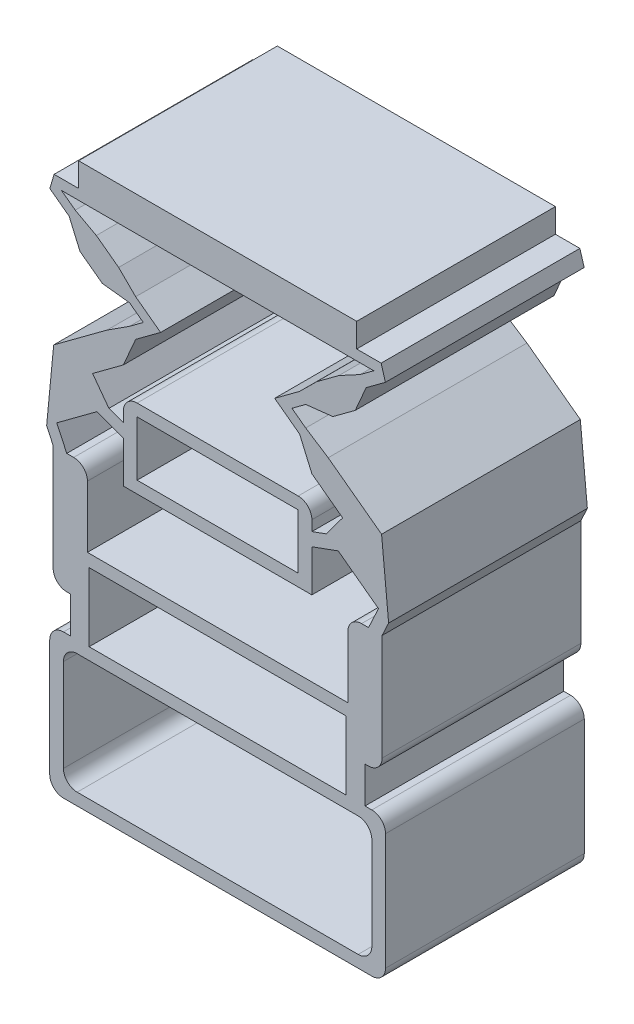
ISO-10303-21;
HEADER;
FILE_DESCRIPTION(('STEP AP214'),'2;1');
FILE_NAME('part.step','',(''),(''),'','','');
FILE_SCHEMA(('AUTOMOTIVE_DESIGN { 1 0 10303 214 1 1 1 1 }'));
ENDSEC;
DATA;
#1=APPLICATION_CONTEXT('core data for automotive mechanical design processes');
#2=APPLICATION_PROTOCOL_DEFINITION('international standard','automotive_design',2000,#1);
#3=PRODUCT_CONTEXT('',#1,'mechanical');
#4=PRODUCT('Part','Part','',(#3));
#5=PRODUCT_RELATED_PRODUCT_CATEGORY('part','',(#4));
#6=PRODUCT_DEFINITION_FORMATION('','',#4);
#7=PRODUCT_DEFINITION_CONTEXT('part definition',#1,'design');
#8=PRODUCT_DEFINITION('design','',#6,#7);
#9=PRODUCT_DEFINITION_SHAPE('','',#8);
#10=(LENGTH_UNIT() NAMED_UNIT(*) SI_UNIT(.MILLI.,.METRE.));
#11=(NAMED_UNIT(*) PLANE_ANGLE_UNIT() SI_UNIT($,.RADIAN.));
#12=(NAMED_UNIT(*) SI_UNIT($,.STERADIAN.) SOLID_ANGLE_UNIT());
#13=UNCERTAINTY_MEASURE_WITH_UNIT(LENGTH_MEASURE(1.E-05),#10,'distance_accuracy_value','');
#14=(GEOMETRIC_REPRESENTATION_CONTEXT(3) GLOBAL_UNCERTAINTY_ASSIGNED_CONTEXT((#13)) GLOBAL_UNIT_ASSIGNED_CONTEXT((#10,
#11,#12)) REPRESENTATION_CONTEXT('',''));
#15=CARTESIAN_POINT('',(0.,0.,0.));
#16=DIRECTION('',(0.,0.,1.));
#17=DIRECTION('',(1.,0.,0.));
#18=AXIS2_PLACEMENT_3D('',#15,#16,#17);
#19=CARTESIAN_POINT('',(-3.8,-1.36,-7.60000657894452));
#20=DIRECTION('',(0.,-1.,0.));
#21=DIRECTION('',(0.,0.,-1.));
#22=AXIS2_PLACEMENT_3D('',#19,#20,#21);
#23=PLANE('',#22);
#24=DIRECTION('',(0.,0.,1.));
#25=VECTOR('',#24,1.);
#26=CARTESIAN_POINT('',(-4.1,-1.36,-7.60000657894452));
#27=LINE('',#26,#25);
#28=CARTESIAN_POINT('',(-4.1,-1.36,5.8));
#29=VERTEX_POINT('',#28);
#30=CARTESIAN_POINT('',(-4.1,-1.36,0.3));
#31=VERTEX_POINT('',#30);
#32=EDGE_CURVE('E1412',#29,#31,#27,.F.);
#33=ORIENTED_EDGE('',*,*,#32,.T.);
#34=DIRECTION('',(1.,0.,0.));
#35=VECTOR('',#34,1.);
#36=CARTESIAN_POINT('',(-3.8,-1.36,0.3));
#37=LINE('',#36,#35);
#38=CARTESIAN_POINT('',(4.1,-1.36,0.3));
#39=VERTEX_POINT('',#38);
#40=EDGE_CURVE('E719',#31,#39,#37,.T.);
#41=ORIENTED_EDGE('',*,*,#40,.T.);
#42=DIRECTION('',(0.,0.,1.));
#43=VECTOR('',#42,1.);
#44=CARTESIAN_POINT('',(4.1,-1.36,-7.60000657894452));
#45=LINE('',#44,#43);
#46=CARTESIAN_POINT('',(4.1,-1.36,5.8));
#47=VERTEX_POINT('',#46);
#48=EDGE_CURVE('E1410',#39,#47,#45,.T.);
#49=ORIENTED_EDGE('',*,*,#48,.T.);
#50=DIRECTION('',(1.,0.,0.));
#51=VECTOR('',#50,1.);
#52=CARTESIAN_POINT('',(-3.8,-1.36,5.8));
#53=LINE('',#52,#51);
#54=EDGE_CURVE('E1088',#29,#47,#53,.T.);
#55=ORIENTED_EDGE('',*,*,#54,.F.);
#56=EDGE_LOOP('',(#33,#41,#49,#55));
#57=FACE_BOUND('',#56,.T.);
#58=ADVANCED_FACE('F37',(#57),#23,.T.);
#59=CARTESIAN_POINT('',(-4.5,-4.86,-10.6620823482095));
#60=DIRECTION('',(-1.,0.,0.));
#61=DIRECTION('',(0.,0.,1.));
#62=AXIS2_PLACEMENT_3D('',#59,#60,#61);
#63=PLANE('',#62);
#64=DIRECTION('',(0.,-1.,0.));
#65=VECTOR('',#64,1.);
#66=CARTESIAN_POINT('',(-4.5,-4.86,0.3));
#67=LINE('',#66,#65);
#68=CARTESIAN_POINT('',(-4.5,-1.76,0.3));
#69=VERTEX_POINT('',#68);
#70=CARTESIAN_POINT('',(-4.5,-4.46,0.3));
#71=VERTEX_POINT('',#70);
#72=EDGE_CURVE('E707',#69,#71,#67,.T.);
#73=ORIENTED_EDGE('',*,*,#72,.F.);
#74=DIRECTION('',(0.,0.,1.));
#75=VECTOR('',#74,1.);
#76=CARTESIAN_POINT('',(-4.5,-1.76,-10.6620823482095));
#77=LINE('',#76,#75);
#78=CARTESIAN_POINT('',(-4.5,-1.76,5.8));
#79=VERTEX_POINT('',#78);
#80=EDGE_CURVE('E1408',#69,#79,#77,.T.);
#81=ORIENTED_EDGE('',*,*,#80,.T.);
#82=DIRECTION('',(0.,-1.,0.));
#83=VECTOR('',#82,1.);
#84=CARTESIAN_POINT('',(-4.5,-4.86,5.8));
#85=LINE('',#84,#83);
#86=CARTESIAN_POINT('',(-4.5,-4.46,5.8));
#87=VERTEX_POINT('',#86);
#88=EDGE_CURVE('E742',#79,#87,#85,.T.);
#89=ORIENTED_EDGE('',*,*,#88,.T.);
#90=DIRECTION('',(0.,0.,1.));
#91=VECTOR('',#90,1.);
#92=CARTESIAN_POINT('',(-4.5,-4.46,0.));
#93=LINE('',#92,#91);
#94=EDGE_CURVE('E1405',#87,#71,#93,.F.);
#95=ORIENTED_EDGE('',*,*,#94,.T.);
#96=EDGE_LOOP('',(#73,#81,#89,#95));
#97=FACE_BOUND('',#96,.T.);
#98=ADVANCED_FACE('F1536',(#97),#63,.F.);
#99=CARTESIAN_POINT('',(4.5,-1.36,-10.6620823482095));
#100=DIRECTION('',(1.,0.,0.));
#101=DIRECTION('',(0.,1.,0.));
#102=AXIS2_PLACEMENT_3D('',#99,#100,#101);
#103=PLANE('',#102);
#104=DIRECTION('',(0.,1.,0.));
#105=VECTOR('',#104,1.);
#106=CARTESIAN_POINT('',(4.5,-1.36,0.3));
#107=LINE('',#106,#105);
#108=CARTESIAN_POINT('',(4.5,-4.46,0.3));
#109=VERTEX_POINT('',#108);
#110=CARTESIAN_POINT('',(4.5,-1.76,0.3));
#111=VERTEX_POINT('',#110);
#112=EDGE_CURVE('E716',#109,#111,#107,.T.);
#113=ORIENTED_EDGE('',*,*,#112,.F.);
#114=DIRECTION('',(0.,0.,1.));
#115=VECTOR('',#114,1.);
#116=CARTESIAN_POINT('',(4.5,-4.46,5.8));
#117=LINE('',#116,#115);
#118=CARTESIAN_POINT('',(4.5,-4.46,5.8));
#119=VERTEX_POINT('',#118);
#120=EDGE_CURVE('E1415',#109,#119,#117,.T.);
#121=ORIENTED_EDGE('',*,*,#120,.T.);
#122=DIRECTION('',(0.,1.,0.));
#123=VECTOR('',#122,1.);
#124=CARTESIAN_POINT('',(4.5,-1.36,5.8));
#125=LINE('',#124,#123);
#126=CARTESIAN_POINT('',(4.5,-1.76,5.8));
#127=VERTEX_POINT('',#126);
#128=EDGE_CURVE('E739',#119,#127,#125,.T.);
#129=ORIENTED_EDGE('',*,*,#128,.T.);
#130=DIRECTION('',(0.,0.,1.));
#131=VECTOR('',#130,1.);
#132=CARTESIAN_POINT('',(4.5,-1.76,-10.6620823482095));
#133=LINE('',#132,#131);
#134=EDGE_CURVE('E1417',#127,#111,#133,.F.);
#135=ORIENTED_EDGE('',*,*,#134,.T.);
#136=EDGE_LOOP('',(#113,#121,#129,#135));
#137=FACE_BOUND('',#136,.T.);
#138=ADVANCED_FACE('F1542',(#137),#103,.F.);
#139=CARTESIAN_POINT('',(4.5,-4.86,-10.6620823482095));
#140=DIRECTION('',(0.,-1.,0.));
#141=DIRECTION('',(0.,0.,-1.));
#142=AXIS2_PLACEMENT_3D('',#139,#140,#141);
#143=PLANE('',#142);
#144=DIRECTION('',(1.,0.,0.));
#145=VECTOR('',#144,1.);
#146=CARTESIAN_POINT('',(4.5,-4.86,0.3));
#147=LINE('',#146,#145);
#148=CARTESIAN_POINT('',(-4.1,-4.86,0.3));
#149=VERTEX_POINT('',#148);
#150=CARTESIAN_POINT('',(4.1,-4.86,0.3));
#151=VERTEX_POINT('',#150);
#152=EDGE_CURVE('E703',#149,#151,#147,.T.);
#153=ORIENTED_EDGE('',*,*,#152,.F.);
#154=DIRECTION('',(0.,0.,1.));
#155=VECTOR('',#154,1.);
#156=CARTESIAN_POINT('',(-4.1,-4.86,5.8));
#157=LINE('',#156,#155);
#158=CARTESIAN_POINT('',(-4.1,-4.86,5.8));
#159=VERTEX_POINT('',#158);
#160=EDGE_CURVE('E1420',#149,#159,#157,.T.);
#161=ORIENTED_EDGE('',*,*,#160,.T.);
#162=DIRECTION('',(1.,0.,0.));
#163=VECTOR('',#162,1.);
#164=CARTESIAN_POINT('',(4.5,-4.86,5.8));
#165=LINE('',#164,#163);
#166=CARTESIAN_POINT('',(4.1,-4.86,5.8));
#167=VERTEX_POINT('',#166);
#168=EDGE_CURVE('E738',#159,#167,#165,.T.);
#169=ORIENTED_EDGE('',*,*,#168,.T.);
#170=DIRECTION('',(0.,0.,1.));
#171=VECTOR('',#170,1.);
#172=CARTESIAN_POINT('',(4.1,-4.86,0.));
#173=LINE('',#172,#171);
#174=EDGE_CURVE('E1422',#167,#151,#173,.F.);
#175=ORIENTED_EDGE('',*,*,#174,.T.);
#176=EDGE_LOOP('',(#153,#161,#169,#175));
#177=FACE_BOUND('',#176,.T.);
#178=ADVANCED_FACE('F2553',(#177),#143,.F.);
#179=CARTESIAN_POINT('',(-4.1,-1.76,-10.6620823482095));
#180=DIRECTION('',(0.,0.,1.));
#181=DIRECTION('',(1.,0.,0.));
#182=AXIS2_PLACEMENT_3D('',#179,#180,#181);
#183=CYLINDRICAL_SURFACE('',#182,0.4);
#184=CARTESIAN_POINT('',(-4.1,-1.76,0.3));
#185=DIRECTION('',(0.,0.,-1.));
#186=DIRECTION('',(-1.,0.,0.));
#187=AXIS2_PLACEMENT_3D('',#184,#185,#186);
#188=CIRCLE('',#187,0.4);
#189=EDGE_CURVE('E713',#31,#69,#188,.F.);
#190=ORIENTED_EDGE('',*,*,#189,.F.);
#191=ORIENTED_EDGE('',*,*,#32,.F.);
#192=CARTESIAN_POINT('',(-4.1,-1.76,5.8));
#193=DIRECTION('',(0.,0.,-1.));
#194=DIRECTION('',(-1.,0.,0.));
#195=AXIS2_PLACEMENT_3D('',#192,#193,#194);
#196=CIRCLE('',#195,0.4);
#197=EDGE_CURVE('E1430',#79,#29,#196,.T.);
#198=ORIENTED_EDGE('',*,*,#197,.F.);
#199=ORIENTED_EDGE('',*,*,#80,.F.);
#200=EDGE_LOOP('',(#190,#191,#198,#199));
#201=FACE_BOUND('',#200,.T.);
#202=ADVANCED_FACE('F2544',(#201),#183,.F.);
#203=CARTESIAN_POINT('',(4.1,-1.76,-7.60000657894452));
#204=DIRECTION('',(0.,0.,1.));
#205=DIRECTION('',(1.,0.,0.));
#206=AXIS2_PLACEMENT_3D('',#203,#204,#205);
#207=CYLINDRICAL_SURFACE('',#206,0.4);
#208=CARTESIAN_POINT('',(4.1,-1.76,0.3));
#209=DIRECTION('',(0.,0.,-1.));
#210=DIRECTION('',(-1.,0.,0.));
#211=AXIS2_PLACEMENT_3D('',#208,#209,#210);
#212=CIRCLE('',#211,0.4);
#213=EDGE_CURVE('E721',#111,#39,#212,.F.);
#214=ORIENTED_EDGE('',*,*,#213,.F.);
#215=ORIENTED_EDGE('',*,*,#134,.F.);
#216=CARTESIAN_POINT('',(4.1,-1.76,5.8));
#217=DIRECTION('',(0.,0.,-1.));
#218=DIRECTION('',(-1.,0.,0.));
#219=AXIS2_PLACEMENT_3D('',#216,#217,#218);
#220=CIRCLE('',#219,0.4);
#221=EDGE_CURVE('E1432',#47,#127,#220,.T.);
#222=ORIENTED_EDGE('',*,*,#221,.F.);
#223=ORIENTED_EDGE('',*,*,#48,.F.);
#224=EDGE_LOOP('',(#214,#215,#222,#223));
#225=FACE_BOUND('',#224,.T.);
#226=ADVANCED_FACE('F2535',(#225),#207,.F.);
#227=CARTESIAN_POINT('',(4.1,-4.46,-10.6620823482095));
#228=DIRECTION('',(0.,0.,-1.));
#229=DIRECTION('',(-1.,0.,0.));
#230=AXIS2_PLACEMENT_3D('',#227,#228,#229);
#231=CYLINDRICAL_SURFACE('',#230,0.4);
#232=CARTESIAN_POINT('',(4.1,-4.46,0.3));
#233=DIRECTION('',(0.,0.,-1.));
#234=DIRECTION('',(-1.,0.,0.));
#235=AXIS2_PLACEMENT_3D('',#232,#233,#234);
#236=CIRCLE('',#235,0.4);
#237=EDGE_CURVE('E710',#151,#109,#236,.F.);
#238=ORIENTED_EDGE('',*,*,#237,.F.);
#239=ORIENTED_EDGE('',*,*,#174,.F.);
#240=CARTESIAN_POINT('',(4.1,-4.46,5.8));
#241=DIRECTION('',(0.,0.,-1.));
#242=DIRECTION('',(-1.,0.,0.));
#243=AXIS2_PLACEMENT_3D('',#240,#241,#242);
#244=CIRCLE('',#243,0.4);
#245=EDGE_CURVE('E1434',#119,#167,#244,.T.);
#246=ORIENTED_EDGE('',*,*,#245,.F.);
#247=ORIENTED_EDGE('',*,*,#120,.F.);
#248=EDGE_LOOP('',(#238,#239,#246,#247));
#249=FACE_BOUND('',#248,.T.);
#250=ADVANCED_FACE('F2526',(#249),#231,.F.);
#251=CARTESIAN_POINT('',(-4.1,-4.46,-10.6620823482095));
#252=DIRECTION('',(0.,0.,-1.));
#253=DIRECTION('',(-1.,0.,0.));
#254=AXIS2_PLACEMENT_3D('',#251,#252,#253);
#255=CYLINDRICAL_SURFACE('',#254,0.4);
#256=CARTESIAN_POINT('',(-4.1,-4.46,0.3));
#257=DIRECTION('',(0.,0.,-1.));
#258=DIRECTION('',(-1.,0.,0.));
#259=AXIS2_PLACEMENT_3D('',#256,#257,#258);
#260=CIRCLE('',#259,0.4);
#261=EDGE_CURVE('E11',#71,#149,#260,.F.);
#262=ORIENTED_EDGE('',*,*,#261,.F.);
#263=ORIENTED_EDGE('',*,*,#94,.F.);
#264=CARTESIAN_POINT('',(-4.1,-4.46,5.8));
#265=DIRECTION('',(0.,0.,-1.));
#266=DIRECTION('',(-1.,0.,0.));
#267=AXIS2_PLACEMENT_3D('',#264,#265,#266);
#268=CIRCLE('',#267,0.4);
#269=EDGE_CURVE('E1436',#159,#87,#268,.T.);
#270=ORIENTED_EDGE('',*,*,#269,.F.);
#271=ORIENTED_EDGE('',*,*,#160,.F.);
#272=EDGE_LOOP('',(#262,#263,#270,#271));
#273=FACE_BOUND('',#272,.T.);
#274=ADVANCED_FACE('F2297',(#273),#255,.F.);
#275=CARTESIAN_POINT('',(3.8,1.35,5.8));
#276=DIRECTION('',(1.,0.,0.));
#277=DIRECTION('',(0.,0.,-1.));
#278=AXIS2_PLACEMENT_3D('',#275,#276,#277);
#279=PLANE('',#278);
#280=DIRECTION('',(0.,-1.,0.));
#281=VECTOR('',#280,1.);
#282=CARTESIAN_POINT('',(3.8,1.35,5.8));
#283=LINE('',#282,#281);
#284=CARTESIAN_POINT('',(3.8,3.15,5.8));
#285=VERTEX_POINT('',#284);
#286=CARTESIAN_POINT('',(3.8,1.35,5.8));
#287=VERTEX_POINT('',#286);
#288=EDGE_CURVE('E1238',#285,#287,#283,.T.);
#289=ORIENTED_EDGE('',*,*,#288,.F.);
#290=DIRECTION('',(0.,0.,-1.));
#291=VECTOR('',#290,1.);
#292=CARTESIAN_POINT('',(3.8,3.15,5.8));
#293=LINE('',#292,#291);
#294=CARTESIAN_POINT('',(3.8,3.15,0.));
#295=VERTEX_POINT('',#294);
#296=EDGE_CURVE('E1451',#285,#295,#293,.T.);
#297=ORIENTED_EDGE('',*,*,#296,.T.);
#298=DIRECTION('',(0.,-1.,0.));
#299=VECTOR('',#298,1.);
#300=CARTESIAN_POINT('',(3.8,1.35,0.));
#301=LINE('',#300,#299);
#302=CARTESIAN_POINT('',(3.8,1.35,0.));
#303=VERTEX_POINT('',#302);
#304=EDGE_CURVE('E1237',#295,#303,#301,.T.);
#305=ORIENTED_EDGE('',*,*,#304,.T.);
#306=DIRECTION('',(0.,0.,-1.));
#307=VECTOR('',#306,1.);
#308=CARTESIAN_POINT('',(3.8,1.35,5.8));
#309=LINE('',#308,#307);
#310=EDGE_CURVE('E1332',#287,#303,#309,.T.);
#311=ORIENTED_EDGE('',*,*,#310,.F.);
#312=EDGE_LOOP('',(#289,#297,#305,#311));
#313=FACE_BOUND('',#312,.T.);
#314=ADVANCED_FACE('F1469',(#313),#279,.F.);
#315=CARTESIAN_POINT('',(-3.8,1.35,5.8));
#316=DIRECTION('',(0.,-1.,0.));
#317=DIRECTION('',(1.,0.,0.));
#318=AXIS2_PLACEMENT_3D('',#315,#316,#317);
#319=PLANE('',#318);
#320=DIRECTION('',(-1.,0.,0.));
#321=VECTOR('',#320,1.);
#322=CARTESIAN_POINT('',(-3.8,1.35,0.));
#323=LINE('',#322,#321);
#324=CARTESIAN_POINT('',(-3.8,1.35,0.));
#325=VERTEX_POINT('',#324);
#326=EDGE_CURVE('E1271',#303,#325,#323,.T.);
#327=ORIENTED_EDGE('',*,*,#326,.T.);
#328=DIRECTION('',(0.,0.,-1.));
#329=VECTOR('',#328,1.);
#330=CARTESIAN_POINT('',(-3.8,1.35,5.8));
#331=LINE('',#330,#329);
#332=CARTESIAN_POINT('',(-3.8,1.35,5.8));
#333=VERTEX_POINT('',#332);
#334=EDGE_CURVE('E1329',#333,#325,#331,.T.);
#335=ORIENTED_EDGE('',*,*,#334,.F.);
#336=DIRECTION('',(-1.,0.,0.));
#337=VECTOR('',#336,1.);
#338=CARTESIAN_POINT('',(-3.8,1.35,5.8));
#339=LINE('',#338,#337);
#340=EDGE_CURVE('E1240',#287,#333,#339,.T.);
#341=ORIENTED_EDGE('',*,*,#340,.F.);
#342=ORIENTED_EDGE('',*,*,#310,.T.);
#343=EDGE_LOOP('',(#327,#335,#341,#342));
#344=FACE_BOUND('',#343,.T.);
#345=ADVANCED_FACE('F1477',(#344),#319,.F.);
#346=CARTESIAN_POINT('',(3.8,0.0500000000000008,5.8));
#347=DIRECTION('',(0.,1.,0.));
#348=DIRECTION('',(0.,0.,1.));
#349=AXIS2_PLACEMENT_3D('',#346,#347,#348);
#350=PLANE('',#349);
#351=DIRECTION('',(1.,0.,0.));
#352=VECTOR('',#351,1.);
#353=CARTESIAN_POINT('',(3.8,0.0500000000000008,5.8));
#354=LINE('',#353,#352);
#355=CARTESIAN_POINT('',(4.3,0.0500000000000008,5.8));
#356=VERTEX_POINT('',#355);
#357=CARTESIAN_POINT('',(4.4,0.0500000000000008,5.8));
#358=VERTEX_POINT('',#357);
#359=EDGE_CURVE('E52',#356,#358,#354,.T.);
#360=ORIENTED_EDGE('',*,*,#359,.F.);
#361=DIRECTION('',(0.,0.,1.));
#362=VECTOR('',#361,1.);
#363=CARTESIAN_POINT('',(4.3,0.0500000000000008,-1.17200682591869));
#364=LINE('',#363,#362);
#365=CARTESIAN_POINT('',(4.3,0.0500000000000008,0.));
#366=VERTEX_POINT('',#365);
#367=EDGE_CURVE('E56',#366,#356,#364,.T.);
#368=ORIENTED_EDGE('',*,*,#367,.F.);
#369=DIRECTION('',(1.,0.,0.));
#370=VECTOR('',#369,1.);
#371=CARTESIAN_POINT('',(3.8,0.0500000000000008,0.));
#372=LINE('',#371,#370);
#373=CARTESIAN_POINT('',(4.4,0.0500000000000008,0.));
#374=VERTEX_POINT('',#373);
#375=EDGE_CURVE('E682',#366,#374,#372,.T.);
#376=ORIENTED_EDGE('',*,*,#375,.T.);
#377=DIRECTION('',(0.,0.,-1.));
#378=VECTOR('',#377,1.);
#379=CARTESIAN_POINT('',(4.4,0.0500000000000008,5.8));
#380=LINE('',#379,#378);
#381=EDGE_CURVE('E1371',#374,#358,#380,.F.);
#382=ORIENTED_EDGE('',*,*,#381,.T.);
#383=EDGE_LOOP('',(#360,#368,#376,#382));
#384=FACE_BOUND('',#383,.T.);
#385=ADVANCED_FACE('F2215',(#384),#350,.F.);
#386=CARTESIAN_POINT('',(4.8,3.55,5.8));
#387=DIRECTION('',(-1.,0.,0.));
#388=DIRECTION('',(0.,-1.,0.));
#389=AXIS2_PLACEMENT_3D('',#386,#387,#388);
#390=PLANE('',#389);
#391=DIRECTION('',(0.,1.,0.));
#392=VECTOR('',#391,1.);
#393=CARTESIAN_POINT('',(4.8,3.55,5.8));
#394=LINE('',#393,#392);
#395=CARTESIAN_POINT('',(4.8,0.450000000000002,5.8));
#396=VERTEX_POINT('',#395);
#397=CARTESIAN_POINT('',(4.8,3.55,5.8));
#398=VERTEX_POINT('',#397);
#399=EDGE_CURVE('E1245',#396,#398,#394,.T.);
#400=ORIENTED_EDGE('',*,*,#399,.F.);
#401=DIRECTION('',(0.,0.,-1.));
#402=VECTOR('',#401,1.);
#403=CARTESIAN_POINT('',(4.8,0.450000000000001,5.8));
#404=LINE('',#403,#402);
#405=CARTESIAN_POINT('',(4.8,0.450000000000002,0.));
#406=VERTEX_POINT('',#405);
#407=EDGE_CURVE('E1355',#396,#406,#404,.T.);
#408=ORIENTED_EDGE('',*,*,#407,.T.);
#409=DIRECTION('',(0.,1.,0.));
#410=VECTOR('',#409,1.);
#411=CARTESIAN_POINT('',(4.8,3.55,0.));
#412=LINE('',#411,#410);
#413=CARTESIAN_POINT('',(4.8,3.55,0.));
#414=VERTEX_POINT('',#413);
#415=EDGE_CURVE('E1275',#406,#414,#412,.T.);
#416=ORIENTED_EDGE('',*,*,#415,.T.);
#417=DIRECTION('',(0.,0.,-1.));
#418=VECTOR('',#417,1.);
#419=CARTESIAN_POINT('',(4.8,3.55,5.8));
#420=LINE('',#419,#418);
#421=EDGE_CURVE('E1326',#398,#414,#420,.T.);
#422=ORIENTED_EDGE('',*,*,#421,.F.);
#423=EDGE_LOOP('',(#400,#408,#416,#422));
#424=FACE_BOUND('',#423,.T.);
#425=ADVANCED_FACE('F2219',(#424),#390,.F.);
#426=CARTESIAN_POINT('',(4.8,3.55,5.8));
#427=DIRECTION('',(-0.906307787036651,0.422618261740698,0.));
#428=DIRECTION('',(-0.422618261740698,-0.906307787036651,0.));
#429=AXIS2_PLACEMENT_3D('',#426,#427,#428);
#430=PLANE('',#429);
#431=DIRECTION('',(0.422618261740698,0.906307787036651,0.));
#432=VECTOR('',#431,1.);
#433=CARTESIAN_POINT('',(4.8,3.55,0.));
#434=LINE('',#433,#432);
#435=CARTESIAN_POINT('',(4.99017821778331,3.95783850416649,0.));
#436=VERTEX_POINT('',#435);
#437=EDGE_CURVE('E1277',#414,#436,#434,.T.);
#438=ORIENTED_EDGE('',*,*,#437,.T.);
#439=DIRECTION('',(0.,0.,-1.));
#440=VECTOR('',#439,1.);
#441=CARTESIAN_POINT('',(4.99017821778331,3.95783850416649,5.8));
#442=LINE('',#441,#440);
#443=CARTESIAN_POINT('',(4.99017821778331,3.95783850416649,5.8));
#444=VERTEX_POINT('',#443);
#445=EDGE_CURVE('E1324',#444,#436,#442,.T.);
#446=ORIENTED_EDGE('',*,*,#445,.F.);
#447=DIRECTION('',(0.422618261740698,0.906307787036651,0.));
#448=VECTOR('',#447,1.);
#449=CARTESIAN_POINT('',(4.8,3.55,5.8));
#450=LINE('',#449,#448);
#451=EDGE_CURVE('E1247',#398,#444,#450,.T.);
#452=ORIENTED_EDGE('',*,*,#451,.F.);
#453=ORIENTED_EDGE('',*,*,#421,.T.);
#454=EDGE_LOOP('',(#438,#446,#452,#453));
#455=FACE_BOUND('',#454,.T.);
#456=ADVANCED_FACE('F2233',(#455),#430,.F.);
#457=CARTESIAN_POINT('',(4.00614433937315,6.42891573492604,5.8));
#458=DIRECTION('',(0.80357619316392,-0.595201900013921,0.));
#459=DIRECTION('',(0.595201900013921,0.80357619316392,0.));
#460=AXIS2_PLACEMENT_3D('',#457,#458,#459);
#461=PLANE('',#460);
#462=DIRECTION('',(-0.595201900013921,-0.80357619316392,0.));
#463=VECTOR('',#462,1.);
#464=CARTESIAN_POINT('',(4.00614433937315,6.42891573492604,5.8));
#465=LINE('',#464,#463);
#466=CARTESIAN_POINT('',(3.6490231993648,5.94677001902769,5.8));
#467=VERTEX_POINT('',#466);
#468=CARTESIAN_POINT('',(3.17286167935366,5.30390906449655,5.8));
#469=VERTEX_POINT('',#468);
#470=EDGE_CURVE('E1250',#467,#469,#465,.T.);
#471=ORIENTED_EDGE('',*,*,#470,.F.);
#472=DIRECTION('',(0.,0.,1.));
#473=VECTOR('',#472,1.);
#474=CARTESIAN_POINT('',(3.6490231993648,5.94677001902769,-11.1294123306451));
#475=LINE('',#474,#473);
#476=CARTESIAN_POINT('',(3.6490231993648,5.94677001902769,0.));
#477=VERTEX_POINT('',#476);
#478=EDGE_CURVE('E972',#477,#467,#475,.T.);
#479=ORIENTED_EDGE('',*,*,#478,.F.);
#480=DIRECTION('',(-0.595201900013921,-0.80357619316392,0.));
#481=VECTOR('',#480,1.);
#482=CARTESIAN_POINT('',(4.00614433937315,6.42891573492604,0.));
#483=LINE('',#482,#481);
#484=CARTESIAN_POINT('',(3.17286167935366,5.30390906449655,0.));
#485=VERTEX_POINT('',#484);
#486=EDGE_CURVE('E1280',#477,#485,#483,.T.);
#487=ORIENTED_EDGE('',*,*,#486,.T.);
#488=DIRECTION('',(0.,0.,-1.));
#489=VECTOR('',#488,1.);
#490=CARTESIAN_POINT('',(3.17286167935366,5.30390906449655,5.8));
#491=LINE('',#490,#489);
#492=EDGE_CURVE('E1321',#469,#485,#491,.T.);
#493=ORIENTED_EDGE('',*,*,#492,.F.);
#494=EDGE_LOOP('',(#471,#479,#487,#493));
#495=FACE_BOUND('',#494,.T.);
#496=ADVANCED_FACE('F2239',(#495),#461,.F.);
#497=CARTESIAN_POINT('',(2.75,5.15,5.8));
#498=DIRECTION('',(0.342020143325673,-0.939692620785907,0.));
#499=DIRECTION('',(0.939692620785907,0.342020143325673,0.));
#500=AXIS2_PLACEMENT_3D('',#497,#498,#499);
#501=PLANE('',#500);
#502=DIRECTION('',(-0.939692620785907,-0.342020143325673,0.));
#503=VECTOR('',#502,1.);
#504=CARTESIAN_POINT('',(2.75,5.15,0.));
#505=LINE('',#504,#503);
#506=CARTESIAN_POINT('',(2.75,5.15,0.));
#507=VERTEX_POINT('',#506);
#508=EDGE_CURVE('E1282',#485,#507,#505,.T.);
#509=ORIENTED_EDGE('',*,*,#508,.T.);
#510=DIRECTION('',(0.,0.,-1.));
#511=VECTOR('',#510,1.);
#512=CARTESIAN_POINT('',(2.75,5.15,5.8));
#513=LINE('',#512,#511);
#514=CARTESIAN_POINT('',(2.75,5.15,5.8));
#515=VERTEX_POINT('',#514);
#516=EDGE_CURVE('E1318',#515,#507,#513,.T.);
#517=ORIENTED_EDGE('',*,*,#516,.F.);
#518=DIRECTION('',(-0.939692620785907,-0.342020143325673,0.));
#519=VECTOR('',#518,1.);
#520=CARTESIAN_POINT('',(2.75,5.15,5.8));
#521=LINE('',#520,#519);
#522=EDGE_CURVE('E1252',#469,#515,#521,.T.);
#523=ORIENTED_EDGE('',*,*,#522,.F.);
#524=ORIENTED_EDGE('',*,*,#492,.T.);
#525=EDGE_LOOP('',(#509,#517,#523,#524));
#526=FACE_BOUND('',#525,.T.);
#527=ADVANCED_FACE('F2246',(#526),#501,.F.);
#528=CARTESIAN_POINT('',(-2.75,5.15,5.8));
#529=DIRECTION('',(1.,0.,0.));
#530=DIRECTION('',(0.,0.,-1.));
#531=AXIS2_PLACEMENT_3D('',#528,#529,#530);
#532=PLANE('',#531);
#533=DIRECTION('',(0.,-1.,0.));
#534=VECTOR('',#533,1.);
#535=CARTESIAN_POINT('',(-2.75,5.15,5.8));
#536=LINE('',#535,#534);
#537=CARTESIAN_POINT('',(-2.75,4.76689600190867,5.8));
#538=VERTEX_POINT('',#537);
#539=CARTESIAN_POINT('',(-2.75,3.55,5.8));
#540=VERTEX_POINT('',#539);
#541=EDGE_CURVE('E1254',#538,#540,#536,.T.);
#542=ORIENTED_EDGE('',*,*,#541,.F.);
#543=DIRECTION('',(0.,0.,-1.));
#544=VECTOR('',#543,1.);
#545=CARTESIAN_POINT('',(-2.75,4.76689600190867,5.8));
#546=LINE('',#545,#544);
#547=CARTESIAN_POINT('',(-2.75,4.76689600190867,0.));
#548=VERTEX_POINT('',#547);
#549=EDGE_CURVE('E1228',#538,#548,#546,.T.);
#550=ORIENTED_EDGE('',*,*,#549,.T.);
#551=DIRECTION('',(0.,-1.,0.));
#552=VECTOR('',#551,1.);
#553=CARTESIAN_POINT('',(-2.75,5.15,0.));
#554=LINE('',#553,#552);
#555=CARTESIAN_POINT('',(-2.75,3.55,0.));
#556=VERTEX_POINT('',#555);
#557=EDGE_CURVE('E1284',#548,#556,#554,.T.);
#558=ORIENTED_EDGE('',*,*,#557,.T.);
#559=DIRECTION('',(0.,0.,-1.));
#560=VECTOR('',#559,1.);
#561=CARTESIAN_POINT('',(-2.75,3.55,5.8));
#562=LINE('',#561,#560);
#563=EDGE_CURVE('E1312',#540,#556,#562,.T.);
#564=ORIENTED_EDGE('',*,*,#563,.F.);
#565=EDGE_LOOP('',(#542,#550,#558,#564));
#566=FACE_BOUND('',#565,.T.);
#567=ADVANCED_FACE('F1505',(#566),#532,.F.);
#568=CARTESIAN_POINT('',(-2.75,3.55,5.8));
#569=DIRECTION('',(0.,1.,0.));
#570=DIRECTION('',(-1.,0.,0.));
#571=AXIS2_PLACEMENT_3D('',#568,#569,#570);
#572=PLANE('',#571);
#573=DIRECTION('',(1.,0.,0.));
#574=VECTOR('',#573,1.);
#575=CARTESIAN_POINT('',(-2.75,3.55,0.));
#576=LINE('',#575,#574);
#577=CARTESIAN_POINT('',(2.75,3.55,0.));
#578=VERTEX_POINT('',#577);
#579=EDGE_CURVE('E1286',#556,#578,#576,.T.);
#580=ORIENTED_EDGE('',*,*,#579,.T.);
#581=DIRECTION('',(0.,0.,-1.));
#582=VECTOR('',#581,1.);
#583=CARTESIAN_POINT('',(2.75,3.55,5.8));
#584=LINE('',#583,#582);
#585=CARTESIAN_POINT('',(2.75,3.55,5.8));
#586=VERTEX_POINT('',#585);
#587=EDGE_CURVE('E1309',#586,#578,#584,.T.);
#588=ORIENTED_EDGE('',*,*,#587,.F.);
#589=DIRECTION('',(1.,0.,0.));
#590=VECTOR('',#589,1.);
#591=CARTESIAN_POINT('',(-2.75,3.55,5.8));
#592=LINE('',#591,#590);
#593=EDGE_CURVE('E1256',#540,#586,#592,.T.);
#594=ORIENTED_EDGE('',*,*,#593,.F.);
#595=ORIENTED_EDGE('',*,*,#563,.T.);
#596=EDGE_LOOP('',(#580,#588,#594,#595));
#597=FACE_BOUND('',#596,.T.);
#598=ADVANCED_FACE('F1508',(#597),#572,.F.);
#599=CARTESIAN_POINT('',(2.75,4.76689600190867,5.8));
#600=DIRECTION('',(-1.,0.,0.));
#601=DIRECTION('',(0.,0.,1.));
#602=AXIS2_PLACEMENT_3D('',#599,#600,#601);
#603=PLANE('',#602);
#604=DIRECTION('',(0.,1.,0.));
#605=VECTOR('',#604,1.);
#606=CARTESIAN_POINT('',(2.75,4.76689600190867,0.));
#607=LINE('',#606,#605);
#608=CARTESIAN_POINT('',(2.75,4.76689600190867,0.));
#609=VERTEX_POINT('',#608);
#610=EDGE_CURVE('E1288',#578,#609,#607,.T.);
#611=ORIENTED_EDGE('',*,*,#610,.T.);
#612=DIRECTION('',(0.,0.,-1.));
#613=VECTOR('',#612,1.);
#614=CARTESIAN_POINT('',(2.75,4.76689600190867,5.8));
#615=LINE('',#614,#613);
#616=CARTESIAN_POINT('',(2.75,4.76689600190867,5.8));
#617=VERTEX_POINT('',#616);
#618=EDGE_CURVE('E1306',#617,#609,#615,.T.);
#619=ORIENTED_EDGE('',*,*,#618,.F.);
#620=DIRECTION('',(0.,1.,0.));
#621=VECTOR('',#620,1.);
#622=CARTESIAN_POINT('',(2.75,4.76689600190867,5.8));
#623=LINE('',#622,#621);
#624=EDGE_CURVE('E1258',#586,#617,#623,.T.);
#625=ORIENTED_EDGE('',*,*,#624,.F.);
#626=ORIENTED_EDGE('',*,*,#587,.T.);
#627=EDGE_LOOP('',(#611,#619,#625,#626));
#628=FACE_BOUND('',#627,.T.);
#629=ADVANCED_FACE('F1513',(#628),#603,.F.);
#630=CARTESIAN_POINT('',(2.75,4.76689600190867,5.8));
#631=DIRECTION('',(-0.342020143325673,0.939692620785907,0.));
#632=DIRECTION('',(-0.939692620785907,-0.342020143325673,0.));
#633=AXIS2_PLACEMENT_3D('',#630,#631,#632);
#634=PLANE('',#633);
#635=DIRECTION('',(0.939692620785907,0.342020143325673,0.));
#636=VECTOR('',#635,1.);
#637=CARTESIAN_POINT('',(2.75,4.76689600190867,0.));
#638=LINE('',#637,#636);
#639=CARTESIAN_POINT('',(3.51966835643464,5.04703237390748,0.));
#640=VERTEX_POINT('',#639);
#641=EDGE_CURVE('E1290',#609,#640,#638,.T.);
#642=ORIENTED_EDGE('',*,*,#641,.T.);
#643=DIRECTION('',(0.,0.,-1.));
#644=VECTOR('',#643,1.);
#645=CARTESIAN_POINT('',(3.51966835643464,5.04703237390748,5.8));
#646=LINE('',#645,#644);
#647=CARTESIAN_POINT('',(3.51966835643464,5.04703237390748,5.8));
#648=VERTEX_POINT('',#647);
#649=EDGE_CURVE('E1303',#648,#640,#646,.T.);
#650=ORIENTED_EDGE('',*,*,#649,.F.);
#651=DIRECTION('',(0.939692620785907,0.342020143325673,0.));
#652=VECTOR('',#651,1.);
#653=CARTESIAN_POINT('',(2.75,4.76689600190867,5.8));
#654=LINE('',#653,#652);
#655=EDGE_CURVE('E1260',#617,#648,#654,.T.);
#656=ORIENTED_EDGE('',*,*,#655,.F.);
#657=ORIENTED_EDGE('',*,*,#618,.T.);
#658=EDGE_LOOP('',(#642,#650,#656,#657));
#659=FACE_BOUND('',#658,.T.);
#660=ADVANCED_FACE('F1519',(#659),#634,.F.);
#661=CARTESIAN_POINT('',(3.51966835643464,5.04703237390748,5.8));
#662=DIRECTION('',(0.595201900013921,0.80357619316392,0.));
#663=DIRECTION('',(-0.80357619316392,0.595201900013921,0.));
#664=AXIS2_PLACEMENT_3D('',#661,#662,#663);
#665=PLANE('',#664);
#666=DIRECTION('',(0.80357619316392,-0.595201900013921,0.));
#667=VECTOR('',#666,1.);
#668=CARTESIAN_POINT('',(3.51966835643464,5.04703237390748,0.));
#669=LINE('',#668,#667);
#670=CARTESIAN_POINT('',(4.6949359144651,4.1765219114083,0.));
#671=VERTEX_POINT('',#670);
#672=EDGE_CURVE('E1292',#640,#671,#669,.T.);
#673=ORIENTED_EDGE('',*,*,#672,.T.);
#674=DIRECTION('',(0.,0.,-1.));
#675=VECTOR('',#674,1.);
#676=CARTESIAN_POINT('',(4.6949359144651,4.1765219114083,5.8));
#677=LINE('',#676,#675);
#678=CARTESIAN_POINT('',(4.6949359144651,4.1765219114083,5.8));
#679=VERTEX_POINT('',#678);
#680=EDGE_CURVE('E1300',#679,#671,#677,.T.);
#681=ORIENTED_EDGE('',*,*,#680,.F.);
#682=DIRECTION('',(0.80357619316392,-0.595201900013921,0.));
#683=VECTOR('',#682,1.);
#684=CARTESIAN_POINT('',(3.51966835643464,5.04703237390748,5.8));
#685=LINE('',#684,#683);
#686=EDGE_CURVE('E1262',#648,#679,#685,.T.);
#687=ORIENTED_EDGE('',*,*,#686,.F.);
#688=ORIENTED_EDGE('',*,*,#649,.T.);
#689=EDGE_LOOP('',(#673,#681,#687,#688));
#690=FACE_BOUND('',#689,.T.);
#691=ADVANCED_FACE('F1523',(#690),#665,.F.);
#692=CARTESIAN_POINT('',(4.4027839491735,3.55,5.8));
#693=DIRECTION('',(0.906307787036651,-0.422618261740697,0.));
#694=DIRECTION('',(0.422618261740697,0.906307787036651,0.));
#695=AXIS2_PLACEMENT_3D('',#692,#693,#694);
#696=PLANE('',#695);
#697=DIRECTION('',(-0.422618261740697,-0.906307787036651,0.));
#698=VECTOR('',#697,1.);
#699=CARTESIAN_POINT('',(4.4027839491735,3.55,0.));
#700=LINE('',#699,#698);
#701=CARTESIAN_POINT('',(4.4027839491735,3.55,0.));
#702=VERTEX_POINT('',#701);
#703=EDGE_CURVE('E1294',#671,#702,#700,.T.);
#704=ORIENTED_EDGE('',*,*,#703,.T.);
#705=DIRECTION('',(0.,0.,-1.));
#706=VECTOR('',#705,1.);
#707=CARTESIAN_POINT('',(4.4027839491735,3.55,5.8));
#708=LINE('',#707,#706);
#709=CARTESIAN_POINT('',(4.4027839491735,3.55,5.8));
#710=VERTEX_POINT('',#709);
#711=EDGE_CURVE('E1269',#710,#702,#708,.T.);
#712=ORIENTED_EDGE('',*,*,#711,.F.);
#713=DIRECTION('',(-0.422618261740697,-0.906307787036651,0.));
#714=VECTOR('',#713,1.);
#715=CARTESIAN_POINT('',(4.4027839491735,3.55,5.8));
#716=LINE('',#715,#714);
#717=EDGE_CURVE('E1264',#679,#710,#716,.T.);
#718=ORIENTED_EDGE('',*,*,#717,.F.);
#719=ORIENTED_EDGE('',*,*,#680,.T.);
#720=EDGE_LOOP('',(#704,#712,#718,#719));
#721=FACE_BOUND('',#720,.T.);
#722=ADVANCED_FACE('F1526',(#721),#696,.F.);
#723=CARTESIAN_POINT('',(3.8,3.55,5.8));
#724=DIRECTION('',(0.,-1.,0.));
#725=DIRECTION('',(0.,0.,-1.));
#726=AXIS2_PLACEMENT_3D('',#723,#724,#725);
#727=PLANE('',#726);
#728=DIRECTION('',(-1.,0.,0.));
#729=VECTOR('',#728,1.);
#730=CARTESIAN_POINT('',(3.8,3.55,0.));
#731=LINE('',#730,#729);
#732=CARTESIAN_POINT('',(4.2,3.55,0.));
#733=VERTEX_POINT('',#732);
#734=EDGE_CURVE('E1241',#702,#733,#731,.T.);
#735=ORIENTED_EDGE('',*,*,#734,.T.);
#736=DIRECTION('',(0.,0.,-1.));
#737=VECTOR('',#736,1.);
#738=CARTESIAN_POINT('',(4.2,3.55,5.8));
#739=LINE('',#738,#737);
#740=CARTESIAN_POINT('',(4.2,3.55,5.8));
#741=VERTEX_POINT('',#740);
#742=EDGE_CURVE('E45',#733,#741,#739,.F.);
#743=ORIENTED_EDGE('',*,*,#742,.T.);
#744=DIRECTION('',(-1.,0.,0.));
#745=VECTOR('',#744,1.);
#746=CARTESIAN_POINT('',(3.8,3.55,5.8));
#747=LINE('',#746,#745);
#748=EDGE_CURVE('E1266',#710,#741,#747,.T.);
#749=ORIENTED_EDGE('',*,*,#748,.F.);
#750=ORIENTED_EDGE('',*,*,#711,.T.);
#751=EDGE_LOOP('',(#735,#743,#749,#750));
#752=FACE_BOUND('',#751,.T.);
#753=ADVANCED_FACE('F1456',(#752),#727,.F.);
#754=CARTESIAN_POINT('',(0.,0.,5.8));
#755=DIRECTION('',(0.,0.,-1.));
#756=DIRECTION('',(-1.,0.,0.));
#757=AXIS2_PLACEMENT_3D('',#754,#755,#756);
#758=PLANE('',#757);
#759=DIRECTION('',(0.,1.,0.));
#760=VECTOR('',#759,1.);
#761=CARTESIAN_POINT('',(4.3,0.0500000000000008,5.8));
#762=LINE('',#761,#760);
#763=CARTESIAN_POINT('',(4.3,-1.01,5.8));
#764=VERTEX_POINT('',#763);
#765=EDGE_CURVE('E688',#764,#356,#762,.T.);
#766=ORIENTED_EDGE('',*,*,#765,.T.);
#767=ORIENTED_EDGE('',*,*,#359,.T.);
#768=CARTESIAN_POINT('',(4.4,0.450000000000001,5.8));
#769=DIRECTION('',(0.,0.,-1.));
#770=DIRECTION('',(-1.,0.,0.));
#771=AXIS2_PLACEMENT_3D('',#768,#769,#770);
#772=CIRCLE('',#771,0.4);
#773=EDGE_CURVE('E1384',#358,#396,#772,.F.);
#774=ORIENTED_EDGE('',*,*,#773,.T.);
#775=ORIENTED_EDGE('',*,*,#399,.T.);
#776=ORIENTED_EDGE('',*,*,#451,.T.);
#777=DIRECTION('',(0.0953762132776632,-0.995441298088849,0.));
#778=VECTOR('',#777,1.);
#779=CARTESIAN_POINT('',(4.81050032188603,5.8331362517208,5.8));
#780=LINE('',#779,#778);
#781=CARTESIAN_POINT('',(4.78483205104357,6.10103592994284,5.8));
#782=VERTEX_POINT('',#781);
#783=EDGE_CURVE('E1104',#782,#444,#780,.T.);
#784=ORIENTED_EDGE('',*,*,#783,.F.);
#785=DIRECTION('',(-0.80357619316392,0.595201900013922,0.));
#786=VECTOR('',#785,1.);
#787=CARTESIAN_POINT('',(4.78483205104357,6.10103592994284,5.8));
#788=LINE('',#787,#786);
#789=CARTESIAN_POINT('',(3.22673541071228,7.25510456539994,5.8));
#790=VERTEX_POINT('',#789);
#791=EDGE_CURVE('E821',#782,#790,#788,.T.);
#792=ORIENTED_EDGE('',*,*,#791,.T.);
#793=DIRECTION('',(-0.840031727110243,0.542537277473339,0.));
#794=VECTOR('',#793,1.);
#795=CARTESIAN_POINT('',(3.22673541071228,7.25510456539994,5.8));
#796=LINE('',#795,#794);
#797=CARTESIAN_POINT('',(2.57064965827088,7.67883972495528,5.8));
#798=VERTEX_POINT('',#797);
#799=EDGE_CURVE('E818',#790,#798,#796,.T.);
#800=ORIENTED_EDGE('',*,*,#799,.T.);
#801=DIRECTION('',(-0.80357619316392,0.595201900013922,0.));
#802=VECTOR('',#801,1.);
#803=CARTESIAN_POINT('',(2.57064965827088,7.67883972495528,5.8));
#804=LINE('',#803,#802);
#805=CARTESIAN_POINT('',(2.16886156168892,7.97644067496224,5.8));
#806=VERTEX_POINT('',#805);
#807=EDGE_CURVE('E815',#798,#806,#804,.T.);
#808=ORIENTED_EDGE('',*,*,#807,.T.);
#809=DIRECTION('',(0.80357619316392,0.595201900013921,0.));
#810=VECTOR('',#809,1.);
#811=CARTESIAN_POINT('',(2.16886156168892,7.97644067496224,5.8));
#812=LINE('',#811,#810);
#813=CARTESIAN_POINT('',(2.57064965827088,8.2740416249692,5.8));
#814=VERTEX_POINT('',#813);
#815=EDGE_CURVE('E812',#806,#814,#812,.T.);
#816=ORIENTED_EDGE('',*,*,#815,.T.);
#817=DIRECTION('',(0.993518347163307,0.113671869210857,0.));
#818=VECTOR('',#817,1.);
#819=CARTESIAN_POINT('',(2.57064965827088,8.2740416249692,5.8));
#820=LINE('',#819,#818);
#821=CARTESIAN_POINT('',(3.36546433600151,8.36497912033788,5.8));
#822=VERTEX_POINT('',#821);
#823=EDGE_CURVE('E809',#814,#822,#820,.T.);
#824=ORIENTED_EDGE('',*,*,#823,.T.);
#825=DIRECTION('',(0.80357619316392,0.595201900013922,0.));
#826=VECTOR('',#825,1.);
#827=CARTESIAN_POINT('',(3.36546433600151,8.36497912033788,5.8));
#828=LINE('',#827,#826);
#829=CARTESIAN_POINT('',(4.01582452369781,8.84669525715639,5.8));
#830=VERTEX_POINT('',#829);
#831=EDGE_CURVE('E806',#822,#830,#828,.T.);
#832=ORIENTED_EDGE('',*,*,#831,.T.);
#833=DIRECTION('',(0.398316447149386,0.917248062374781,0.));
#834=VECTOR('',#833,1.);
#835=CARTESIAN_POINT('',(4.01582452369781,8.84669525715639,5.8));
#836=LINE('',#835,#834);
#837=CARTESIAN_POINT('',(4.33447768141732,9.58049370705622,5.8));
#838=VERTEX_POINT('',#837);
#839=EDGE_CURVE('E803',#830,#838,#836,.T.);
#840=ORIENTED_EDGE('',*,*,#839,.T.);
#841=DIRECTION('',(0.803576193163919,0.595201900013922,0.));
#842=VECTOR('',#841,1.);
#843=CARTESIAN_POINT('',(4.33447768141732,9.58049370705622,5.8));
#844=LINE('',#843,#842);
#845=CARTESIAN_POINT('',(4.89698101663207,9.99713503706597,5.8));
#846=VERTEX_POINT('',#845);
#847=EDGE_CURVE('E800',#838,#846,#844,.T.);
#848=ORIENTED_EDGE('',*,*,#847,.T.);
#849=DIRECTION('',(-0.284467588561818,0.958685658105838,0.));
#850=VECTOR('',#849,1.);
#851=CARTESIAN_POINT('',(4.89698101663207,9.99713503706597,5.8));
#852=LINE('',#851,#850);
#853=CARTESIAN_POINT('',(4.771752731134,10.4191675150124,5.8));
#854=VERTEX_POINT('',#853);
#855=EDGE_CURVE('E797',#846,#854,#852,.T.);
#856=ORIENTED_EDGE('',*,*,#855,.T.);
#857=DIRECTION('',(-1.,0.,0.));
#858=VECTOR('',#857,1.);
#859=CARTESIAN_POINT('',(4.771752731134,10.4191675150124,5.8));
#860=LINE('',#859,#858);
#861=CARTESIAN_POINT('',(4.05770520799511,10.4191675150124,5.8));
#862=VERTEX_POINT('',#861);
#863=EDGE_CURVE('E794',#854,#862,#860,.T.);
#864=ORIENTED_EDGE('',*,*,#863,.T.);
#865=DIRECTION('',(0.,1.,0.));
#866=VECTOR('',#865,1.);
#867=CARTESIAN_POINT('',(4.05770520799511,10.4191675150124,5.8));
#868=LINE('',#867,#866);
#869=CARTESIAN_POINT('',(4.05770520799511,11.1191675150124,5.8));
#870=VERTEX_POINT('',#869);
#871=EDGE_CURVE('E791',#862,#870,#868,.T.);
#872=ORIENTED_EDGE('',*,*,#871,.T.);
#873=DIRECTION('',(-1.,0.,0.));
#874=VECTOR('',#873,1.);
#875=CARTESIAN_POINT('',(-4.05770520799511,11.1191675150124,5.8));
#876=LINE('',#875,#874);
#877=CARTESIAN_POINT('',(-4.05770520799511,11.1191675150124,5.8));
#878=VERTEX_POINT('',#877);
#879=EDGE_CURVE('E788',#870,#878,#876,.T.);
#880=ORIENTED_EDGE('',*,*,#879,.T.);
#881=DIRECTION('',(0.,-1.,0.));
#882=VECTOR('',#881,1.);
#883=CARTESIAN_POINT('',(-4.05770520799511,10.4191675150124,5.8));
#884=LINE('',#883,#882);
#885=CARTESIAN_POINT('',(-4.05770520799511,10.4191675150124,5.8));
#886=VERTEX_POINT('',#885);
#887=EDGE_CURVE('E785',#878,#886,#884,.T.);
#888=ORIENTED_EDGE('',*,*,#887,.T.);
#889=DIRECTION('',(-1.,0.,0.));
#890=VECTOR('',#889,1.);
#891=CARTESIAN_POINT('',(-4.771752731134,10.4191675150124,5.8));
#892=LINE('',#891,#890);
#893=CARTESIAN_POINT('',(-4.771752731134,10.4191675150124,5.8));
#894=VERTEX_POINT('',#893);
#895=EDGE_CURVE('E782',#886,#894,#892,.T.);
#896=ORIENTED_EDGE('',*,*,#895,.T.);
#897=DIRECTION('',(-0.284467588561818,-0.958685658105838,0.));
#898=VECTOR('',#897,1.);
#899=CARTESIAN_POINT('',(-4.89698101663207,9.99713503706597,5.8));
#900=LINE('',#899,#898);
#901=CARTESIAN_POINT('',(-4.89698101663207,9.99713503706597,5.8));
#902=VERTEX_POINT('',#901);
#903=EDGE_CURVE('E779',#894,#902,#900,.T.);
#904=ORIENTED_EDGE('',*,*,#903,.T.);
#905=DIRECTION('',(0.803576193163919,-0.595201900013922,0.));
#906=VECTOR('',#905,1.);
#907=CARTESIAN_POINT('',(-4.33447768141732,9.58049370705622,5.8));
#908=LINE('',#907,#906);
#909=CARTESIAN_POINT('',(-4.33447768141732,9.58049370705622,5.8));
#910=VERTEX_POINT('',#909);
#911=EDGE_CURVE('E776',#902,#910,#908,.T.);
#912=ORIENTED_EDGE('',*,*,#911,.T.);
#913=DIRECTION('',(0.398316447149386,-0.917248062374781,0.));
#914=VECTOR('',#913,1.);
#915=CARTESIAN_POINT('',(-4.01582452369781,8.84669525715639,5.8));
#916=LINE('',#915,#914);
#917=CARTESIAN_POINT('',(-4.01582452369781,8.84669525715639,5.8));
#918=VERTEX_POINT('',#917);
#919=EDGE_CURVE('E773',#910,#918,#916,.T.);
#920=ORIENTED_EDGE('',*,*,#919,.T.);
#921=DIRECTION('',(0.80357619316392,-0.595201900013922,0.));
#922=VECTOR('',#921,1.);
#923=CARTESIAN_POINT('',(-3.36546433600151,8.36497912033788,5.8));
#924=LINE('',#923,#922);
#925=CARTESIAN_POINT('',(-3.36546433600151,8.36497912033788,5.8));
#926=VERTEX_POINT('',#925);
#927=EDGE_CURVE('E770',#918,#926,#924,.T.);
#928=ORIENTED_EDGE('',*,*,#927,.T.);
#929=DIRECTION('',(0.993518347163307,-0.113671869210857,0.));
#930=VECTOR('',#929,1.);
#931=CARTESIAN_POINT('',(-2.57064965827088,8.2740416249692,5.8));
#932=LINE('',#931,#930);
#933=CARTESIAN_POINT('',(-2.57064965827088,8.2740416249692,5.8));
#934=VERTEX_POINT('',#933);
#935=EDGE_CURVE('E767',#926,#934,#932,.T.);
#936=ORIENTED_EDGE('',*,*,#935,.T.);
#937=DIRECTION('',(0.80357619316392,-0.595201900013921,0.));
#938=VECTOR('',#937,1.);
#939=CARTESIAN_POINT('',(-2.16886156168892,7.97644067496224,5.8));
#940=LINE('',#939,#938);
#941=CARTESIAN_POINT('',(-2.16886156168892,7.97644067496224,5.8));
#942=VERTEX_POINT('',#941);
#943=EDGE_CURVE('E764',#934,#942,#940,.T.);
#944=ORIENTED_EDGE('',*,*,#943,.T.);
#945=DIRECTION('',(-0.80357619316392,-0.595201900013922,0.));
#946=VECTOR('',#945,1.);
#947=CARTESIAN_POINT('',(-2.57064965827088,7.67883972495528,5.8));
#948=LINE('',#947,#946);
#949=CARTESIAN_POINT('',(-2.57064965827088,7.67883972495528,5.8));
#950=VERTEX_POINT('',#949);
#951=EDGE_CURVE('E761',#942,#950,#948,.T.);
#952=ORIENTED_EDGE('',*,*,#951,.T.);
#953=DIRECTION('',(-0.840031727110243,-0.542537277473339,0.));
#954=VECTOR('',#953,1.);
#955=CARTESIAN_POINT('',(-3.22673541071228,7.25510456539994,5.8));
#956=LINE('',#955,#954);
#957=CARTESIAN_POINT('',(-3.22673541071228,7.25510456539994,5.8));
#958=VERTEX_POINT('',#957);
#959=EDGE_CURVE('E758',#950,#958,#956,.T.);
#960=ORIENTED_EDGE('',*,*,#959,.T.);
#961=DIRECTION('',(-0.80357619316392,-0.595201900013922,0.));
#962=VECTOR('',#961,1.);
#963=CARTESIAN_POINT('',(-4.78483205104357,6.10103592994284,5.8));
#964=LINE('',#963,#962);
#965=CARTESIAN_POINT('',(-4.78483205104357,6.10103592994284,5.8));
#966=VERTEX_POINT('',#965);
#967=EDGE_CURVE('E754',#958,#966,#964,.T.);
#968=ORIENTED_EDGE('',*,*,#967,.T.);
#969=DIRECTION('',(0.0953762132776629,0.99544129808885,0.));
#970=VECTOR('',#969,1.);
#971=CARTESIAN_POINT('',(-4.99017821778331,3.95783850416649,5.8));
#972=LINE('',#971,#970);
#973=CARTESIAN_POINT('',(-4.99017821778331,3.95783850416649,5.8));
#974=VERTEX_POINT('',#973);
#975=EDGE_CURVE('E1108',#974,#966,#972,.T.);
#976=ORIENTED_EDGE('',*,*,#975,.F.);
#977=DIRECTION('',(-0.422618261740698,0.906307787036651,0.));
#978=VECTOR('',#977,1.);
#979=CARTESIAN_POINT('',(-4.8,3.55,5.8));
#980=LINE('',#979,#978);
#981=CARTESIAN_POINT('',(-4.8,3.55,5.8));
#982=VERTEX_POINT('',#981);
#983=EDGE_CURVE('E1188',#982,#974,#980,.T.);
#984=ORIENTED_EDGE('',*,*,#983,.F.);
#985=DIRECTION('',(0.,1.,0.));
#986=VECTOR('',#985,1.);
#987=CARTESIAN_POINT('',(-4.8,3.55,5.8));
#988=LINE('',#987,#986);
#989=CARTESIAN_POINT('',(-4.8,0.450000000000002,5.8));
#990=VERTEX_POINT('',#989);
#991=EDGE_CURVE('E1191',#990,#982,#988,.T.);
#992=ORIENTED_EDGE('',*,*,#991,.F.);
#993=CARTESIAN_POINT('',(-4.4,0.450000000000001,5.8));
#994=DIRECTION('',(0.,0.,-1.));
#995=DIRECTION('',(-1.,0.,0.));
#996=AXIS2_PLACEMENT_3D('',#993,#994,#995);
#997=CIRCLE('',#996,0.4);
#998=CARTESIAN_POINT('',(-4.4,0.0500000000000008,5.8));
#999=VERTEX_POINT('',#998);
#1000=EDGE_CURVE('E1381',#990,#999,#997,.F.);
#1001=ORIENTED_EDGE('',*,*,#1000,.T.);
#1002=DIRECTION('',(-1.,0.,0.));
#1003=VECTOR('',#1002,1.);
#1004=CARTESIAN_POINT('',(-3.8,0.0500000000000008,5.8));
#1005=LINE('',#1004,#1003);
#1006=CARTESIAN_POINT('',(-4.3,0.0500000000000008,5.8));
#1007=VERTEX_POINT('',#1006);
#1008=EDGE_CURVE('E1193',#1007,#999,#1005,.T.);
#1009=ORIENTED_EDGE('',*,*,#1008,.F.);
#1010=DIRECTION('',(0.,-1.,0.));
#1011=VECTOR('',#1010,1.);
#1012=CARTESIAN_POINT('',(-4.3,0.0500000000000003,5.8));
#1013=LINE('',#1012,#1011);
#1014=CARTESIAN_POINT('',(-4.3,-1.01,5.8));
#1015=VERTEX_POINT('',#1014);
#1016=EDGE_CURVE('E693',#1007,#1015,#1013,.T.);
#1017=ORIENTED_EDGE('',*,*,#1016,.T.);
#1018=DIRECTION('',(-1.,0.,0.));
#1019=VECTOR('',#1018,1.);
#1020=CARTESIAN_POINT('',(-4.9,-1.01,5.8));
#1021=LINE('',#1020,#1019);
#1022=CARTESIAN_POINT('',(-4.5,-1.01,5.8));
#1023=VERTEX_POINT('',#1022);
#1024=EDGE_CURVE('E728',#1015,#1023,#1021,.T.);
#1025=ORIENTED_EDGE('',*,*,#1024,.T.);
#1026=CARTESIAN_POINT('',(-4.5,-1.41,5.8));
#1027=DIRECTION('',(0.,0.,-1.));
#1028=DIRECTION('',(-1.,0.,0.));
#1029=AXIS2_PLACEMENT_3D('',#1026,#1027,#1028);
#1030=CIRCLE('',#1029,0.4);
#1031=CARTESIAN_POINT('',(-4.9,-1.41,5.8));
#1032=VERTEX_POINT('',#1031);
#1033=EDGE_CURVE('E1377',#1023,#1032,#1030,.F.);
#1034=ORIENTED_EDGE('',*,*,#1033,.T.);
#1035=DIRECTION('',(0.,-1.,0.));
#1036=VECTOR('',#1035,1.);
#1037=CARTESIAN_POINT('',(-4.9,-5.21,5.8));
#1038=LINE('',#1037,#1036);
#1039=CARTESIAN_POINT('',(-4.9,-4.81,5.8));
#1040=VERTEX_POINT('',#1039);
#1041=EDGE_CURVE('E735',#1032,#1040,#1038,.T.);
#1042=ORIENTED_EDGE('',*,*,#1041,.T.);
#1043=CARTESIAN_POINT('',(-4.5,-4.81,5.8));
#1044=DIRECTION('',(0.,0.,-1.));
#1045=DIRECTION('',(-1.,0.,0.));
#1046=AXIS2_PLACEMENT_3D('',#1043,#1044,#1045);
#1047=CIRCLE('',#1046,0.4);
#1048=CARTESIAN_POINT('',(-4.5,-5.21,5.8));
#1049=VERTEX_POINT('',#1048);
#1050=EDGE_CURVE('E1375',#1040,#1049,#1047,.F.);
#1051=ORIENTED_EDGE('',*,*,#1050,.T.);
#1052=DIRECTION('',(1.,0.,0.));
#1053=VECTOR('',#1052,1.);
#1054=CARTESIAN_POINT('',(4.9,-5.21,5.8));
#1055=LINE('',#1054,#1053);
#1056=CARTESIAN_POINT('',(4.5,-5.21,5.8));
#1057=VERTEX_POINT('',#1056);
#1058=EDGE_CURVE('E732',#1049,#1057,#1055,.T.);
#1059=ORIENTED_EDGE('',*,*,#1058,.T.);
#1060=CARTESIAN_POINT('',(4.5,-4.81,5.8));
#1061=DIRECTION('',(0.,0.,-1.));
#1062=DIRECTION('',(-1.,0.,0.));
#1063=AXIS2_PLACEMENT_3D('',#1060,#1061,#1062);
#1064=CIRCLE('',#1063,0.4);
#1065=CARTESIAN_POINT('',(4.9,-4.81,5.8));
#1066=VERTEX_POINT('',#1065);
#1067=EDGE_CURVE('E1373',#1057,#1066,#1064,.F.);
#1068=ORIENTED_EDGE('',*,*,#1067,.T.);
#1069=DIRECTION('',(0.,1.,0.));
#1070=VECTOR('',#1069,1.);
#1071=CARTESIAN_POINT('',(4.9,-1.01,5.8));
#1072=LINE('',#1071,#1070);
#1073=CARTESIAN_POINT('',(4.9,-1.41,5.8));
#1074=VERTEX_POINT('',#1073);
#1075=EDGE_CURVE('E729',#1066,#1074,#1072,.T.);
#1076=ORIENTED_EDGE('',*,*,#1075,.T.);
#1077=CARTESIAN_POINT('',(4.5,-1.41,5.8));
#1078=DIRECTION('',(0.,0.,-1.));
#1079=DIRECTION('',(-1.,0.,0.));
#1080=AXIS2_PLACEMENT_3D('',#1077,#1078,#1079);
#1081=CIRCLE('',#1080,0.4);
#1082=CARTESIAN_POINT('',(4.5,-1.01,5.8));
#1083=VERTEX_POINT('',#1082);
#1084=EDGE_CURVE('E1379',#1074,#1083,#1081,.F.);
#1085=ORIENTED_EDGE('',*,*,#1084,.T.);
#1086=EDGE_CURVE('E725',#1083,#764,#1021,.T.);
#1087=ORIENTED_EDGE('',*,*,#1086,.T.);
#1088=EDGE_LOOP('',(#766,#767,#774,#775,#776,#784,#792,#800,#808,#816,#824,#832,#840,#848,#856,
#864,#872,#880,#888,#896,#904,#912,#920,#928,#936,#944,#952,#960,#968,#976,#984,#992,#1001,
#1009,#1017,#1025,#1034,#1042,#1051,#1059,#1068,#1076,#1085,#1087));
#1089=FACE_BOUND('',#1088,.T.);
#1090=DIRECTION('',(1.,0.,0.));
#1091=VECTOR('',#1090,1.);
#1092=CARTESIAN_POINT('',(-3.75,-1.01,5.8));
#1093=LINE('',#1092,#1091);
#1094=CARTESIAN_POINT('',(-3.75,-1.01,5.8));
#1095=VERTEX_POINT('',#1094);
#1096=CARTESIAN_POINT('',(3.75,-1.01,5.8));
#1097=VERTEX_POINT('',#1096);
#1098=EDGE_CURVE('E1078',#1095,#1097,#1093,.T.);
#1099=ORIENTED_EDGE('',*,*,#1098,.F.);
#1100=DIRECTION('',(0.,-1.,0.));
#1101=VECTOR('',#1100,1.);
#1102=CARTESIAN_POINT('',(-3.75,-1.,5.8));
#1103=LINE('',#1102,#1101);
#1104=CARTESIAN_POINT('',(-3.75,0.99,5.8));
#1105=VERTEX_POINT('',#1104);
#1106=EDGE_CURVE('E1146',#1105,#1095,#1103,.T.);
#1107=ORIENTED_EDGE('',*,*,#1106,.F.);
#1108=DIRECTION('',(1.,0.,0.));
#1109=VECTOR('',#1108,1.);
#1110=CARTESIAN_POINT('',(-3.75,0.99,5.8));
#1111=LINE('',#1110,#1109);
#1112=CARTESIAN_POINT('',(3.75,0.99,5.8));
#1113=VERTEX_POINT('',#1112);
#1114=EDGE_CURVE('E1093',#1105,#1113,#1111,.T.);
#1115=ORIENTED_EDGE('',*,*,#1114,.T.);
#1116=DIRECTION('',(0.,1.,0.));
#1117=VECTOR('',#1116,1.);
#1118=CARTESIAN_POINT('',(3.75,-1.,5.8));
#1119=LINE('',#1118,#1117);
#1120=EDGE_CURVE('E1149',#1097,#1113,#1119,.T.);
#1121=ORIENTED_EDGE('',*,*,#1120,.F.);
#1122=EDGE_LOOP('',(#1099,#1107,#1115,#1121));
#1123=FACE_BOUND('',#1122,.T.);
#1124=DIRECTION('',(0.80357619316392,-0.595201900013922,0.));
#1125=VECTOR('',#1124,1.);
#1126=CARTESIAN_POINT('',(3.6490231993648,5.94677001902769,5.8));
#1127=LINE('',#1126,#1125);
#1128=CARTESIAN_POINT('',(2.75057389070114,6.6122436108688,5.8));
#1129=VERTEX_POINT('',#1128);
#1130=EDGE_CURVE('E824',#1129,#467,#1127,.T.);
#1131=ORIENTED_EDGE('',*,*,#1130,.T.);
#1132=ORIENTED_EDGE('',*,*,#470,.T.);
#1133=ORIENTED_EDGE('',*,*,#522,.T.);
#1134=DIRECTION('',(0.,1.,0.));
#1135=VECTOR('',#1134,1.);
#1136=CARTESIAN_POINT('',(2.75,5.85,5.8));
#1137=LINE('',#1136,#1135);
#1138=CARTESIAN_POINT('',(2.75,5.45,5.8));
#1139=VERTEX_POINT('',#1138);
#1140=EDGE_CURVE('E1120',#515,#1139,#1137,.T.);
#1141=ORIENTED_EDGE('',*,*,#1140,.T.);
#1142=CARTESIAN_POINT('',(2.35,5.45,5.8));
#1143=DIRECTION('',(0.,0.,-1.));
#1144=DIRECTION('',(-1.,0.,0.));
#1145=AXIS2_PLACEMENT_3D('',#1142,#1143,#1144);
#1146=CIRCLE('',#1145,0.4);
#1147=CARTESIAN_POINT('',(2.35,5.85,5.8));
#1148=VERTEX_POINT('',#1147);
#1149=EDGE_CURVE('E1342',#1139,#1148,#1146,.F.);
#1150=ORIENTED_EDGE('',*,*,#1149,.T.);
#1151=DIRECTION('',(-1.,0.,0.));
#1152=VECTOR('',#1151,1.);
#1153=CARTESIAN_POINT('',(-2.75,5.85,5.8));
#1154=LINE('',#1153,#1152);
#1155=CARTESIAN_POINT('',(-2.35,5.85,5.8));
#1156=VERTEX_POINT('',#1155);
#1157=EDGE_CURVE('E1117',#1148,#1156,#1154,.T.);
#1158=ORIENTED_EDGE('',*,*,#1157,.T.);
#1159=CARTESIAN_POINT('',(-2.35,5.45,5.8));
#1160=DIRECTION('',(0.,0.,-1.));
#1161=DIRECTION('',(-1.,0.,0.));
#1162=AXIS2_PLACEMENT_3D('',#1159,#1160,#1161);
#1163=CIRCLE('',#1162,0.4);
#1164=CARTESIAN_POINT('',(-2.75,5.45,5.8));
#1165=VERTEX_POINT('',#1164);
#1166=EDGE_CURVE('E1344',#1156,#1165,#1163,.F.);
#1167=ORIENTED_EDGE('',*,*,#1166,.T.);
#1168=DIRECTION('',(0.,-1.,0.));
#1169=VECTOR('',#1168,1.);
#1170=CARTESIAN_POINT('',(-2.75,5.15,5.8));
#1171=LINE('',#1170,#1169);
#1172=CARTESIAN_POINT('',(-2.75,5.15,5.8));
#1173=VERTEX_POINT('',#1172);
#1174=EDGE_CURVE('E1114',#1165,#1173,#1171,.T.);
#1175=ORIENTED_EDGE('',*,*,#1174,.T.);
#1176=DIRECTION('',(0.939692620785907,-0.342020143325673,0.));
#1177=VECTOR('',#1176,1.);
#1178=CARTESIAN_POINT('',(-2.75,5.15,5.8));
#1179=LINE('',#1178,#1177);
#1180=CARTESIAN_POINT('',(-3.17286167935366,5.30390906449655,5.8));
#1181=VERTEX_POINT('',#1180);
#1182=EDGE_CURVE('E1183',#1181,#1173,#1179,.T.);
#1183=ORIENTED_EDGE('',*,*,#1182,.F.);
#1184=DIRECTION('',(0.595201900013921,-0.80357619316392,0.));
#1185=VECTOR('',#1184,1.);
#1186=CARTESIAN_POINT('',(-4.00614433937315,6.42891573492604,5.8));
#1187=LINE('',#1186,#1185);
#1188=CARTESIAN_POINT('',(-3.6490231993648,5.94677001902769,5.8));
#1189=VERTEX_POINT('',#1188);
#1190=EDGE_CURVE('E1186',#1189,#1181,#1187,.T.);
#1191=ORIENTED_EDGE('',*,*,#1190,.F.);
#1192=DIRECTION('',(0.80357619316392,0.595201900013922,0.));
#1193=VECTOR('',#1192,1.);
#1194=CARTESIAN_POINT('',(-3.6490231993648,5.94677001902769,5.8));
#1195=LINE('',#1194,#1193);
#1196=CARTESIAN_POINT('',(-2.75057389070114,6.6122436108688,5.8));
#1197=VERTEX_POINT('',#1196);
#1198=EDGE_CURVE('E727',#1189,#1197,#1195,.T.);
#1199=ORIENTED_EDGE('',*,*,#1198,.T.);
#1200=DIRECTION('',(0.398316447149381,0.917248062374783,0.));
#1201=VECTOR('',#1200,1.);
#1202=CARTESIAN_POINT('',(-2.75057389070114,6.6122436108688,5.8));
#1203=LINE('',#1202,#1201);
#1204=CARTESIAN_POINT('',(-2.3920890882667,7.4377668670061,5.8));
#1205=VERTEX_POINT('',#1204);
#1206=EDGE_CURVE('E869',#1197,#1205,#1203,.T.);
#1207=ORIENTED_EDGE('',*,*,#1206,.T.);
#1208=DIRECTION('',(0.80357619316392,0.595201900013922,0.));
#1209=VECTOR('',#1208,1.);
#1210=CARTESIAN_POINT('',(-2.3920890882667,7.4377668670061,5.8));
#1211=LINE('',#1210,#1209);
#1212=CARTESIAN_POINT('',(-1.664830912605,7.97644067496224,5.8));
#1213=VERTEX_POINT('',#1212);
#1214=EDGE_CURVE('E866',#1205,#1213,#1211,.T.);
#1215=ORIENTED_EDGE('',*,*,#1214,.T.);
#1216=DIRECTION('',(-0.80357619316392,0.595201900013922,0.));
#1217=VECTOR('',#1216,1.);
#1218=CARTESIAN_POINT('',(-1.664830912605,7.97644067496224,5.8));
#1219=LINE('',#1218,#1217);
#1220=CARTESIAN_POINT('',(-2.3920890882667,8.51511448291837,5.8));
#1221=VERTEX_POINT('',#1220);
#1222=EDGE_CURVE('E863',#1213,#1221,#1219,.T.);
#1223=ORIENTED_EDGE('',*,*,#1222,.T.);
#1224=DIRECTION('',(-0.710305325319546,0.703893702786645,0.));
#1225=VECTOR('',#1224,1.);
#1226=CARTESIAN_POINT('',(-2.3920890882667,8.51511448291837,5.8));
#1227=LINE('',#1226,#1225);
#1228=CARTESIAN_POINT('',(-2.88930281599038,9.00784007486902,5.8));
#1229=VERTEX_POINT('',#1228);
#1230=EDGE_CURVE('E860',#1221,#1229,#1227,.T.);
#1231=ORIENTED_EDGE('',*,*,#1230,.T.);
#1232=DIRECTION('',(-0.80357619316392,0.595201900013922,0.));
#1233=VECTOR('',#1232,1.);
#1234=CARTESIAN_POINT('',(-2.88930281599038,9.00784007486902,5.8));
#1235=LINE('',#1234,#1233);
#1236=CARTESIAN_POINT('',(-3.53966300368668,9.48955621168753,5.8));
#1237=VERTEX_POINT('',#1236);
#1238=EDGE_CURVE('E857',#1229,#1237,#1235,.T.);
#1239=ORIENTED_EDGE('',*,*,#1238,.T.);
#1240=DIRECTION('',(-0.880363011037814,0.474300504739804,0.));
#1241=VECTOR('',#1240,1.);
#1242=CARTESIAN_POINT('',(-3.53966300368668,9.48955621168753,5.8));
#1243=LINE('',#1242,#1241);
#1244=CARTESIAN_POINT('',(-4.15591711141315,9.82156656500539,5.8));
#1245=VERTEX_POINT('',#1244);
#1246=EDGE_CURVE('E854',#1237,#1245,#1243,.T.);
#1247=ORIENTED_EDGE('',*,*,#1246,.T.);
#1248=DIRECTION('',(-0.803576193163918,0.595201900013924,0.));
#1249=VECTOR('',#1248,1.);
#1250=CARTESIAN_POINT('',(-4.15591711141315,9.82156656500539,5.8));
#1251=LINE('',#1250,#1249);
#1252=CARTESIAN_POINT('',(-4.55770520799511,10.1191675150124,5.8));
#1253=VERTEX_POINT('',#1252);
#1254=EDGE_CURVE('E851',#1245,#1253,#1251,.T.);
#1255=ORIENTED_EDGE('',*,*,#1254,.T.);
#1256=DIRECTION('',(1.,0.,0.));
#1257=VECTOR('',#1256,1.);
#1258=CARTESIAN_POINT('',(4.55770520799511,10.1191675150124,5.8));
#1259=LINE('',#1258,#1257);
#1260=CARTESIAN_POINT('',(4.55770520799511,10.1191675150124,5.8));
#1261=VERTEX_POINT('',#1260);
#1262=EDGE_CURVE('E848',#1253,#1261,#1259,.T.);
#1263=ORIENTED_EDGE('',*,*,#1262,.T.);
#1264=DIRECTION('',(-0.803576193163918,-0.595201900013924,0.));
#1265=VECTOR('',#1264,1.);
#1266=CARTESIAN_POINT('',(4.15591711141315,9.82156656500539,5.8));
#1267=LINE('',#1266,#1265);
#1268=CARTESIAN_POINT('',(4.15591711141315,9.82156656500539,5.8));
#1269=VERTEX_POINT('',#1268);
#1270=EDGE_CURVE('E845',#1261,#1269,#1267,.T.);
#1271=ORIENTED_EDGE('',*,*,#1270,.T.);
#1272=DIRECTION('',(-0.880363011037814,-0.474300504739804,0.));
#1273=VECTOR('',#1272,1.);
#1274=CARTESIAN_POINT('',(3.53966300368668,9.48955621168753,5.8));
#1275=LINE('',#1274,#1273);
#1276=CARTESIAN_POINT('',(3.53966300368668,9.48955621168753,5.8));
#1277=VERTEX_POINT('',#1276);
#1278=EDGE_CURVE('E842',#1269,#1277,#1275,.T.);
#1279=ORIENTED_EDGE('',*,*,#1278,.T.);
#1280=DIRECTION('',(-0.80357619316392,-0.595201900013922,0.));
#1281=VECTOR('',#1280,1.);
#1282=CARTESIAN_POINT('',(2.88930281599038,9.00784007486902,5.8));
#1283=LINE('',#1282,#1281);
#1284=CARTESIAN_POINT('',(2.88930281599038,9.00784007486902,5.8));
#1285=VERTEX_POINT('',#1284);
#1286=EDGE_CURVE('E839',#1277,#1285,#1283,.T.);
#1287=ORIENTED_EDGE('',*,*,#1286,.T.);
#1288=DIRECTION('',(-0.710305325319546,-0.703893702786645,0.));
#1289=VECTOR('',#1288,1.);
#1290=CARTESIAN_POINT('',(2.3920890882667,8.51511448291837,5.8));
#1291=LINE('',#1290,#1289);
#1292=CARTESIAN_POINT('',(2.3920890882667,8.51511448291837,5.8));
#1293=VERTEX_POINT('',#1292);
#1294=EDGE_CURVE('E836',#1285,#1293,#1291,.T.);
#1295=ORIENTED_EDGE('',*,*,#1294,.T.);
#1296=DIRECTION('',(-0.80357619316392,-0.595201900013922,0.));
#1297=VECTOR('',#1296,1.);
#1298=CARTESIAN_POINT('',(1.664830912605,7.97644067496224,5.8));
#1299=LINE('',#1298,#1297);
#1300=CARTESIAN_POINT('',(1.664830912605,7.97644067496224,5.8));
#1301=VERTEX_POINT('',#1300);
#1302=EDGE_CURVE('E833',#1293,#1301,#1299,.T.);
#1303=ORIENTED_EDGE('',*,*,#1302,.T.);
#1304=DIRECTION('',(0.80357619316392,-0.595201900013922,0.));
#1305=VECTOR('',#1304,1.);
#1306=CARTESIAN_POINT('',(2.3920890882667,7.4377668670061,5.8));
#1307=LINE('',#1306,#1305);
#1308=CARTESIAN_POINT('',(2.3920890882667,7.4377668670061,5.8));
#1309=VERTEX_POINT('',#1308);
#1310=EDGE_CURVE('E830',#1301,#1309,#1307,.T.);
#1311=ORIENTED_EDGE('',*,*,#1310,.T.);
#1312=DIRECTION('',(0.398316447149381,-0.917248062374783,0.));
#1313=VECTOR('',#1312,1.);
#1314=CARTESIAN_POINT('',(2.75057389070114,6.6122436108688,5.8));
#1315=LINE('',#1314,#1313);
#1316=EDGE_CURVE('E827',#1309,#1129,#1315,.T.);
#1317=ORIENTED_EDGE('',*,*,#1316,.T.);
#1318=EDGE_LOOP('',(#1131,#1132,#1133,#1141,#1150,#1158,#1167,#1175,#1183,#1191,#1199,#1207,
#1215,#1223,#1231,#1239,#1247,#1255,#1263,#1271,#1279,#1287,#1295,#1303,#1311,#1317));
#1319=FACE_BOUND('',#1318,.T.);
#1320=ORIENTED_EDGE('',*,*,#88,.F.);
#1321=ORIENTED_EDGE('',*,*,#197,.T.);
#1322=ORIENTED_EDGE('',*,*,#54,.T.);
#1323=ORIENTED_EDGE('',*,*,#221,.T.);
#1324=ORIENTED_EDGE('',*,*,#128,.F.);
#1325=ORIENTED_EDGE('',*,*,#245,.T.);
#1326=ORIENTED_EDGE('',*,*,#168,.F.);
#1327=ORIENTED_EDGE('',*,*,#269,.T.);
#1328=EDGE_LOOP('',(#1320,#1321,#1322,#1323,#1324,#1325,#1326,#1327));
#1329=FACE_BOUND('',#1328,.T.);
#1330=DIRECTION('',(1.,0.,0.));
#1331=VECTOR('',#1330,1.);
#1332=CARTESIAN_POINT('',(2.35,5.5,5.8));
#1333=LINE('',#1332,#1331);
#1334=CARTESIAN_POINT('',(-2.35,5.5,5.8));
#1335=VERTEX_POINT('',#1334);
#1336=CARTESIAN_POINT('',(2.35,5.5,5.8));
#1337=VERTEX_POINT('',#1336);
#1338=EDGE_CURVE('E1107',#1335,#1337,#1333,.T.);
#1339=ORIENTED_EDGE('',*,*,#1338,.T.);
#1340=DIRECTION('',(0.,1.,0.));
#1341=VECTOR('',#1340,1.);
#1342=CARTESIAN_POINT('',(2.35,5.5,5.8));
#1343=LINE('',#1342,#1341);
#1344=CARTESIAN_POINT('',(2.35,3.9,5.8));
#1345=VERTEX_POINT('',#1344);
#1346=EDGE_CURVE('E1157',#1345,#1337,#1343,.T.);
#1347=ORIENTED_EDGE('',*,*,#1346,.F.);
#1348=DIRECTION('',(1.,0.,0.));
#1349=VECTOR('',#1348,1.);
#1350=CARTESIAN_POINT('',(-2.35,3.9,5.8));
#1351=LINE('',#1350,#1349);
#1352=CARTESIAN_POINT('',(-2.35,3.9,5.8));
#1353=VERTEX_POINT('',#1352);
#1354=EDGE_CURVE('E1161',#1353,#1345,#1351,.T.);
#1355=ORIENTED_EDGE('',*,*,#1354,.F.);
#1356=DIRECTION('',(0.,-1.,0.));
#1357=VECTOR('',#1356,1.);
#1358=CARTESIAN_POINT('',(-2.35,5.5,5.8));
#1359=LINE('',#1358,#1357);
#1360=EDGE_CURVE('E1141',#1335,#1353,#1359,.T.);
#1361=ORIENTED_EDGE('',*,*,#1360,.F.);
#1362=EDGE_LOOP('',(#1339,#1347,#1355,#1361));
#1363=FACE_BOUND('',#1362,.T.);
#1364=DIRECTION('',(0.,-1.,0.));
#1365=VECTOR('',#1364,1.);
#1366=CARTESIAN_POINT('',(-3.8,1.35,5.8));
#1367=LINE('',#1366,#1365);
#1368=CARTESIAN_POINT('',(-3.8,3.15,5.8));
#1369=VERTEX_POINT('',#1368);
#1370=EDGE_CURVE('E1168',#1369,#333,#1367,.T.);
#1371=ORIENTED_EDGE('',*,*,#1370,.F.);
#1372=CARTESIAN_POINT('',(-4.2,3.15,5.8));
#1373=DIRECTION('',(0.,0.,-1.));
#1374=DIRECTION('',(-1.,0.,0.));
#1375=AXIS2_PLACEMENT_3D('',#1372,#1373,#1374);
#1376=CIRCLE('',#1375,0.4);
#1377=CARTESIAN_POINT('',(-4.2,3.55,5.8));
#1378=VERTEX_POINT('',#1377);
#1379=EDGE_CURVE('E1449',#1369,#1378,#1376,.F.);
#1380=ORIENTED_EDGE('',*,*,#1379,.T.);
#1381=DIRECTION('',(1.,0.,0.));
#1382=VECTOR('',#1381,1.);
#1383=CARTESIAN_POINT('',(-3.8,3.55,5.8));
#1384=LINE('',#1383,#1382);
#1385=CARTESIAN_POINT('',(-4.4027839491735,3.55,5.8));
#1386=VERTEX_POINT('',#1385);
#1387=EDGE_CURVE('E1170',#1386,#1378,#1384,.T.);
#1388=ORIENTED_EDGE('',*,*,#1387,.F.);
#1389=DIRECTION('',(0.422618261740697,-0.906307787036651,0.));
#1390=VECTOR('',#1389,1.);
#1391=CARTESIAN_POINT('',(-4.4027839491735,3.55,5.8));
#1392=LINE('',#1391,#1390);
#1393=CARTESIAN_POINT('',(-4.6949359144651,4.1765219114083,5.8));
#1394=VERTEX_POINT('',#1393);
#1395=EDGE_CURVE('E1174',#1394,#1386,#1392,.T.);
#1396=ORIENTED_EDGE('',*,*,#1395,.F.);
#1397=DIRECTION('',(-0.80357619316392,-0.595201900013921,0.));
#1398=VECTOR('',#1397,1.);
#1399=CARTESIAN_POINT('',(-3.51966835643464,5.04703237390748,5.8));
#1400=LINE('',#1399,#1398);
#1401=CARTESIAN_POINT('',(-3.51966835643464,5.04703237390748,5.8));
#1402=VERTEX_POINT('',#1401);
#1403=EDGE_CURVE('E1177',#1402,#1394,#1400,.T.);
#1404=ORIENTED_EDGE('',*,*,#1403,.F.);
#1405=DIRECTION('',(-0.939692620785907,0.342020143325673,0.));
#1406=VECTOR('',#1405,1.);
#1407=CARTESIAN_POINT('',(-2.75,4.76689600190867,5.8));
#1408=LINE('',#1407,#1406);
#1409=EDGE_CURVE('E1180',#538,#1402,#1408,.T.);
#1410=ORIENTED_EDGE('',*,*,#1409,.F.);
#1411=ORIENTED_EDGE('',*,*,#541,.T.);
#1412=ORIENTED_EDGE('',*,*,#593,.T.);
#1413=ORIENTED_EDGE('',*,*,#624,.T.);
#1414=ORIENTED_EDGE('',*,*,#655,.T.);
#1415=ORIENTED_EDGE('',*,*,#686,.T.);
#1416=ORIENTED_EDGE('',*,*,#717,.T.);
#1417=ORIENTED_EDGE('',*,*,#748,.T.);
#1418=CARTESIAN_POINT('',(4.2,3.15,5.8));
#1419=DIRECTION('',(0.,0.,-1.));
#1420=DIRECTION('',(-1.,0.,0.));
#1421=AXIS2_PLACEMENT_3D('',#1418,#1419,#1420);
#1422=CIRCLE('',#1421,0.4);
#1423=EDGE_CURVE('E1447',#741,#285,#1422,.F.);
#1424=ORIENTED_EDGE('',*,*,#1423,.T.);
#1425=ORIENTED_EDGE('',*,*,#288,.T.);
#1426=ORIENTED_EDGE('',*,*,#340,.T.);
#1427=EDGE_LOOP('',(#1371,#1380,#1388,#1396,#1404,#1410,#1411,#1412,#1413,#1414,#1415,#1416,
#1417,#1424,#1425,#1426));
#1428=FACE_BOUND('',#1427,.T.);
#1429=ADVANCED_FACE('F1462',(#1089,#1123,#1319,#1329,#1363,#1428),#758,.F.);
#1430=CARTESIAN_POINT('',(0.,0.,0.));
#1431=DIRECTION('',(0.,0.,-1.));
#1432=DIRECTION('',(-1.,0.,0.));
#1433=AXIS2_PLACEMENT_3D('',#1430,#1431,#1432);
#1434=PLANE('',#1433);
#1435=ORIENTED_EDGE('',*,*,#375,.F.);
#1436=DIRECTION('',(0.,1.,0.));
#1437=VECTOR('',#1436,1.);
#1438=CARTESIAN_POINT('',(4.3,0.0500000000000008,0.));
#1439=LINE('',#1438,#1437);
#1440=CARTESIAN_POINT('',(4.3,-1.01,0.));
#1441=VERTEX_POINT('',#1440);
#1442=EDGE_CURVE('E678',#1441,#366,#1439,.T.);
#1443=ORIENTED_EDGE('',*,*,#1442,.F.);
#1444=DIRECTION('',(-1.,0.,0.));
#1445=VECTOR('',#1444,1.);
#1446=CARTESIAN_POINT('',(-4.9,-1.01,0.));
#1447=LINE('',#1446,#1445);
#1448=CARTESIAN_POINT('',(4.5,-1.01,0.));
#1449=VERTEX_POINT('',#1448);
#1450=EDGE_CURVE('E663',#1449,#1441,#1447,.T.);
#1451=ORIENTED_EDGE('',*,*,#1450,.F.);
#1452=CARTESIAN_POINT('',(4.5,-1.41,0.));
#1453=DIRECTION('',(0.,0.,-1.));
#1454=DIRECTION('',(-1.,0.,0.));
#1455=AXIS2_PLACEMENT_3D('',#1452,#1453,#1454);
#1456=CIRCLE('',#1455,0.4);
#1457=CARTESIAN_POINT('',(4.9,-1.41,0.));
#1458=VERTEX_POINT('',#1457);
#1459=EDGE_CURVE('E1365',#1449,#1458,#1456,.T.);
#1460=ORIENTED_EDGE('',*,*,#1459,.T.);
#1461=DIRECTION('',(0.,1.,0.));
#1462=VECTOR('',#1461,1.);
#1463=CARTESIAN_POINT('',(4.9,-1.01,0.));
#1464=LINE('',#1463,#1462);
#1465=CARTESIAN_POINT('',(4.9,-4.81,0.));
#1466=VERTEX_POINT('',#1465);
#1467=EDGE_CURVE('E674',#1466,#1458,#1464,.T.);
#1468=ORIENTED_EDGE('',*,*,#1467,.F.);
#1469=CARTESIAN_POINT('',(4.5,-4.81,0.));
#1470=DIRECTION('',(0.,0.,-1.));
#1471=DIRECTION('',(-1.,0.,0.));
#1472=AXIS2_PLACEMENT_3D('',#1469,#1470,#1471);
#1473=CIRCLE('',#1472,0.4);
#1474=CARTESIAN_POINT('',(4.5,-5.21,0.));
#1475=VERTEX_POINT('',#1474);
#1476=EDGE_CURVE('E1358',#1466,#1475,#1473,.T.);
#1477=ORIENTED_EDGE('',*,*,#1476,.T.);
#1478=DIRECTION('',(1.,0.,0.));
#1479=VECTOR('',#1478,1.);
#1480=CARTESIAN_POINT('',(4.9,-5.21,0.));
#1481=LINE('',#1480,#1479);
#1482=CARTESIAN_POINT('',(-4.5,-5.21,0.));
#1483=VERTEX_POINT('',#1482);
#1484=EDGE_CURVE('E747',#1483,#1475,#1481,.T.);
#1485=ORIENTED_EDGE('',*,*,#1484,.F.);
#1486=CARTESIAN_POINT('',(-4.5,-4.81,0.));
#1487=DIRECTION('',(0.,0.,-1.));
#1488=DIRECTION('',(-1.,0.,0.));
#1489=AXIS2_PLACEMENT_3D('',#1486,#1487,#1488);
#1490=CIRCLE('',#1489,0.4);
#1491=CARTESIAN_POINT('',(-4.9,-4.81,0.));
#1492=VERTEX_POINT('',#1491);
#1493=EDGE_CURVE('E1360',#1483,#1492,#1490,.T.);
#1494=ORIENTED_EDGE('',*,*,#1493,.T.);
#1495=DIRECTION('',(0.,-1.,0.));
#1496=VECTOR('',#1495,1.);
#1497=CARTESIAN_POINT('',(-4.9,-5.21,0.));
#1498=LINE('',#1497,#1496);
#1499=CARTESIAN_POINT('',(-4.9,-1.41,0.));
#1500=VERTEX_POINT('',#1499);
#1501=EDGE_CURVE('E724',#1500,#1492,#1498,.T.);
#1502=ORIENTED_EDGE('',*,*,#1501,.F.);
#1503=CARTESIAN_POINT('',(-4.5,-1.41,0.));
#1504=DIRECTION('',(0.,0.,-1.));
#1505=DIRECTION('',(-1.,0.,0.));
#1506=AXIS2_PLACEMENT_3D('',#1503,#1504,#1505);
#1507=CIRCLE('',#1506,0.4);
#1508=CARTESIAN_POINT('',(-4.5,-1.01,0.));
#1509=VERTEX_POINT('',#1508);
#1510=EDGE_CURVE('E1362',#1500,#1509,#1507,.T.);
#1511=ORIENTED_EDGE('',*,*,#1510,.T.);
#1512=CARTESIAN_POINT('',(-4.3,-1.01,0.));
#1513=VERTEX_POINT('',#1512);
#1514=EDGE_CURVE('E675',#1513,#1509,#1447,.T.);
#1515=ORIENTED_EDGE('',*,*,#1514,.F.);
#1516=DIRECTION('',(0.,-1.,0.));
#1517=VECTOR('',#1516,1.);
#1518=CARTESIAN_POINT('',(-4.3,0.0500000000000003,0.));
#1519=LINE('',#1518,#1517);
#1520=CARTESIAN_POINT('',(-4.3,0.0500000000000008,0.));
#1521=VERTEX_POINT('',#1520);
#1522=EDGE_CURVE('E697',#1521,#1513,#1519,.T.);
#1523=ORIENTED_EDGE('',*,*,#1522,.F.);
#1524=DIRECTION('',(-1.,0.,0.));
#1525=VECTOR('',#1524,1.);
#1526=CARTESIAN_POINT('',(-3.8,0.0500000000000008,0.));
#1527=LINE('',#1526,#1525);
#1528=CARTESIAN_POINT('',(-4.4,0.0500000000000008,0.));
#1529=VERTEX_POINT('',#1528);
#1530=EDGE_CURVE('E1171',#1521,#1529,#1527,.T.);
#1531=ORIENTED_EDGE('',*,*,#1530,.T.);
#1532=CARTESIAN_POINT('',(-4.4,0.450000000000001,0.));
#1533=DIRECTION('',(0.,0.,-1.));
#1534=DIRECTION('',(-1.,0.,0.));
#1535=AXIS2_PLACEMENT_3D('',#1532,#1533,#1534);
#1536=CIRCLE('',#1535,0.4);
#1537=CARTESIAN_POINT('',(-4.8,0.450000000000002,0.));
#1538=VERTEX_POINT('',#1537);
#1539=EDGE_CURVE('E1367',#1529,#1538,#1536,.T.);
#1540=ORIENTED_EDGE('',*,*,#1539,.T.);
#1541=DIRECTION('',(0.,1.,0.));
#1542=VECTOR('',#1541,1.);
#1543=CARTESIAN_POINT('',(-4.8,3.55,0.));
#1544=LINE('',#1543,#1542);
#1545=CARTESIAN_POINT('',(-4.8,3.55,0.));
#1546=VERTEX_POINT('',#1545);
#1547=EDGE_CURVE('E1217',#1538,#1546,#1544,.T.);
#1548=ORIENTED_EDGE('',*,*,#1547,.T.);
#1549=DIRECTION('',(-0.422618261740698,0.906307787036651,0.));
#1550=VECTOR('',#1549,1.);
#1551=CARTESIAN_POINT('',(-4.8,3.55,0.));
#1552=LINE('',#1551,#1550);
#1553=CARTESIAN_POINT('',(-4.99017821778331,3.95783850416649,0.));
#1554=VERTEX_POINT('',#1553);
#1555=EDGE_CURVE('E1214',#1546,#1554,#1552,.T.);
#1556=ORIENTED_EDGE('',*,*,#1555,.T.);
#1557=DIRECTION('',(0.0953762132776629,0.99544129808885,0.));
#1558=VECTOR('',#1557,1.);
#1559=CARTESIAN_POINT('',(-4.99017821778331,3.95783850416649,0.));
#1560=LINE('',#1559,#1558);
#1561=CARTESIAN_POINT('',(-4.78483205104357,6.10103592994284,0.));
#1562=VERTEX_POINT('',#1561);
#1563=EDGE_CURVE('E1105',#1554,#1562,#1560,.T.);
#1564=ORIENTED_EDGE('',*,*,#1563,.T.);
#1565=DIRECTION('',(-0.80357619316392,-0.595201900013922,0.));
#1566=VECTOR('',#1565,1.);
#1567=CARTESIAN_POINT('',(-4.78483205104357,6.10103592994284,0.));
#1568=LINE('',#1567,#1566);
#1569=CARTESIAN_POINT('',(-3.22673541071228,7.25510456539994,0.));
#1570=VERTEX_POINT('',#1569);
#1571=EDGE_CURVE('E877',#1570,#1562,#1568,.T.);
#1572=ORIENTED_EDGE('',*,*,#1571,.F.);
#1573=DIRECTION('',(-0.840031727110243,-0.542537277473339,0.));
#1574=VECTOR('',#1573,1.);
#1575=CARTESIAN_POINT('',(-3.22673541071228,7.25510456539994,0.));
#1576=LINE('',#1575,#1574);
#1577=CARTESIAN_POINT('',(-2.57064965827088,7.67883972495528,0.));
#1578=VERTEX_POINT('',#1577);
#1579=EDGE_CURVE('E882',#1578,#1570,#1576,.T.);
#1580=ORIENTED_EDGE('',*,*,#1579,.F.);
#1581=DIRECTION('',(-0.80357619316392,-0.595201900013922,0.));
#1582=VECTOR('',#1581,1.);
#1583=CARTESIAN_POINT('',(-2.57064965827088,7.67883972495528,0.));
#1584=LINE('',#1583,#1582);
#1585=CARTESIAN_POINT('',(-2.16886156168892,7.97644067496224,0.));
#1586=VERTEX_POINT('',#1585);
#1587=EDGE_CURVE('E886',#1586,#1578,#1584,.T.);
#1588=ORIENTED_EDGE('',*,*,#1587,.F.);
#1589=DIRECTION('',(0.80357619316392,-0.595201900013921,0.));
#1590=VECTOR('',#1589,1.);
#1591=CARTESIAN_POINT('',(-2.16886156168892,7.97644067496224,0.));
#1592=LINE('',#1591,#1590);
#1593=CARTESIAN_POINT('',(-2.57064965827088,8.2740416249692,0.));
#1594=VERTEX_POINT('',#1593);
#1595=EDGE_CURVE('E890',#1594,#1586,#1592,.T.);
#1596=ORIENTED_EDGE('',*,*,#1595,.F.);
#1597=DIRECTION('',(0.993518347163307,-0.113671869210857,0.));
#1598=VECTOR('',#1597,1.);
#1599=CARTESIAN_POINT('',(-2.57064965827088,8.2740416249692,0.));
#1600=LINE('',#1599,#1598);
#1601=CARTESIAN_POINT('',(-3.36546433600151,8.36497912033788,0.));
#1602=VERTEX_POINT('',#1601);
#1603=EDGE_CURVE('E894',#1602,#1594,#1600,.T.);
#1604=ORIENTED_EDGE('',*,*,#1603,.F.);
#1605=DIRECTION('',(0.80357619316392,-0.595201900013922,0.));
#1606=VECTOR('',#1605,1.);
#1607=CARTESIAN_POINT('',(-3.36546433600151,8.36497912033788,0.));
#1608=LINE('',#1607,#1606);
#1609=CARTESIAN_POINT('',(-4.01582452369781,8.84669525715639,0.));
#1610=VERTEX_POINT('',#1609);
#1611=EDGE_CURVE('E898',#1610,#1602,#1608,.T.);
#1612=ORIENTED_EDGE('',*,*,#1611,.F.);
#1613=DIRECTION('',(0.398316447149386,-0.917248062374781,0.));
#1614=VECTOR('',#1613,1.);
#1615=CARTESIAN_POINT('',(-4.01582452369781,8.84669525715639,0.));
#1616=LINE('',#1615,#1614);
#1617=CARTESIAN_POINT('',(-4.33447768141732,9.58049370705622,0.));
#1618=VERTEX_POINT('',#1617);
#1619=EDGE_CURVE('E902',#1618,#1610,#1616,.T.);
#1620=ORIENTED_EDGE('',*,*,#1619,.F.);
#1621=DIRECTION('',(0.803576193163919,-0.595201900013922,0.));
#1622=VECTOR('',#1621,1.);
#1623=CARTESIAN_POINT('',(-4.33447768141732,9.58049370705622,0.));
#1624=LINE('',#1623,#1622);
#1625=CARTESIAN_POINT('',(-4.89698101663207,9.99713503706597,0.));
#1626=VERTEX_POINT('',#1625);
#1627=EDGE_CURVE('E906',#1626,#1618,#1624,.T.);
#1628=ORIENTED_EDGE('',*,*,#1627,.F.);
#1629=DIRECTION('',(-0.284467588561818,-0.958685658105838,0.));
#1630=VECTOR('',#1629,1.);
#1631=CARTESIAN_POINT('',(-4.89698101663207,9.99713503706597,0.));
#1632=LINE('',#1631,#1630);
#1633=CARTESIAN_POINT('',(-4.771752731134,10.4191675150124,0.));
#1634=VERTEX_POINT('',#1633);
#1635=EDGE_CURVE('E910',#1634,#1626,#1632,.T.);
#1636=ORIENTED_EDGE('',*,*,#1635,.F.);
#1637=DIRECTION('',(-1.,0.,0.));
#1638=VECTOR('',#1637,1.);
#1639=CARTESIAN_POINT('',(-4.771752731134,10.4191675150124,0.));
#1640=LINE('',#1639,#1638);
#1641=CARTESIAN_POINT('',(-4.05770520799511,10.4191675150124,0.));
#1642=VERTEX_POINT('',#1641);
#1643=EDGE_CURVE('E914',#1642,#1634,#1640,.T.);
#1644=ORIENTED_EDGE('',*,*,#1643,.F.);
#1645=DIRECTION('',(0.,-1.,0.));
#1646=VECTOR('',#1645,1.);
#1647=CARTESIAN_POINT('',(-4.05770520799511,10.4191675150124,0.));
#1648=LINE('',#1647,#1646);
#1649=CARTESIAN_POINT('',(-4.05770520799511,11.1191675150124,0.));
#1650=VERTEX_POINT('',#1649);
#1651=EDGE_CURVE('E918',#1650,#1642,#1648,.T.);
#1652=ORIENTED_EDGE('',*,*,#1651,.F.);
#1653=DIRECTION('',(-1.,0.,0.));
#1654=VECTOR('',#1653,1.);
#1655=CARTESIAN_POINT('',(-4.05770520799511,11.1191675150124,0.));
#1656=LINE('',#1655,#1654);
#1657=CARTESIAN_POINT('',(4.05770520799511,11.1191675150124,0.));
#1658=VERTEX_POINT('',#1657);
#1659=EDGE_CURVE('E922',#1658,#1650,#1656,.T.);
#1660=ORIENTED_EDGE('',*,*,#1659,.F.);
#1661=DIRECTION('',(0.,1.,0.));
#1662=VECTOR('',#1661,1.);
#1663=CARTESIAN_POINT('',(4.05770520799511,10.4191675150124,0.));
#1664=LINE('',#1663,#1662);
#1665=CARTESIAN_POINT('',(4.05770520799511,10.4191675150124,0.));
#1666=VERTEX_POINT('',#1665);
#1667=EDGE_CURVE('E926',#1666,#1658,#1664,.T.);
#1668=ORIENTED_EDGE('',*,*,#1667,.F.);
#1669=DIRECTION('',(-1.,0.,0.));
#1670=VECTOR('',#1669,1.);
#1671=CARTESIAN_POINT('',(4.771752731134,10.4191675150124,0.));
#1672=LINE('',#1671,#1670);
#1673=CARTESIAN_POINT('',(4.771752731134,10.4191675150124,0.));
#1674=VERTEX_POINT('',#1673);
#1675=EDGE_CURVE('E930',#1674,#1666,#1672,.T.);
#1676=ORIENTED_EDGE('',*,*,#1675,.F.);
#1677=DIRECTION('',(-0.284467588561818,0.958685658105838,0.));
#1678=VECTOR('',#1677,1.);
#1679=CARTESIAN_POINT('',(4.89698101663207,9.99713503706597,0.));
#1680=LINE('',#1679,#1678);
#1681=CARTESIAN_POINT('',(4.89698101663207,9.99713503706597,0.));
#1682=VERTEX_POINT('',#1681);
#1683=EDGE_CURVE('E934',#1682,#1674,#1680,.T.);
#1684=ORIENTED_EDGE('',*,*,#1683,.F.);
#1685=DIRECTION('',(0.803576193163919,0.595201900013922,0.));
#1686=VECTOR('',#1685,1.);
#1687=CARTESIAN_POINT('',(4.33447768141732,9.58049370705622,0.));
#1688=LINE('',#1687,#1686);
#1689=CARTESIAN_POINT('',(4.33447768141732,9.58049370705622,0.));
#1690=VERTEX_POINT('',#1689);
#1691=EDGE_CURVE('E938',#1690,#1682,#1688,.T.);
#1692=ORIENTED_EDGE('',*,*,#1691,.F.);
#1693=DIRECTION('',(0.398316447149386,0.917248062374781,0.));
#1694=VECTOR('',#1693,1.);
#1695=CARTESIAN_POINT('',(4.01582452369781,8.84669525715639,0.));
#1696=LINE('',#1695,#1694);
#1697=CARTESIAN_POINT('',(4.01582452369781,8.84669525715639,0.));
#1698=VERTEX_POINT('',#1697);
#1699=EDGE_CURVE('E942',#1698,#1690,#1696,.T.);
#1700=ORIENTED_EDGE('',*,*,#1699,.F.);
#1701=DIRECTION('',(0.80357619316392,0.595201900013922,0.));
#1702=VECTOR('',#1701,1.);
#1703=CARTESIAN_POINT('',(3.36546433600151,8.36497912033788,0.));
#1704=LINE('',#1703,#1702);
#1705=CARTESIAN_POINT('',(3.36546433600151,8.36497912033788,0.));
#1706=VERTEX_POINT('',#1705);
#1707=EDGE_CURVE('E946',#1706,#1698,#1704,.T.);
#1708=ORIENTED_EDGE('',*,*,#1707,.F.);
#1709=DIRECTION('',(0.993518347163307,0.113671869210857,0.));
#1710=VECTOR('',#1709,1.);
#1711=CARTESIAN_POINT('',(2.57064965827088,8.2740416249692,0.));
#1712=LINE('',#1711,#1710);
#1713=CARTESIAN_POINT('',(2.57064965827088,8.2740416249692,0.));
#1714=VERTEX_POINT('',#1713);
#1715=EDGE_CURVE('E950',#1714,#1706,#1712,.T.);
#1716=ORIENTED_EDGE('',*,*,#1715,.F.);
#1717=DIRECTION('',(0.80357619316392,0.595201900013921,0.));
#1718=VECTOR('',#1717,1.);
#1719=CARTESIAN_POINT('',(2.16886156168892,7.97644067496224,0.));
#1720=LINE('',#1719,#1718);
#1721=CARTESIAN_POINT('',(2.16886156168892,7.97644067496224,0.));
#1722=VERTEX_POINT('',#1721);
#1723=EDGE_CURVE('E954',#1722,#1714,#1720,.T.);
#1724=ORIENTED_EDGE('',*,*,#1723,.F.);
#1725=DIRECTION('',(-0.80357619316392,0.595201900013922,0.));
#1726=VECTOR('',#1725,1.);
#1727=CARTESIAN_POINT('',(2.57064965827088,7.67883972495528,0.));
#1728=LINE('',#1727,#1726);
#1729=CARTESIAN_POINT('',(2.57064965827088,7.67883972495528,0.));
#1730=VERTEX_POINT('',#1729);
#1731=EDGE_CURVE('E958',#1730,#1722,#1728,.T.);
#1732=ORIENTED_EDGE('',*,*,#1731,.F.);
#1733=DIRECTION('',(-0.840031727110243,0.542537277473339,0.));
#1734=VECTOR('',#1733,1.);
#1735=CARTESIAN_POINT('',(3.22673541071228,7.25510456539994,0.));
#1736=LINE('',#1735,#1734);
#1737=CARTESIAN_POINT('',(3.22673541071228,7.25510456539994,0.));
#1738=VERTEX_POINT('',#1737);
#1739=EDGE_CURVE('E962',#1738,#1730,#1736,.T.);
#1740=ORIENTED_EDGE('',*,*,#1739,.F.);
#1741=DIRECTION('',(-0.80357619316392,0.595201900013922,0.));
#1742=VECTOR('',#1741,1.);
#1743=CARTESIAN_POINT('',(4.78483205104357,6.10103592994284,0.));
#1744=LINE('',#1743,#1742);
#1745=CARTESIAN_POINT('',(4.78483205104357,6.10103592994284,0.));
#1746=VERTEX_POINT('',#1745);
#1747=EDGE_CURVE('E966',#1746,#1738,#1744,.T.);
#1748=ORIENTED_EDGE('',*,*,#1747,.F.);
#1749=DIRECTION('',(0.0953762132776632,-0.995441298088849,0.));
#1750=VECTOR('',#1749,1.);
#1751=CARTESIAN_POINT('',(4.81050032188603,5.8331362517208,0.));
#1752=LINE('',#1751,#1750);
#1753=EDGE_CURVE('E1110',#1746,#436,#1752,.T.);
#1754=ORIENTED_EDGE('',*,*,#1753,.T.);
#1755=ORIENTED_EDGE('',*,*,#437,.F.);
#1756=ORIENTED_EDGE('',*,*,#415,.F.);
#1757=CARTESIAN_POINT('',(4.4,0.450000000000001,0.));
#1758=DIRECTION('',(0.,0.,-1.));
#1759=DIRECTION('',(-1.,0.,0.));
#1760=AXIS2_PLACEMENT_3D('',#1757,#1758,#1759);
#1761=CIRCLE('',#1760,0.4);
#1762=EDGE_CURVE('E1369',#406,#374,#1761,.T.);
#1763=ORIENTED_EDGE('',*,*,#1762,.T.);
#1764=EDGE_LOOP('',(#1435,#1443,#1451,#1460,#1468,#1477,#1485,#1494,#1502,#1511,#1515,#1523,
#1531,#1540,#1548,#1556,#1564,#1572,#1580,#1588,#1596,#1604,#1612,#1620,#1628,#1636,#1644,#1652,
#1660,#1668,#1676,#1684,#1692,#1700,#1708,#1716,#1724,#1732,#1740,#1748,#1754,#1755,#1756,#1763));
#1765=FACE_BOUND('',#1764,.T.);
#1766=DIRECTION('',(0.,-1.,0.));
#1767=VECTOR('',#1766,1.);
#1768=CARTESIAN_POINT('',(-3.75,-1.,0.));
#1769=LINE('',#1768,#1767);
#1770=CARTESIAN_POINT('',(-3.75,0.99,0.));
#1771=VERTEX_POINT('',#1770);
#1772=CARTESIAN_POINT('',(-3.75,-1.01,0.));
#1773=VERTEX_POINT('',#1772);
#1774=EDGE_CURVE('E1145',#1771,#1773,#1769,.T.);
#1775=ORIENTED_EDGE('',*,*,#1774,.T.);
#1776=DIRECTION('',(1.,0.,0.));
#1777=VECTOR('',#1776,1.);
#1778=CARTESIAN_POINT('',(-3.75,-1.01,0.));
#1779=LINE('',#1778,#1777);
#1780=CARTESIAN_POINT('',(3.75,-1.01,0.));
#1781=VERTEX_POINT('',#1780);
#1782=EDGE_CURVE('E1079',#1773,#1781,#1779,.T.);
#1783=ORIENTED_EDGE('',*,*,#1782,.T.);
#1784=DIRECTION('',(0.,1.,0.));
#1785=VECTOR('',#1784,1.);
#1786=CARTESIAN_POINT('',(3.75,-1.,0.));
#1787=LINE('',#1786,#1785);
#1788=CARTESIAN_POINT('',(3.75,0.99,0.));
#1789=VERTEX_POINT('',#1788);
#1790=EDGE_CURVE('E1142',#1781,#1789,#1787,.T.);
#1791=ORIENTED_EDGE('',*,*,#1790,.T.);
#1792=DIRECTION('',(1.,0.,0.));
#1793=VECTOR('',#1792,1.);
#1794=CARTESIAN_POINT('',(-3.75,0.99,0.));
#1795=LINE('',#1794,#1793);
#1796=EDGE_CURVE('E1096',#1771,#1789,#1795,.T.);
#1797=ORIENTED_EDGE('',*,*,#1796,.F.);
#1798=EDGE_LOOP('',(#1775,#1783,#1791,#1797));
#1799=FACE_BOUND('',#1798,.T.);
#1800=ORIENTED_EDGE('',*,*,#486,.F.);
#1801=DIRECTION('',(0.80357619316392,-0.595201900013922,0.));
#1802=VECTOR('',#1801,1.);
#1803=CARTESIAN_POINT('',(3.6490231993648,5.94677001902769,0.));
#1804=LINE('',#1803,#1802);
#1805=CARTESIAN_POINT('',(2.75057389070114,6.6122436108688,0.));
#1806=VERTEX_POINT('',#1805);
#1807=EDGE_CURVE('E970',#1806,#477,#1804,.T.);
#1808=ORIENTED_EDGE('',*,*,#1807,.F.);
#1809=DIRECTION('',(0.398316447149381,-0.917248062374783,0.));
#1810=VECTOR('',#1809,1.);
#1811=CARTESIAN_POINT('',(2.75057389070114,6.6122436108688,0.));
#1812=LINE('',#1811,#1810);
#1813=CARTESIAN_POINT('',(2.3920890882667,7.4377668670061,0.));
#1814=VERTEX_POINT('',#1813);
#1815=EDGE_CURVE('E974',#1814,#1806,#1812,.T.);
#1816=ORIENTED_EDGE('',*,*,#1815,.F.);
#1817=DIRECTION('',(0.80357619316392,-0.595201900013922,0.));
#1818=VECTOR('',#1817,1.);
#1819=CARTESIAN_POINT('',(2.3920890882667,7.4377668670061,0.));
#1820=LINE('',#1819,#1818);
#1821=CARTESIAN_POINT('',(1.664830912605,7.97644067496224,0.));
#1822=VERTEX_POINT('',#1821);
#1823=EDGE_CURVE('E978',#1822,#1814,#1820,.T.);
#1824=ORIENTED_EDGE('',*,*,#1823,.F.);
#1825=DIRECTION('',(-0.80357619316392,-0.595201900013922,0.));
#1826=VECTOR('',#1825,1.);
#1827=CARTESIAN_POINT('',(1.664830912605,7.97644067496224,0.));
#1828=LINE('',#1827,#1826);
#1829=CARTESIAN_POINT('',(2.3920890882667,8.51511448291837,0.));
#1830=VERTEX_POINT('',#1829);
#1831=EDGE_CURVE('E982',#1830,#1822,#1828,.T.);
#1832=ORIENTED_EDGE('',*,*,#1831,.F.);
#1833=DIRECTION('',(-0.710305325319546,-0.703893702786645,0.));
#1834=VECTOR('',#1833,1.);
#1835=CARTESIAN_POINT('',(2.3920890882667,8.51511448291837,0.));
#1836=LINE('',#1835,#1834);
#1837=CARTESIAN_POINT('',(2.88930281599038,9.00784007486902,0.));
#1838=VERTEX_POINT('',#1837);
#1839=EDGE_CURVE('E986',#1838,#1830,#1836,.T.);
#1840=ORIENTED_EDGE('',*,*,#1839,.F.);
#1841=DIRECTION('',(-0.80357619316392,-0.595201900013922,0.));
#1842=VECTOR('',#1841,1.);
#1843=CARTESIAN_POINT('',(2.88930281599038,9.00784007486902,0.));
#1844=LINE('',#1843,#1842);
#1845=CARTESIAN_POINT('',(3.53966300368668,9.48955621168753,0.));
#1846=VERTEX_POINT('',#1845);
#1847=EDGE_CURVE('E990',#1846,#1838,#1844,.T.);
#1848=ORIENTED_EDGE('',*,*,#1847,.F.);
#1849=DIRECTION('',(-0.880363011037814,-0.474300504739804,0.));
#1850=VECTOR('',#1849,1.);
#1851=CARTESIAN_POINT('',(3.53966300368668,9.48955621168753,0.));
#1852=LINE('',#1851,#1850);
#1853=CARTESIAN_POINT('',(4.15591711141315,9.82156656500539,0.));
#1854=VERTEX_POINT('',#1853);
#1855=EDGE_CURVE('E994',#1854,#1846,#1852,.T.);
#1856=ORIENTED_EDGE('',*,*,#1855,.F.);
#1857=DIRECTION('',(-0.803576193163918,-0.595201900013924,0.));
#1858=VECTOR('',#1857,1.);
#1859=CARTESIAN_POINT('',(4.15591711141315,9.82156656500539,0.));
#1860=LINE('',#1859,#1858);
#1861=CARTESIAN_POINT('',(4.55770520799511,10.1191675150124,0.));
#1862=VERTEX_POINT('',#1861);
#1863=EDGE_CURVE('E998',#1862,#1854,#1860,.T.);
#1864=ORIENTED_EDGE('',*,*,#1863,.F.);
#1865=DIRECTION('',(1.,0.,0.));
#1866=VECTOR('',#1865,1.);
#1867=CARTESIAN_POINT('',(4.55770520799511,10.1191675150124,0.));
#1868=LINE('',#1867,#1866);
#1869=CARTESIAN_POINT('',(-4.55770520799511,10.1191675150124,0.));
#1870=VERTEX_POINT('',#1869);
#1871=EDGE_CURVE('E1002',#1870,#1862,#1868,.T.);
#1872=ORIENTED_EDGE('',*,*,#1871,.F.);
#1873=DIRECTION('',(-0.803576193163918,0.595201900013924,0.));
#1874=VECTOR('',#1873,1.);
#1875=CARTESIAN_POINT('',(-4.15591711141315,9.82156656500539,0.));
#1876=LINE('',#1875,#1874);
#1877=CARTESIAN_POINT('',(-4.15591711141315,9.82156656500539,0.));
#1878=VERTEX_POINT('',#1877);
#1879=EDGE_CURVE('E1006',#1878,#1870,#1876,.T.);
#1880=ORIENTED_EDGE('',*,*,#1879,.F.);
#1881=DIRECTION('',(-0.880363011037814,0.474300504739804,0.));
#1882=VECTOR('',#1881,1.);
#1883=CARTESIAN_POINT('',(-3.53966300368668,9.48955621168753,0.));
#1884=LINE('',#1883,#1882);
#1885=CARTESIAN_POINT('',(-3.53966300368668,9.48955621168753,0.));
#1886=VERTEX_POINT('',#1885);
#1887=EDGE_CURVE('E1010',#1886,#1878,#1884,.T.);
#1888=ORIENTED_EDGE('',*,*,#1887,.F.);
#1889=DIRECTION('',(-0.80357619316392,0.595201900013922,0.));
#1890=VECTOR('',#1889,1.);
#1891=CARTESIAN_POINT('',(-2.88930281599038,9.00784007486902,0.));
#1892=LINE('',#1891,#1890);
#1893=CARTESIAN_POINT('',(-2.88930281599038,9.00784007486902,0.));
#1894=VERTEX_POINT('',#1893);
#1895=EDGE_CURVE('E1014',#1894,#1886,#1892,.T.);
#1896=ORIENTED_EDGE('',*,*,#1895,.F.);
#1897=DIRECTION('',(-0.710305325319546,0.703893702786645,0.));
#1898=VECTOR('',#1897,1.);
#1899=CARTESIAN_POINT('',(-2.3920890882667,8.51511448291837,0.));
#1900=LINE('',#1899,#1898);
#1901=CARTESIAN_POINT('',(-2.3920890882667,8.51511448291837,0.));
#1902=VERTEX_POINT('',#1901);
#1903=EDGE_CURVE('E1018',#1902,#1894,#1900,.T.);
#1904=ORIENTED_EDGE('',*,*,#1903,.F.);
#1905=DIRECTION('',(-0.80357619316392,0.595201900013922,0.));
#1906=VECTOR('',#1905,1.);
#1907=CARTESIAN_POINT('',(-1.664830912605,7.97644067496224,0.));
#1908=LINE('',#1907,#1906);
#1909=CARTESIAN_POINT('',(-1.664830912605,7.97644067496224,0.));
#1910=VERTEX_POINT('',#1909);
#1911=EDGE_CURVE('E1022',#1910,#1902,#1908,.T.);
#1912=ORIENTED_EDGE('',*,*,#1911,.F.);
#1913=DIRECTION('',(0.80357619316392,0.595201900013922,0.));
#1914=VECTOR('',#1913,1.);
#1915=CARTESIAN_POINT('',(-2.3920890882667,7.4377668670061,0.));
#1916=LINE('',#1915,#1914);
#1917=CARTESIAN_POINT('',(-2.3920890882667,7.4377668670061,0.));
#1918=VERTEX_POINT('',#1917);
#1919=EDGE_CURVE('E1026',#1918,#1910,#1916,.T.);
#1920=ORIENTED_EDGE('',*,*,#1919,.F.);
#1921=DIRECTION('',(0.398316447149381,0.917248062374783,0.));
#1922=VECTOR('',#1921,1.);
#1923=CARTESIAN_POINT('',(-2.75057389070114,6.6122436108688,0.));
#1924=LINE('',#1923,#1922);
#1925=CARTESIAN_POINT('',(-2.75057389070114,6.6122436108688,0.));
#1926=VERTEX_POINT('',#1925);
#1927=EDGE_CURVE('E1030',#1926,#1918,#1924,.T.);
#1928=ORIENTED_EDGE('',*,*,#1927,.F.);
#1929=DIRECTION('',(0.80357619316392,0.595201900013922,0.));
#1930=VECTOR('',#1929,1.);
#1931=CARTESIAN_POINT('',(-3.6490231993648,5.94677001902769,0.));
#1932=LINE('',#1931,#1930);
#1933=CARTESIAN_POINT('',(-3.6490231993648,5.94677001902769,0.));
#1934=VERTEX_POINT('',#1933);
#1935=EDGE_CURVE('E757',#1934,#1926,#1932,.T.);
#1936=ORIENTED_EDGE('',*,*,#1935,.F.);
#1937=DIRECTION('',(0.595201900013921,-0.80357619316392,0.));
#1938=VECTOR('',#1937,1.);
#1939=CARTESIAN_POINT('',(-4.00614433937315,6.42891573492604,0.));
#1940=LINE('',#1939,#1938);
#1941=CARTESIAN_POINT('',(-3.17286167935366,5.30390906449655,0.));
#1942=VERTEX_POINT('',#1941);
#1943=EDGE_CURVE('E1212',#1934,#1942,#1940,.T.);
#1944=ORIENTED_EDGE('',*,*,#1943,.T.);
#1945=DIRECTION('',(0.939692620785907,-0.342020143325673,0.));
#1946=VECTOR('',#1945,1.);
#1947=CARTESIAN_POINT('',(-2.75,5.15,0.));
#1948=LINE('',#1947,#1946);
#1949=CARTESIAN_POINT('',(-2.75,5.15,0.));
#1950=VERTEX_POINT('',#1949);
#1951=EDGE_CURVE('E1209',#1942,#1950,#1948,.T.);
#1952=ORIENTED_EDGE('',*,*,#1951,.T.);
#1953=DIRECTION('',(0.,-1.,0.));
#1954=VECTOR('',#1953,1.);
#1955=CARTESIAN_POINT('',(-2.75,5.15,0.));
#1956=LINE('',#1955,#1954);
#1957=CARTESIAN_POINT('',(-2.75,5.45,0.));
#1958=VERTEX_POINT('',#1957);
#1959=EDGE_CURVE('E1128',#1958,#1950,#1956,.T.);
#1960=ORIENTED_EDGE('',*,*,#1959,.F.);
#1961=CARTESIAN_POINT('',(-2.35,5.45,0.));
#1962=DIRECTION('',(0.,0.,-1.));
#1963=DIRECTION('',(-1.,0.,0.));
#1964=AXIS2_PLACEMENT_3D('',#1961,#1962,#1963);
#1965=CIRCLE('',#1964,0.4);
#1966=CARTESIAN_POINT('',(-2.35,5.85,0.));
#1967=VERTEX_POINT('',#1966);
#1968=EDGE_CURVE('E1350',#1958,#1967,#1965,.T.);
#1969=ORIENTED_EDGE('',*,*,#1968,.T.);
#1970=DIRECTION('',(-1.,0.,0.));
#1971=VECTOR('',#1970,1.);
#1972=CARTESIAN_POINT('',(-2.75,5.85,0.));
#1973=LINE('',#1972,#1971);
#1974=CARTESIAN_POINT('',(2.35,5.85,0.));
#1975=VERTEX_POINT('',#1974);
#1976=EDGE_CURVE('E1131',#1975,#1967,#1973,.T.);
#1977=ORIENTED_EDGE('',*,*,#1976,.F.);
#1978=CARTESIAN_POINT('',(2.35,5.45,0.));
#1979=DIRECTION('',(0.,0.,-1.));
#1980=DIRECTION('',(-1.,0.,0.));
#1981=AXIS2_PLACEMENT_3D('',#1978,#1979,#1980);
#1982=CIRCLE('',#1981,0.4);
#1983=CARTESIAN_POINT('',(2.75,5.45,0.));
#1984=VERTEX_POINT('',#1983);
#1985=EDGE_CURVE('E1348',#1975,#1984,#1982,.T.);
#1986=ORIENTED_EDGE('',*,*,#1985,.T.);
#1987=DIRECTION('',(0.,1.,0.));
#1988=VECTOR('',#1987,1.);
#1989=CARTESIAN_POINT('',(2.75,5.85,0.));
#1990=LINE('',#1989,#1988);
#1991=EDGE_CURVE('E1134',#507,#1984,#1990,.T.);
#1992=ORIENTED_EDGE('',*,*,#1991,.F.);
#1993=ORIENTED_EDGE('',*,*,#508,.F.);
#1994=EDGE_LOOP('',(#1800,#1808,#1816,#1824,#1832,#1840,#1848,#1856,#1864,#1872,#1880,#1888,
#1896,#1904,#1912,#1920,#1928,#1936,#1944,#1952,#1960,#1969,#1977,#1986,#1992,#1993));
#1995=FACE_BOUND('',#1994,.T.);
#1996=DIRECTION('',(0.,1.,0.));
#1997=VECTOR('',#1996,1.);
#1998=CARTESIAN_POINT('',(2.35,5.5,0.));
#1999=LINE('',#1998,#1997);
#2000=CARTESIAN_POINT('',(2.35,3.9,0.));
#2001=VERTEX_POINT('',#2000);
#2002=CARTESIAN_POINT('',(2.35,5.5,0.));
#2003=VERTEX_POINT('',#2002);
#2004=EDGE_CURVE('E1156',#2001,#2003,#1999,.T.);
#2005=ORIENTED_EDGE('',*,*,#2004,.T.);
#2006=DIRECTION('',(1.,0.,0.));
#2007=VECTOR('',#2006,1.);
#2008=CARTESIAN_POINT('',(2.35,5.5,0.));
#2009=LINE('',#2008,#2007);
#2010=CARTESIAN_POINT('',(-2.35,5.5,0.));
#2011=VERTEX_POINT('',#2010);
#2012=EDGE_CURVE('E1116',#2011,#2003,#2009,.T.);
#2013=ORIENTED_EDGE('',*,*,#2012,.F.);
#2014=DIRECTION('',(0.,1.,0.));
#2015=VECTOR('',#2014,1.);
#2016=CARTESIAN_POINT('',(-2.35,0.,0.));
#2017=LINE('',#2016,#2015);
#2018=CARTESIAN_POINT('',(-2.35,3.9,0.));
#2019=VERTEX_POINT('',#2018);
#2020=EDGE_CURVE('E1335',#2019,#2011,#2017,.T.);
#2021=ORIENTED_EDGE('',*,*,#2020,.F.);
#2022=DIRECTION('',(1.,0.,0.));
#2023=VECTOR('',#2022,1.);
#2024=CARTESIAN_POINT('',(-2.35,3.9,0.));
#2025=LINE('',#2024,#2023);
#2026=EDGE_CURVE('E1153',#2019,#2001,#2025,.T.);
#2027=ORIENTED_EDGE('',*,*,#2026,.T.);
#2028=EDGE_LOOP('',(#2005,#2013,#2021,#2027));
#2029=FACE_BOUND('',#2028,.T.);
#2030=DIRECTION('',(1.,0.,0.));
#2031=VECTOR('',#2030,1.);
#2032=CARTESIAN_POINT('',(-3.8,3.55,0.));
#2033=LINE('',#2032,#2031);
#2034=CARTESIAN_POINT('',(-4.4027839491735,3.55,0.));
#2035=VERTEX_POINT('',#2034);
#2036=CARTESIAN_POINT('',(-4.2,3.55,0.));
#2037=VERTEX_POINT('',#2036);
#2038=EDGE_CURVE('E1197',#2035,#2037,#2033,.T.);
#2039=ORIENTED_EDGE('',*,*,#2038,.T.);
#2040=CARTESIAN_POINT('',(-4.2,3.15,0.));
#2041=DIRECTION('',(0.,0.,-1.));
#2042=DIRECTION('',(-1.,0.,0.));
#2043=AXIS2_PLACEMENT_3D('',#2040,#2041,#2042);
#2044=CIRCLE('',#2043,0.4);
#2045=CARTESIAN_POINT('',(-3.8,3.15,0.));
#2046=VERTEX_POINT('',#2045);
#2047=EDGE_CURVE('E1443',#2037,#2046,#2044,.T.);
#2048=ORIENTED_EDGE('',*,*,#2047,.T.);
#2049=DIRECTION('',(0.,-1.,0.));
#2050=VECTOR('',#2049,1.);
#2051=CARTESIAN_POINT('',(-3.8,1.35,0.));
#2052=LINE('',#2051,#2050);
#2053=EDGE_CURVE('E1148',#2046,#325,#2052,.T.);
#2054=ORIENTED_EDGE('',*,*,#2053,.T.);
#2055=ORIENTED_EDGE('',*,*,#326,.F.);
#2056=ORIENTED_EDGE('',*,*,#304,.F.);
#2057=CARTESIAN_POINT('',(4.2,3.15,0.));
#2058=DIRECTION('',(0.,0.,-1.));
#2059=DIRECTION('',(-1.,0.,0.));
#2060=AXIS2_PLACEMENT_3D('',#2057,#2058,#2059);
#2061=CIRCLE('',#2060,0.4);
#2062=EDGE_CURVE('E1441',#295,#733,#2061,.T.);
#2063=ORIENTED_EDGE('',*,*,#2062,.T.);
#2064=ORIENTED_EDGE('',*,*,#734,.F.);
#2065=ORIENTED_EDGE('',*,*,#703,.F.);
#2066=ORIENTED_EDGE('',*,*,#672,.F.);
#2067=ORIENTED_EDGE('',*,*,#641,.F.);
#2068=ORIENTED_EDGE('',*,*,#610,.F.);
#2069=ORIENTED_EDGE('',*,*,#579,.F.);
#2070=ORIENTED_EDGE('',*,*,#557,.F.);
#2071=DIRECTION('',(-0.939692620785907,0.342020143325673,0.));
#2072=VECTOR('',#2071,1.);
#2073=CARTESIAN_POINT('',(-2.75,4.76689600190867,0.));
#2074=LINE('',#2073,#2072);
#2075=CARTESIAN_POINT('',(-3.51966835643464,5.04703237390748,0.));
#2076=VERTEX_POINT('',#2075);
#2077=EDGE_CURVE('E1206',#548,#2076,#2074,.T.);
#2078=ORIENTED_EDGE('',*,*,#2077,.T.);
#2079=DIRECTION('',(-0.80357619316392,-0.595201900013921,0.));
#2080=VECTOR('',#2079,1.);
#2081=CARTESIAN_POINT('',(-3.51966835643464,5.04703237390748,0.));
#2082=LINE('',#2081,#2080);
#2083=CARTESIAN_POINT('',(-4.6949359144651,4.1765219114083,0.));
#2084=VERTEX_POINT('',#2083);
#2085=EDGE_CURVE('E1203',#2076,#2084,#2082,.T.);
#2086=ORIENTED_EDGE('',*,*,#2085,.T.);
#2087=DIRECTION('',(0.422618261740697,-0.906307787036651,0.));
#2088=VECTOR('',#2087,1.);
#2089=CARTESIAN_POINT('',(-4.4027839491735,3.55,0.));
#2090=LINE('',#2089,#2088);
#2091=EDGE_CURVE('E1200',#2084,#2035,#2090,.T.);
#2092=ORIENTED_EDGE('',*,*,#2091,.T.);
#2093=EDGE_LOOP('',(#2039,#2048,#2054,#2055,#2056,#2063,#2064,#2065,#2066,#2067,#2068,#2069,
#2070,#2078,#2086,#2092));
#2094=FACE_BOUND('',#2093,.T.);
#2095=ADVANCED_FACE('F679',(#1765,#1799,#1995,#2029,#2094),#1434,.T.);
#2096=CARTESIAN_POINT('',(-3.8,1.35,5.8));
#2097=DIRECTION('',(1.,0.,0.));
#2098=DIRECTION('',(0.,0.,-1.));
#2099=AXIS2_PLACEMENT_3D('',#2096,#2097,#2098);
#2100=PLANE('',#2099);
#2101=ORIENTED_EDGE('',*,*,#2053,.F.);
#2102=DIRECTION('',(0.,0.,-1.));
#2103=VECTOR('',#2102,1.);
#2104=CARTESIAN_POINT('',(-3.8,3.15,5.8));
#2105=LINE('',#2104,#2103);
#2106=EDGE_CURVE('E1445',#2046,#1369,#2105,.F.);
#2107=ORIENTED_EDGE('',*,*,#2106,.T.);
#2108=ORIENTED_EDGE('',*,*,#1370,.T.);
#2109=ORIENTED_EDGE('',*,*,#334,.T.);
#2110=EDGE_LOOP('',(#2101,#2107,#2108,#2109));
#2111=FACE_BOUND('',#2110,.T.);
#2112=ADVANCED_FACE('F1627',(#2111),#2100,.T.);
#2113=CARTESIAN_POINT('',(-3.8,3.55,5.8));
#2114=DIRECTION('',(0.,1.,0.));
#2115=DIRECTION('',(0.,0.,1.));
#2116=AXIS2_PLACEMENT_3D('',#2113,#2114,#2115);
#2117=PLANE('',#2116);
#2118=ORIENTED_EDGE('',*,*,#1387,.T.);
#2119=DIRECTION('',(0.,0.,-1.));
#2120=VECTOR('',#2119,1.);
#2121=CARTESIAN_POINT('',(-4.2,3.55,5.8));
#2122=LINE('',#2121,#2120);
#2123=EDGE_CURVE('E1438',#1378,#2037,#2122,.T.);
#2124=ORIENTED_EDGE('',*,*,#2123,.T.);
#2125=ORIENTED_EDGE('',*,*,#2038,.F.);
#2126=DIRECTION('',(0.,0.,-1.));
#2127=VECTOR('',#2126,1.);
#2128=CARTESIAN_POINT('',(-4.4027839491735,3.55,5.8));
#2129=LINE('',#2128,#2127);
#2130=EDGE_CURVE('E1235',#1386,#2035,#2129,.T.);
#2131=ORIENTED_EDGE('',*,*,#2130,.F.);
#2132=EDGE_LOOP('',(#2118,#2124,#2125,#2131));
#2133=FACE_BOUND('',#2132,.T.);
#2134=ADVANCED_FACE('F1487',(#2133),#2117,.T.);
#2135=CARTESIAN_POINT('',(-4.4027839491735,3.55,5.8));
#2136=DIRECTION('',(0.906307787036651,0.422618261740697,0.));
#2137=DIRECTION('',(-0.422618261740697,0.906307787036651,0.));
#2138=AXIS2_PLACEMENT_3D('',#2135,#2136,#2137);
#2139=PLANE('',#2138);
#2140=ORIENTED_EDGE('',*,*,#2091,.F.);
#2141=DIRECTION('',(0.,0.,-1.));
#2142=VECTOR('',#2141,1.);
#2143=CARTESIAN_POINT('',(-4.6949359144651,4.1765219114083,5.8));
#2144=LINE('',#2143,#2142);
#2145=EDGE_CURVE('E1233',#1394,#2084,#2144,.T.);
#2146=ORIENTED_EDGE('',*,*,#2145,.F.);
#2147=ORIENTED_EDGE('',*,*,#1395,.T.);
#2148=ORIENTED_EDGE('',*,*,#2130,.T.);
#2149=EDGE_LOOP('',(#2140,#2146,#2147,#2148));
#2150=FACE_BOUND('',#2149,.T.);
#2151=ADVANCED_FACE('F1491',(#2150),#2139,.T.);
#2152=CARTESIAN_POINT('',(-3.51966835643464,5.04703237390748,5.8));
#2153=DIRECTION('',(0.595201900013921,-0.80357619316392,0.));
#2154=DIRECTION('',(0.80357619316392,0.595201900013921,0.));
#2155=AXIS2_PLACEMENT_3D('',#2152,#2153,#2154);
#2156=PLANE('',#2155);
#2157=ORIENTED_EDGE('',*,*,#2085,.F.);
#2158=DIRECTION('',(0.,0.,-1.));
#2159=VECTOR('',#2158,1.);
#2160=CARTESIAN_POINT('',(-3.51966835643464,5.04703237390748,5.8));
#2161=LINE('',#2160,#2159);
#2162=EDGE_CURVE('E1231',#1402,#2076,#2161,.T.);
#2163=ORIENTED_EDGE('',*,*,#2162,.F.);
#2164=ORIENTED_EDGE('',*,*,#1403,.T.);
#2165=ORIENTED_EDGE('',*,*,#2145,.T.);
#2166=EDGE_LOOP('',(#2157,#2163,#2164,#2165));
#2167=FACE_BOUND('',#2166,.T.);
#2168=ADVANCED_FACE('F1496',(#2167),#2156,.T.);
#2169=CARTESIAN_POINT('',(-2.75,4.76689600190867,5.8));
#2170=DIRECTION('',(-0.342020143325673,-0.939692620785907,0.));
#2171=DIRECTION('',(0.939692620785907,-0.342020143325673,0.));
#2172=AXIS2_PLACEMENT_3D('',#2169,#2170,#2171);
#2173=PLANE('',#2172);
#2174=ORIENTED_EDGE('',*,*,#2077,.F.);
#2175=ORIENTED_EDGE('',*,*,#549,.F.);
#2176=ORIENTED_EDGE('',*,*,#1409,.T.);
#2177=ORIENTED_EDGE('',*,*,#2162,.T.);
#2178=EDGE_LOOP('',(#2174,#2175,#2176,#2177));
#2179=FACE_BOUND('',#2178,.T.);
#2180=ADVANCED_FACE('F1499',(#2179),#2173,.T.);
#2181=CARTESIAN_POINT('',(-2.75,5.15,5.8));
#2182=DIRECTION('',(0.342020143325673,0.939692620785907,0.));
#2183=DIRECTION('',(-0.939692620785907,0.342020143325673,0.));
#2184=AXIS2_PLACEMENT_3D('',#2181,#2182,#2183);
#2185=PLANE('',#2184);
#2186=ORIENTED_EDGE('',*,*,#1951,.F.);
#2187=DIRECTION('',(0.,0.,-1.));
#2188=VECTOR('',#2187,1.);
#2189=CARTESIAN_POINT('',(-3.17286167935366,5.30390906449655,5.8));
#2190=LINE('',#2189,#2188);
#2191=EDGE_CURVE('E1225',#1181,#1942,#2190,.T.);
#2192=ORIENTED_EDGE('',*,*,#2191,.F.);
#2193=ORIENTED_EDGE('',*,*,#1182,.T.);
#2194=DIRECTION('',(0.,0.,-1.));
#2195=VECTOR('',#2194,1.);
#2196=CARTESIAN_POINT('',(-2.75,5.15,5.8));
#2197=LINE('',#2196,#2195);
#2198=EDGE_CURVE('E1315',#1173,#1950,#2197,.T.);
#2199=ORIENTED_EDGE('',*,*,#2198,.T.);
#2200=EDGE_LOOP('',(#2186,#2192,#2193,#2199));
#2201=FACE_BOUND('',#2200,.T.);
#2202=ADVANCED_FACE('F1614',(#2201),#2185,.T.);
#2203=CARTESIAN_POINT('',(-4.00614433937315,6.42891573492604,5.8));
#2204=DIRECTION('',(0.80357619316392,0.595201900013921,0.));
#2205=DIRECTION('',(-0.595201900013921,0.80357619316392,0.));
#2206=AXIS2_PLACEMENT_3D('',#2203,#2204,#2205);
#2207=PLANE('',#2206);
#2208=DIRECTION('',(0.,0.,1.));
#2209=VECTOR('',#2208,1.);
#2210=CARTESIAN_POINT('',(-3.6490231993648,5.94677001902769,-11.1294123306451));
#2211=LINE('',#2210,#2209);
#2212=EDGE_CURVE('E1035',#1934,#1189,#2211,.T.);
#2213=ORIENTED_EDGE('',*,*,#2212,.T.);
#2214=ORIENTED_EDGE('',*,*,#1190,.T.);
#2215=ORIENTED_EDGE('',*,*,#2191,.T.);
#2216=ORIENTED_EDGE('',*,*,#1943,.F.);
#2217=EDGE_LOOP('',(#2213,#2214,#2215,#2216));
#2218=FACE_BOUND('',#2217,.T.);
#2219=ADVANCED_FACE('F1610',(#2218),#2207,.T.);
#2220=CARTESIAN_POINT('',(-4.8,3.55,5.8));
#2221=DIRECTION('',(-0.906307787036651,-0.422618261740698,0.));
#2222=DIRECTION('',(0.422618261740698,-0.906307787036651,0.));
#2223=AXIS2_PLACEMENT_3D('',#2220,#2221,#2222);
#2224=PLANE('',#2223);
#2225=ORIENTED_EDGE('',*,*,#1555,.F.);
#2226=DIRECTION('',(0.,0.,-1.));
#2227=VECTOR('',#2226,1.);
#2228=CARTESIAN_POINT('',(-4.8,3.55,5.8));
#2229=LINE('',#2228,#2227);
#2230=EDGE_CURVE('E1195',#982,#1546,#2229,.T.);
#2231=ORIENTED_EDGE('',*,*,#2230,.F.);
#2232=ORIENTED_EDGE('',*,*,#983,.T.);
#2233=DIRECTION('',(0.,0.,-1.));
#2234=VECTOR('',#2233,1.);
#2235=CARTESIAN_POINT('',(-4.99017821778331,3.95783850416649,5.8));
#2236=LINE('',#2235,#2234);
#2237=EDGE_CURVE('E1222',#974,#1554,#2236,.T.);
#2238=ORIENTED_EDGE('',*,*,#2237,.T.);
#2239=EDGE_LOOP('',(#2225,#2231,#2232,#2238));
#2240=FACE_BOUND('',#2239,.T.);
#2241=ADVANCED_FACE('F1606',(#2240),#2224,.T.);
#2242=CARTESIAN_POINT('',(-4.8,3.55,5.8));
#2243=DIRECTION('',(-1.,0.,0.));
#2244=DIRECTION('',(0.,-1.,0.));
#2245=AXIS2_PLACEMENT_3D('',#2242,#2243,#2244);
#2246=PLANE('',#2245);
#2247=ORIENTED_EDGE('',*,*,#1547,.F.);
#2248=DIRECTION('',(0.,0.,-1.));
#2249=VECTOR('',#2248,1.);
#2250=CARTESIAN_POINT('',(-4.8,0.450000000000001,5.8));
#2251=LINE('',#2250,#2249);
#2252=EDGE_CURVE('E1389',#1538,#990,#2251,.F.);
#2253=ORIENTED_EDGE('',*,*,#2252,.T.);
#2254=ORIENTED_EDGE('',*,*,#991,.T.);
#2255=ORIENTED_EDGE('',*,*,#2230,.T.);
#2256=EDGE_LOOP('',(#2247,#2253,#2254,#2255));
#2257=FACE_BOUND('',#2256,.T.);
#2258=ADVANCED_FACE('F1602',(#2257),#2246,.T.);
#2259=CARTESIAN_POINT('',(-3.8,0.0500000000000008,5.8));
#2260=DIRECTION('',(0.,-1.,0.));
#2261=DIRECTION('',(0.,0.,-1.));
#2262=AXIS2_PLACEMENT_3D('',#2259,#2260,#2261);
#2263=PLANE('',#2262);
#2264=DIRECTION('',(0.,0.,1.));
#2265=VECTOR('',#2264,1.);
#2266=CARTESIAN_POINT('',(-4.3,0.0500000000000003,-1.17200682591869));
#2267=LINE('',#2266,#2265);
#2268=EDGE_CURVE('E696',#1521,#1007,#2267,.T.);
#2269=ORIENTED_EDGE('',*,*,#2268,.T.);
#2270=ORIENTED_EDGE('',*,*,#1008,.T.);
#2271=DIRECTION('',(0.,0.,-1.));
#2272=VECTOR('',#2271,1.);
#2273=CARTESIAN_POINT('',(-4.4,0.0500000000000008,5.8));
#2274=LINE('',#2273,#2272);
#2275=EDGE_CURVE('E1386',#999,#1529,#2274,.T.);
#2276=ORIENTED_EDGE('',*,*,#2275,.T.);
#2277=ORIENTED_EDGE('',*,*,#1530,.F.);
#2278=EDGE_LOOP('',(#2269,#2270,#2276,#2277));
#2279=FACE_BOUND('',#2278,.T.);
#2280=ADVANCED_FACE('F1598',(#2279),#2263,.T.);
#2281=CARTESIAN_POINT('',(-2.35,5.5,0.));
#2282=DIRECTION('',(-1.,0.,0.));
#2283=DIRECTION('',(0.,0.,1.));
#2284=AXIS2_PLACEMENT_3D('',#2281,#2282,#2283);
#2285=PLANE('',#2284);
#2286=ORIENTED_EDGE('',*,*,#1360,.T.);
#2287=DIRECTION('',(0.,0.,1.));
#2288=VECTOR('',#2287,1.);
#2289=CARTESIAN_POINT('',(-2.35,3.9,0.));
#2290=LINE('',#2289,#2288);
#2291=EDGE_CURVE('E1159',#2019,#1353,#2290,.T.);
#2292=ORIENTED_EDGE('',*,*,#2291,.F.);
#2293=ORIENTED_EDGE('',*,*,#2020,.T.);
#2294=DIRECTION('',(0.,0.,1.));
#2295=VECTOR('',#2294,1.);
#2296=CARTESIAN_POINT('',(-2.35,5.5,-5.54436651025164));
#2297=LINE('',#2296,#2295);
#2298=EDGE_CURVE('E1130',#2011,#1335,#2297,.T.);
#2299=ORIENTED_EDGE('',*,*,#2298,.T.);
#2300=EDGE_LOOP('',(#2286,#2292,#2293,#2299));
#2301=FACE_BOUND('',#2300,.T.);
#2302=ADVANCED_FACE('F1591',(#2301),#2285,.F.);
#2303=CARTESIAN_POINT('',(2.35,5.5,0.));
#2304=DIRECTION('',(1.,0.,0.));
#2305=DIRECTION('',(0.,1.,0.));
#2306=AXIS2_PLACEMENT_3D('',#2303,#2304,#2305);
#2307=PLANE('',#2306);
#2308=ORIENTED_EDGE('',*,*,#2004,.F.);
#2309=DIRECTION('',(0.,0.,1.));
#2310=VECTOR('',#2309,1.);
#2311=CARTESIAN_POINT('',(2.35,3.9,0.));
#2312=LINE('',#2311,#2310);
#2313=EDGE_CURVE('E1151',#2001,#1345,#2312,.T.);
#2314=ORIENTED_EDGE('',*,*,#2313,.T.);
#2315=ORIENTED_EDGE('',*,*,#1346,.T.);
#2316=DIRECTION('',(0.,0.,1.));
#2317=VECTOR('',#2316,1.);
#2318=CARTESIAN_POINT('',(2.35,5.5,-5.54436651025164));
#2319=LINE('',#2318,#2317);
#2320=EDGE_CURVE('E1127',#2003,#1337,#2319,.T.);
#2321=ORIENTED_EDGE('',*,*,#2320,.F.);
#2322=EDGE_LOOP('',(#2308,#2314,#2315,#2321));
#2323=FACE_BOUND('',#2322,.T.);
#2324=ADVANCED_FACE('F1588',(#2323),#2307,.F.);
#2325=CARTESIAN_POINT('',(-2.35,3.9,0.));
#2326=DIRECTION('',(0.,-1.,0.));
#2327=DIRECTION('',(1.,0.,0.));
#2328=AXIS2_PLACEMENT_3D('',#2325,#2326,#2327);
#2329=PLANE('',#2328);
#2330=ORIENTED_EDGE('',*,*,#1354,.T.);
#2331=ORIENTED_EDGE('',*,*,#2313,.F.);
#2332=ORIENTED_EDGE('',*,*,#2026,.F.);
#2333=ORIENTED_EDGE('',*,*,#2291,.T.);
#2334=EDGE_LOOP('',(#2330,#2331,#2332,#2333));
#2335=FACE_BOUND('',#2334,.T.);
#2336=ADVANCED_FACE('F1586',(#2335),#2329,.F.);
#2337=CARTESIAN_POINT('',(3.75,-1.,0.));
#2338=DIRECTION('',(1.,0.,0.));
#2339=DIRECTION('',(0.,0.,-1.));
#2340=AXIS2_PLACEMENT_3D('',#2337,#2338,#2339);
#2341=PLANE('',#2340);
#2342=ORIENTED_EDGE('',*,*,#1120,.T.);
#2343=DIRECTION('',(0.,0.,1.));
#2344=VECTOR('',#2343,1.);
#2345=CARTESIAN_POINT('',(3.75,0.99,-7.60000657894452));
#2346=LINE('',#2345,#2344);
#2347=EDGE_CURVE('E1099',#1789,#1113,#2346,.T.);
#2348=ORIENTED_EDGE('',*,*,#2347,.F.);
#2349=ORIENTED_EDGE('',*,*,#1790,.F.);
#2350=DIRECTION('',(0.,0.,1.));
#2351=VECTOR('',#2350,1.);
#2352=CARTESIAN_POINT('',(3.75,-1.01,0.));
#2353=LINE('',#2352,#2351);
#2354=EDGE_CURVE('E1085',#1781,#1097,#2353,.T.);
#2355=ORIENTED_EDGE('',*,*,#2354,.T.);
#2356=EDGE_LOOP('',(#2342,#2348,#2349,#2355));
#2357=FACE_BOUND('',#2356,.T.);
#2358=ADVANCED_FACE('F1582',(#2357),#2341,.F.);
#2359=CARTESIAN_POINT('',(-3.75,-1.,0.));
#2360=DIRECTION('',(-1.,0.,0.));
#2361=DIRECTION('',(0.,0.,1.));
#2362=AXIS2_PLACEMENT_3D('',#2359,#2360,#2361);
#2363=PLANE('',#2362);
#2364=ORIENTED_EDGE('',*,*,#1774,.F.);
#2365=DIRECTION('',(0.,0.,1.));
#2366=VECTOR('',#2365,1.);
#2367=CARTESIAN_POINT('',(-3.75,0.99,-7.60000657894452));
#2368=LINE('',#2367,#2366);
#2369=EDGE_CURVE('E1102',#1771,#1105,#2368,.T.);
#2370=ORIENTED_EDGE('',*,*,#2369,.T.);
#2371=ORIENTED_EDGE('',*,*,#1106,.T.);
#2372=DIRECTION('',(0.,0.,1.));
#2373=VECTOR('',#2372,1.);
#2374=CARTESIAN_POINT('',(-3.75,-1.01,0.));
#2375=LINE('',#2374,#2373);
#2376=EDGE_CURVE('E1082',#1773,#1095,#2375,.T.);
#2377=ORIENTED_EDGE('',*,*,#2376,.F.);
#2378=EDGE_LOOP('',(#2364,#2370,#2371,#2377));
#2379=FACE_BOUND('',#2378,.T.);
#2380=ADVANCED_FACE('F1578',(#2379),#2363,.F.);
#2381=CARTESIAN_POINT('',(2.35,5.5,-5.54436651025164));
#2382=DIRECTION('',(0.,-1.,0.));
#2383=DIRECTION('',(1.,0.,0.));
#2384=AXIS2_PLACEMENT_3D('',#2381,#2382,#2383);
#2385=PLANE('',#2384);
#2386=ORIENTED_EDGE('',*,*,#2298,.F.);
#2387=ORIENTED_EDGE('',*,*,#2012,.T.);
#2388=ORIENTED_EDGE('',*,*,#2320,.T.);
#2389=ORIENTED_EDGE('',*,*,#1338,.F.);
#2390=EDGE_LOOP('',(#2386,#2387,#2388,#2389));
#2391=FACE_BOUND('',#2390,.T.);
#2392=ADVANCED_FACE('F1574',(#2391),#2385,.T.);
#2393=CARTESIAN_POINT('',(2.75,5.85,-5.54436651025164));
#2394=DIRECTION('',(1.,0.,0.));
#2395=DIRECTION('',(0.,0.,-1.));
#2396=AXIS2_PLACEMENT_3D('',#2393,#2394,#2395);
#2397=PLANE('',#2396);
#2398=ORIENTED_EDGE('',*,*,#1991,.T.);
#2399=DIRECTION('',(0.,0.,1.));
#2400=VECTOR('',#2399,1.);
#2401=CARTESIAN_POINT('',(2.75,5.45,-5.54436651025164));
#2402=LINE('',#2401,#2400);
#2403=EDGE_CURVE('E1352',#1984,#1139,#2402,.T.);
#2404=ORIENTED_EDGE('',*,*,#2403,.T.);
#2405=ORIENTED_EDGE('',*,*,#1140,.F.);
#2406=ORIENTED_EDGE('',*,*,#516,.T.);
#2407=EDGE_LOOP('',(#2398,#2404,#2405,#2406));
#2408=FACE_BOUND('',#2407,.T.);
#2409=ADVANCED_FACE('F1570',(#2408),#2397,.T.);
#2410=CARTESIAN_POINT('',(-2.75,5.85,-5.54436651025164));
#2411=DIRECTION('',(0.,1.,0.));
#2412=DIRECTION('',(0.,0.,1.));
#2413=AXIS2_PLACEMENT_3D('',#2410,#2411,#2412);
#2414=PLANE('',#2413);
#2415=ORIENTED_EDGE('',*,*,#1976,.T.);
#2416=DIRECTION('',(0.,0.,1.));
#2417=VECTOR('',#2416,1.);
#2418=CARTESIAN_POINT('',(-2.35,5.85,-5.54436651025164));
#2419=LINE('',#2418,#2417);
#2420=EDGE_CURVE('E1339',#1967,#1156,#2419,.T.);
#2421=ORIENTED_EDGE('',*,*,#2420,.T.);
#2422=ORIENTED_EDGE('',*,*,#1157,.F.);
#2423=DIRECTION('',(0.,0.,1.));
#2424=VECTOR('',#2423,1.);
#2425=CARTESIAN_POINT('',(2.35,5.85,-5.54436651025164));
#2426=LINE('',#2425,#2424);
#2427=EDGE_CURVE('E1337',#1148,#1975,#2426,.F.);
#2428=ORIENTED_EDGE('',*,*,#2427,.T.);
#2429=EDGE_LOOP('',(#2415,#2421,#2422,#2428));
#2430=FACE_BOUND('',#2429,.T.);
#2431=ADVANCED_FACE('F1566',(#2430),#2414,.T.);
#2432=CARTESIAN_POINT('',(-2.75,5.15,-5.54436651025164));
#2433=DIRECTION('',(-1.,0.,0.));
#2434=DIRECTION('',(0.,0.,1.));
#2435=AXIS2_PLACEMENT_3D('',#2432,#2433,#2434);
#2436=PLANE('',#2435);
#2437=ORIENTED_EDGE('',*,*,#1174,.F.);
#2438=DIRECTION('',(0.,0.,1.));
#2439=VECTOR('',#2438,1.);
#2440=CARTESIAN_POINT('',(-2.75,5.45,-5.54436651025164));
#2441=LINE('',#2440,#2439);
#2442=EDGE_CURVE('E1346',#1165,#1958,#2441,.F.);
#2443=ORIENTED_EDGE('',*,*,#2442,.T.);
#2444=ORIENTED_EDGE('',*,*,#1959,.T.);
#2445=ORIENTED_EDGE('',*,*,#2198,.F.);
#2446=EDGE_LOOP('',(#2437,#2443,#2444,#2445));
#2447=FACE_BOUND('',#2446,.T.);
#2448=ADVANCED_FACE('F1562',(#2447),#2436,.T.);
#2449=CARTESIAN_POINT('',(-2.35,5.45,-5.54436651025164));
#2450=DIRECTION('',(0.,0.,1.));
#2451=DIRECTION('',(1.,0.,0.));
#2452=AXIS2_PLACEMENT_3D('',#2449,#2450,#2451);
#2453=CYLINDRICAL_SURFACE('',#2452,0.4);
#2454=ORIENTED_EDGE('',*,*,#1968,.F.);
#2455=ORIENTED_EDGE('',*,*,#2442,.F.);
#2456=ORIENTED_EDGE('',*,*,#1166,.F.);
#2457=ORIENTED_EDGE('',*,*,#2420,.F.);
#2458=EDGE_LOOP('',(#2454,#2455,#2456,#2457));
#2459=FACE_BOUND('',#2458,.T.);
#2460=ADVANCED_FACE('F1565',(#2459),#2453,.T.);
#2461=CARTESIAN_POINT('',(2.35,5.45,-5.54436651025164));
#2462=DIRECTION('',(0.,0.,1.));
#2463=DIRECTION('',(1.,0.,0.));
#2464=AXIS2_PLACEMENT_3D('',#2461,#2462,#2463);
#2465=CYLINDRICAL_SURFACE('',#2464,0.4);
#2466=ORIENTED_EDGE('',*,*,#1985,.F.);
#2467=ORIENTED_EDGE('',*,*,#2427,.F.);
#2468=ORIENTED_EDGE('',*,*,#1149,.F.);
#2469=ORIENTED_EDGE('',*,*,#2403,.F.);
#2470=EDGE_LOOP('',(#2466,#2467,#2468,#2469));
#2471=FACE_BOUND('',#2470,.T.);
#2472=ADVANCED_FACE('F1557',(#2471),#2465,.T.);
#2473=CARTESIAN_POINT('',(-4.99017821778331,3.95783850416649,0.));
#2474=DIRECTION('',(0.995441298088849,-0.0953762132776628,0.));
#2475=DIRECTION('',(0.0953762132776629,0.99544129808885,0.));
#2476=AXIS2_PLACEMENT_3D('',#2473,#2474,#2475);
#2477=PLANE('',#2476);
#2478=ORIENTED_EDGE('',*,*,#975,.T.);
#2479=DIRECTION('',(0.,0.,1.));
#2480=VECTOR('',#2479,1.);
#2481=CARTESIAN_POINT('',(-4.78483205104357,6.10103592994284,-11.1294123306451));
#2482=LINE('',#2481,#2480);
#2483=EDGE_CURVE('E880',#1562,#966,#2482,.T.);
#2484=ORIENTED_EDGE('',*,*,#2483,.F.);
#2485=ORIENTED_EDGE('',*,*,#1563,.F.);
#2486=ORIENTED_EDGE('',*,*,#2237,.F.);
#2487=EDGE_LOOP('',(#2478,#2484,#2485,#2486));
#2488=FACE_BOUND('',#2487,.T.);
#2489=ADVANCED_FACE('F1554',(#2488),#2477,.F.);
#2490=CARTESIAN_POINT('',(4.81050032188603,5.8331362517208,0.));
#2491=DIRECTION('',(-0.99544129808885,-0.0953762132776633,0.));
#2492=DIRECTION('',(0.0953762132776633,-0.99544129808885,0.));
#2493=AXIS2_PLACEMENT_3D('',#2490,#2491,#2492);
#2494=PLANE('',#2493);
#2495=ORIENTED_EDGE('',*,*,#783,.T.);
#2496=ORIENTED_EDGE('',*,*,#445,.T.);
#2497=ORIENTED_EDGE('',*,*,#1753,.F.);
#2498=DIRECTION('',(0.,0.,1.));
#2499=VECTOR('',#2498,1.);
#2500=CARTESIAN_POINT('',(4.78483205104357,6.10103592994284,-11.1294123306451));
#2501=LINE('',#2500,#2499);
#2502=EDGE_CURVE('E969',#1746,#782,#2501,.T.);
#2503=ORIENTED_EDGE('',*,*,#2502,.T.);
#2504=EDGE_LOOP('',(#2495,#2496,#2497,#2503));
#2505=FACE_BOUND('',#2504,.T.);
#2506=ADVANCED_FACE('F1552',(#2505),#2494,.F.);
#2507=CARTESIAN_POINT('',(-3.75,0.99,-7.60000657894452));
#2508=DIRECTION('',(0.,-1.,0.));
#2509=DIRECTION('',(0.,0.,-1.));
#2510=AXIS2_PLACEMENT_3D('',#2507,#2508,#2509);
#2511=PLANE('',#2510);
#2512=ORIENTED_EDGE('',*,*,#2369,.F.);
#2513=ORIENTED_EDGE('',*,*,#1796,.T.);
#2514=ORIENTED_EDGE('',*,*,#2347,.T.);
#2515=ORIENTED_EDGE('',*,*,#1114,.F.);
#2516=EDGE_LOOP('',(#2512,#2513,#2514,#2515));
#2517=FACE_BOUND('',#2516,.T.);
#2518=ADVANCED_FACE('F1549',(#2517),#2511,.T.);
#2519=CARTESIAN_POINT('',(-3.75,-1.01,0.));
#2520=DIRECTION('',(0.,-1.,0.));
#2521=DIRECTION('',(0.,0.,-1.));
#2522=AXIS2_PLACEMENT_3D('',#2519,#2520,#2521);
#2523=PLANE('',#2522);
#2524=ORIENTED_EDGE('',*,*,#1098,.T.);
#2525=ORIENTED_EDGE('',*,*,#2354,.F.);
#2526=ORIENTED_EDGE('',*,*,#1782,.F.);
#2527=ORIENTED_EDGE('',*,*,#2376,.T.);
#2528=EDGE_LOOP('',(#2524,#2525,#2526,#2527));
#2529=FACE_BOUND('',#2528,.T.);
#2530=ADVANCED_FACE('F1547',(#2529),#2523,.F.);
#2531=CARTESIAN_POINT('',(-3.6490231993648,5.94677001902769,-11.1294123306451));
#2532=DIRECTION('',(0.595201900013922,-0.80357619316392,0.));
#2533=DIRECTION('',(0.80357619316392,0.595201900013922,0.));
#2534=AXIS2_PLACEMENT_3D('',#2531,#2532,#2533);
#2535=PLANE('',#2534);
#2536=ORIENTED_EDGE('',*,*,#2212,.F.);
#2537=ORIENTED_EDGE('',*,*,#1935,.T.);
#2538=DIRECTION('',(0.,0.,1.));
#2539=VECTOR('',#2538,1.);
#2540=CARTESIAN_POINT('',(-2.75057389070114,6.6122436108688,-11.1294123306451));
#2541=LINE('',#2540,#2539);
#2542=EDGE_CURVE('E876',#1926,#1197,#2541,.T.);
#2543=ORIENTED_EDGE('',*,*,#2542,.T.);
#2544=ORIENTED_EDGE('',*,*,#1198,.F.);
#2545=EDGE_LOOP('',(#2536,#2537,#2543,#2544));
#2546=FACE_BOUND('',#2545,.T.);
#2547=ADVANCED_FACE('F1756',(#2546),#2535,.T.);
#2548=CARTESIAN_POINT('',(-2.75057389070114,6.6122436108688,-11.1294123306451));
#2549=DIRECTION('',(0.917248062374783,-0.398316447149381,0.));
#2550=DIRECTION('',(0.398316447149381,0.917248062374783,0.));
#2551=AXIS2_PLACEMENT_3D('',#2548,#2549,#2550);
#2552=PLANE('',#2551);
#2553=ORIENTED_EDGE('',*,*,#2542,.F.);
#2554=ORIENTED_EDGE('',*,*,#1927,.T.);
#2555=DIRECTION('',(0.,0.,1.));
#2556=VECTOR('',#2555,1.);
#2557=CARTESIAN_POINT('',(-2.3920890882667,7.4377668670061,-11.1294123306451));
#2558=LINE('',#2557,#2556);
#2559=EDGE_CURVE('E1029',#1918,#1205,#2558,.T.);
#2560=ORIENTED_EDGE('',*,*,#2559,.T.);
#2561=ORIENTED_EDGE('',*,*,#1206,.F.);
#2562=EDGE_LOOP('',(#2553,#2554,#2560,#2561));
#2563=FACE_BOUND('',#2562,.T.);
#2564=ADVANCED_FACE('F1762',(#2563),#2552,.T.);
#2565=CARTESIAN_POINT('',(-2.3920890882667,7.4377668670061,-11.1294123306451));
#2566=DIRECTION('',(0.595201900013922,-0.80357619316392,0.));
#2567=DIRECTION('',(0.80357619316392,0.595201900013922,0.));
#2568=AXIS2_PLACEMENT_3D('',#2565,#2566,#2567);
#2569=PLANE('',#2568);
#2570=ORIENTED_EDGE('',*,*,#2559,.F.);
#2571=ORIENTED_EDGE('',*,*,#1919,.T.);
#2572=DIRECTION('',(0.,0.,1.));
#2573=VECTOR('',#2572,1.);
#2574=CARTESIAN_POINT('',(-1.664830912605,7.97644067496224,-11.1294123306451));
#2575=LINE('',#2574,#2573);
#2576=EDGE_CURVE('E1025',#1910,#1213,#2575,.T.);
#2577=ORIENTED_EDGE('',*,*,#2576,.T.);
#2578=ORIENTED_EDGE('',*,*,#1214,.F.);
#2579=EDGE_LOOP('',(#2570,#2571,#2577,#2578));
#2580=FACE_BOUND('',#2579,.T.);
#2581=ADVANCED_FACE('F1769',(#2580),#2569,.T.);
#2582=CARTESIAN_POINT('',(-1.664830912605,7.97644067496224,-11.1294123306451));
#2583=DIRECTION('',(0.595201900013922,0.80357619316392,0.));
#2584=DIRECTION('',(-0.80357619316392,0.595201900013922,0.));
#2585=AXIS2_PLACEMENT_3D('',#2582,#2583,#2584);
#2586=PLANE('',#2585);
#2587=ORIENTED_EDGE('',*,*,#2576,.F.);
#2588=ORIENTED_EDGE('',*,*,#1911,.T.);
#2589=DIRECTION('',(0.,0.,1.));
#2590=VECTOR('',#2589,1.);
#2591=CARTESIAN_POINT('',(-2.3920890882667,8.51511448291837,-11.1294123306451));
#2592=LINE('',#2591,#2590);
#2593=EDGE_CURVE('E1021',#1902,#1221,#2592,.T.);
#2594=ORIENTED_EDGE('',*,*,#2593,.T.);
#2595=ORIENTED_EDGE('',*,*,#1222,.F.);
#2596=EDGE_LOOP('',(#2587,#2588,#2594,#2595));
#2597=FACE_BOUND('',#2596,.T.);
#2598=ADVANCED_FACE('F1777',(#2597),#2586,.T.);
#2599=CARTESIAN_POINT('',(-2.3920890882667,8.51511448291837,-11.1294123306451));
#2600=DIRECTION('',(0.703893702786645,0.710305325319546,0.));
#2601=DIRECTION('',(-0.710305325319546,0.703893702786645,0.));
#2602=AXIS2_PLACEMENT_3D('',#2599,#2600,#2601);
#2603=PLANE('',#2602);
#2604=ORIENTED_EDGE('',*,*,#2593,.F.);
#2605=ORIENTED_EDGE('',*,*,#1903,.T.);
#2606=DIRECTION('',(0.,0.,1.));
#2607=VECTOR('',#2606,1.);
#2608=CARTESIAN_POINT('',(-2.88930281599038,9.00784007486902,-11.1294123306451));
#2609=LINE('',#2608,#2607);
#2610=EDGE_CURVE('E1017',#1894,#1229,#2609,.T.);
#2611=ORIENTED_EDGE('',*,*,#2610,.T.);
#2612=ORIENTED_EDGE('',*,*,#1230,.F.);
#2613=EDGE_LOOP('',(#2604,#2605,#2611,#2612));
#2614=FACE_BOUND('',#2613,.T.);
#2615=ADVANCED_FACE('F1785',(#2614),#2603,.T.);
#2616=CARTESIAN_POINT('',(-2.88930281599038,9.00784007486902,-11.1294123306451));
#2617=DIRECTION('',(0.595201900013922,0.80357619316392,0.));
#2618=DIRECTION('',(-0.80357619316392,0.595201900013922,0.));
#2619=AXIS2_PLACEMENT_3D('',#2616,#2617,#2618);
#2620=PLANE('',#2619);
#2621=ORIENTED_EDGE('',*,*,#2610,.F.);
#2622=ORIENTED_EDGE('',*,*,#1895,.T.);
#2623=DIRECTION('',(0.,0.,1.));
#2624=VECTOR('',#2623,1.);
#2625=CARTESIAN_POINT('',(-3.53966300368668,9.48955621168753,-11.1294123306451));
#2626=LINE('',#2625,#2624);
#2627=EDGE_CURVE('E1013',#1886,#1237,#2626,.T.);
#2628=ORIENTED_EDGE('',*,*,#2627,.T.);
#2629=ORIENTED_EDGE('',*,*,#1238,.F.);
#2630=EDGE_LOOP('',(#2621,#2622,#2628,#2629));
#2631=FACE_BOUND('',#2630,.T.);
#2632=ADVANCED_FACE('F1793',(#2631),#2620,.T.);
#2633=CARTESIAN_POINT('',(-3.53966300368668,9.48955621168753,-11.1294123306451));
#2634=DIRECTION('',(0.474300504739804,0.880363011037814,0.));
#2635=DIRECTION('',(-0.880363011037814,0.474300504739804,0.));
#2636=AXIS2_PLACEMENT_3D('',#2633,#2634,#2635);
#2637=PLANE('',#2636);
#2638=ORIENTED_EDGE('',*,*,#2627,.F.);
#2639=ORIENTED_EDGE('',*,*,#1887,.T.);
#2640=DIRECTION('',(0.,0.,1.));
#2641=VECTOR('',#2640,1.);
#2642=CARTESIAN_POINT('',(-4.15591711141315,9.82156656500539,-11.1294123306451));
#2643=LINE('',#2642,#2641);
#2644=EDGE_CURVE('E1009',#1878,#1245,#2643,.T.);
#2645=ORIENTED_EDGE('',*,*,#2644,.T.);
#2646=ORIENTED_EDGE('',*,*,#1246,.F.);
#2647=EDGE_LOOP('',(#2638,#2639,#2645,#2646));
#2648=FACE_BOUND('',#2647,.T.);
#2649=ADVANCED_FACE('F1801',(#2648),#2637,.T.);
#2650=CARTESIAN_POINT('',(-4.15591711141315,9.82156656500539,-11.1294123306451));
#2651=DIRECTION('',(0.595201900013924,0.803576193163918,0.));
#2652=DIRECTION('',(-0.803576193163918,0.595201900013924,0.));
#2653=AXIS2_PLACEMENT_3D('',#2650,#2651,#2652);
#2654=PLANE('',#2653);
#2655=ORIENTED_EDGE('',*,*,#2644,.F.);
#2656=ORIENTED_EDGE('',*,*,#1879,.T.);
#2657=DIRECTION('',(0.,0.,1.));
#2658=VECTOR('',#2657,1.);
#2659=CARTESIAN_POINT('',(-4.55770520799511,10.1191675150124,-11.1294123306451));
#2660=LINE('',#2659,#2658);
#2661=EDGE_CURVE('E1005',#1870,#1253,#2660,.T.);
#2662=ORIENTED_EDGE('',*,*,#2661,.T.);
#2663=ORIENTED_EDGE('',*,*,#1254,.F.);
#2664=EDGE_LOOP('',(#2655,#2656,#2662,#2663));
#2665=FACE_BOUND('',#2664,.T.);
#2666=ADVANCED_FACE('F1809',(#2665),#2654,.T.);
#2667=CARTESIAN_POINT('',(4.55770520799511,10.1191675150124,-11.1294123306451));
#2668=DIRECTION('',(0.,-1.,0.));
#2669=DIRECTION('',(1.,0.,0.));
#2670=AXIS2_PLACEMENT_3D('',#2667,#2668,#2669);
#2671=PLANE('',#2670);
#2672=ORIENTED_EDGE('',*,*,#2661,.F.);
#2673=ORIENTED_EDGE('',*,*,#1871,.T.);
#2674=DIRECTION('',(0.,0.,1.));
#2675=VECTOR('',#2674,1.);
#2676=CARTESIAN_POINT('',(4.55770520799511,10.1191675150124,-11.1294123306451));
#2677=LINE('',#2676,#2675);
#2678=EDGE_CURVE('E1001',#1862,#1261,#2677,.T.);
#2679=ORIENTED_EDGE('',*,*,#2678,.T.);
#2680=ORIENTED_EDGE('',*,*,#1262,.F.);
#2681=EDGE_LOOP('',(#2672,#2673,#2679,#2680));
#2682=FACE_BOUND('',#2681,.T.);
#2683=ADVANCED_FACE('F1817',(#2682),#2671,.T.);
#2684=CARTESIAN_POINT('',(4.15591711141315,9.82156656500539,-11.1294123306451));
#2685=DIRECTION('',(-0.595201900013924,0.803576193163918,0.));
#2686=DIRECTION('',(-0.803576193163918,-0.595201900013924,0.));
#2687=AXIS2_PLACEMENT_3D('',#2684,#2685,#2686);
#2688=PLANE('',#2687);
#2689=ORIENTED_EDGE('',*,*,#2678,.F.);
#2690=ORIENTED_EDGE('',*,*,#1863,.T.);
#2691=DIRECTION('',(0.,0.,1.));
#2692=VECTOR('',#2691,1.);
#2693=CARTESIAN_POINT('',(4.15591711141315,9.82156656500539,-11.1294123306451));
#2694=LINE('',#2693,#2692);
#2695=EDGE_CURVE('E997',#1854,#1269,#2694,.T.);
#2696=ORIENTED_EDGE('',*,*,#2695,.T.);
#2697=ORIENTED_EDGE('',*,*,#1270,.F.);
#2698=EDGE_LOOP('',(#2689,#2690,#2696,#2697));
#2699=FACE_BOUND('',#2698,.T.);
#2700=ADVANCED_FACE('F1825',(#2699),#2688,.T.);
#2701=CARTESIAN_POINT('',(3.53966300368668,9.48955621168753,-11.1294123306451));
#2702=DIRECTION('',(-0.474300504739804,0.880363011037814,0.));
#2703=DIRECTION('',(-0.880363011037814,-0.474300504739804,0.));
#2704=AXIS2_PLACEMENT_3D('',#2701,#2702,#2703);
#2705=PLANE('',#2704);
#2706=ORIENTED_EDGE('',*,*,#2695,.F.);
#2707=ORIENTED_EDGE('',*,*,#1855,.T.);
#2708=DIRECTION('',(0.,0.,1.));
#2709=VECTOR('',#2708,1.);
#2710=CARTESIAN_POINT('',(3.53966300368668,9.48955621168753,-11.1294123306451));
#2711=LINE('',#2710,#2709);
#2712=EDGE_CURVE('E993',#1846,#1277,#2711,.T.);
#2713=ORIENTED_EDGE('',*,*,#2712,.T.);
#2714=ORIENTED_EDGE('',*,*,#1278,.F.);
#2715=EDGE_LOOP('',(#2706,#2707,#2713,#2714));
#2716=FACE_BOUND('',#2715,.T.);
#2717=ADVANCED_FACE('F1833',(#2716),#2705,.T.);
#2718=CARTESIAN_POINT('',(2.88930281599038,9.00784007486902,-11.1294123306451));
#2719=DIRECTION('',(-0.595201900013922,0.80357619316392,0.));
#2720=DIRECTION('',(-0.80357619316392,-0.595201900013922,0.));
#2721=AXIS2_PLACEMENT_3D('',#2718,#2719,#2720);
#2722=PLANE('',#2721);
#2723=ORIENTED_EDGE('',*,*,#2712,.F.);
#2724=ORIENTED_EDGE('',*,*,#1847,.T.);
#2725=DIRECTION('',(0.,0.,1.));
#2726=VECTOR('',#2725,1.);
#2727=CARTESIAN_POINT('',(2.88930281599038,9.00784007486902,-11.1294123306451));
#2728=LINE('',#2727,#2726);
#2729=EDGE_CURVE('E989',#1838,#1285,#2728,.T.);
#2730=ORIENTED_EDGE('',*,*,#2729,.T.);
#2731=ORIENTED_EDGE('',*,*,#1286,.F.);
#2732=EDGE_LOOP('',(#2723,#2724,#2730,#2731));
#2733=FACE_BOUND('',#2732,.T.);
#2734=ADVANCED_FACE('F1841',(#2733),#2722,.T.);
#2735=CARTESIAN_POINT('',(2.3920890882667,8.51511448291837,-11.1294123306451));
#2736=DIRECTION('',(-0.703893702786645,0.710305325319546,0.));
#2737=DIRECTION('',(-0.710305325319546,-0.703893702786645,0.));
#2738=AXIS2_PLACEMENT_3D('',#2735,#2736,#2737);
#2739=PLANE('',#2738);
#2740=ORIENTED_EDGE('',*,*,#2729,.F.);
#2741=ORIENTED_EDGE('',*,*,#1839,.T.);
#2742=DIRECTION('',(0.,0.,1.));
#2743=VECTOR('',#2742,1.);
#2744=CARTESIAN_POINT('',(2.3920890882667,8.51511448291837,-11.1294123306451));
#2745=LINE('',#2744,#2743);
#2746=EDGE_CURVE('E985',#1830,#1293,#2745,.T.);
#2747=ORIENTED_EDGE('',*,*,#2746,.T.);
#2748=ORIENTED_EDGE('',*,*,#1294,.F.);
#2749=EDGE_LOOP('',(#2740,#2741,#2747,#2748));
#2750=FACE_BOUND('',#2749,.T.);
#2751=ADVANCED_FACE('F1849',(#2750),#2739,.T.);
#2752=CARTESIAN_POINT('',(1.664830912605,7.97644067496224,-11.1294123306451));
#2753=DIRECTION('',(-0.595201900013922,0.80357619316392,0.));
#2754=DIRECTION('',(-0.80357619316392,-0.595201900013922,0.));
#2755=AXIS2_PLACEMENT_3D('',#2752,#2753,#2754);
#2756=PLANE('',#2755);
#2757=ORIENTED_EDGE('',*,*,#2746,.F.);
#2758=ORIENTED_EDGE('',*,*,#1831,.T.);
#2759=DIRECTION('',(0.,0.,1.));
#2760=VECTOR('',#2759,1.);
#2761=CARTESIAN_POINT('',(1.664830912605,7.97644067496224,-11.1294123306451));
#2762=LINE('',#2761,#2760);
#2763=EDGE_CURVE('E981',#1822,#1301,#2762,.T.);
#2764=ORIENTED_EDGE('',*,*,#2763,.T.);
#2765=ORIENTED_EDGE('',*,*,#1302,.F.);
#2766=EDGE_LOOP('',(#2757,#2758,#2764,#2765));
#2767=FACE_BOUND('',#2766,.T.);
#2768=ADVANCED_FACE('F1857',(#2767),#2756,.T.);
#2769=CARTESIAN_POINT('',(2.3920890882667,7.4377668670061,-11.1294123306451));
#2770=DIRECTION('',(-0.595201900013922,-0.80357619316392,0.));
#2771=DIRECTION('',(0.80357619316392,-0.595201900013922,0.));
#2772=AXIS2_PLACEMENT_3D('',#2769,#2770,#2771);
#2773=PLANE('',#2772);
#2774=ORIENTED_EDGE('',*,*,#2763,.F.);
#2775=ORIENTED_EDGE('',*,*,#1823,.T.);
#2776=DIRECTION('',(0.,0.,1.));
#2777=VECTOR('',#2776,1.);
#2778=CARTESIAN_POINT('',(2.3920890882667,7.4377668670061,-11.1294123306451));
#2779=LINE('',#2778,#2777);
#2780=EDGE_CURVE('E977',#1814,#1309,#2779,.T.);
#2781=ORIENTED_EDGE('',*,*,#2780,.T.);
#2782=ORIENTED_EDGE('',*,*,#1310,.F.);
#2783=EDGE_LOOP('',(#2774,#2775,#2781,#2782));
#2784=FACE_BOUND('',#2783,.T.);
#2785=ADVANCED_FACE('F1865',(#2784),#2773,.T.);
#2786=CARTESIAN_POINT('',(2.75057389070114,6.6122436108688,-11.1294123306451));
#2787=DIRECTION('',(-0.917248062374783,-0.398316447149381,0.));
#2788=DIRECTION('',(0.398316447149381,-0.917248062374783,0.));
#2789=AXIS2_PLACEMENT_3D('',#2786,#2787,#2788);
#2790=PLANE('',#2789);
#2791=ORIENTED_EDGE('',*,*,#2780,.F.);
#2792=ORIENTED_EDGE('',*,*,#1815,.T.);
#2793=DIRECTION('',(0.,0.,1.));
#2794=VECTOR('',#2793,1.);
#2795=CARTESIAN_POINT('',(2.75057389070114,6.6122436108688,-11.1294123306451));
#2796=LINE('',#2795,#2794);
#2797=EDGE_CURVE('E973',#1806,#1129,#2796,.T.);
#2798=ORIENTED_EDGE('',*,*,#2797,.T.);
#2799=ORIENTED_EDGE('',*,*,#1316,.F.);
#2800=EDGE_LOOP('',(#2791,#2792,#2798,#2799));
#2801=FACE_BOUND('',#2800,.T.);
#2802=ADVANCED_FACE('F1873',(#2801),#2790,.T.);
#2803=CARTESIAN_POINT('',(3.6490231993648,5.94677001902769,-11.1294123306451));
#2804=DIRECTION('',(-0.595201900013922,-0.80357619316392,0.));
#2805=DIRECTION('',(0.80357619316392,-0.595201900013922,0.));
#2806=AXIS2_PLACEMENT_3D('',#2803,#2804,#2805);
#2807=PLANE('',#2806);
#2808=ORIENTED_EDGE('',*,*,#2797,.F.);
#2809=ORIENTED_EDGE('',*,*,#1807,.T.);
#2810=ORIENTED_EDGE('',*,*,#478,.T.);
#2811=ORIENTED_EDGE('',*,*,#1130,.F.);
#2812=EDGE_LOOP('',(#2808,#2809,#2810,#2811));
#2813=FACE_BOUND('',#2812,.T.);
#2814=ADVANCED_FACE('F1881',(#2813),#2807,.T.);
#2815=CARTESIAN_POINT('',(4.78483205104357,6.10103592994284,-11.1294123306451));
#2816=DIRECTION('',(0.595201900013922,0.80357619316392,0.));
#2817=DIRECTION('',(-0.80357619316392,0.595201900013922,0.));
#2818=AXIS2_PLACEMENT_3D('',#2815,#2816,#2817);
#2819=PLANE('',#2818);
#2820=ORIENTED_EDGE('',*,*,#2502,.F.);
#2821=ORIENTED_EDGE('',*,*,#1747,.T.);
#2822=DIRECTION('',(0.,0.,1.));
#2823=VECTOR('',#2822,1.);
#2824=CARTESIAN_POINT('',(3.22673541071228,7.25510456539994,-11.1294123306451));
#2825=LINE('',#2824,#2823);
#2826=EDGE_CURVE('E965',#1738,#790,#2825,.T.);
#2827=ORIENTED_EDGE('',*,*,#2826,.T.);
#2828=ORIENTED_EDGE('',*,*,#791,.F.);
#2829=EDGE_LOOP('',(#2820,#2821,#2827,#2828));
#2830=FACE_BOUND('',#2829,.T.);
#2831=ADVANCED_FACE('F1889',(#2830),#2819,.T.);
#2832=CARTESIAN_POINT('',(3.22673541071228,7.25510456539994,-11.1294123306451));
#2833=DIRECTION('',(0.542537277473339,0.840031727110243,0.));
#2834=DIRECTION('',(-0.840031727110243,0.542537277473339,0.));
#2835=AXIS2_PLACEMENT_3D('',#2832,#2833,#2834);
#2836=PLANE('',#2835);
#2837=ORIENTED_EDGE('',*,*,#2826,.F.);
#2838=ORIENTED_EDGE('',*,*,#1739,.T.);
#2839=DIRECTION('',(0.,0.,1.));
#2840=VECTOR('',#2839,1.);
#2841=CARTESIAN_POINT('',(2.57064965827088,7.67883972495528,-11.1294123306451));
#2842=LINE('',#2841,#2840);
#2843=EDGE_CURVE('E961',#1730,#798,#2842,.T.);
#2844=ORIENTED_EDGE('',*,*,#2843,.T.);
#2845=ORIENTED_EDGE('',*,*,#799,.F.);
#2846=EDGE_LOOP('',(#2837,#2838,#2844,#2845));
#2847=FACE_BOUND('',#2846,.T.);
#2848=ADVANCED_FACE('F1897',(#2847),#2836,.T.);
#2849=CARTESIAN_POINT('',(2.57064965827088,7.67883972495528,-11.1294123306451));
#2850=DIRECTION('',(0.595201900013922,0.80357619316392,0.));
#2851=DIRECTION('',(-0.80357619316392,0.595201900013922,0.));
#2852=AXIS2_PLACEMENT_3D('',#2849,#2850,#2851);
#2853=PLANE('',#2852);
#2854=ORIENTED_EDGE('',*,*,#2843,.F.);
#2855=ORIENTED_EDGE('',*,*,#1731,.T.);
#2856=DIRECTION('',(0.,0.,1.));
#2857=VECTOR('',#2856,1.);
#2858=CARTESIAN_POINT('',(2.16886156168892,7.97644067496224,-11.1294123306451));
#2859=LINE('',#2858,#2857);
#2860=EDGE_CURVE('E957',#1722,#806,#2859,.T.);
#2861=ORIENTED_EDGE('',*,*,#2860,.T.);
#2862=ORIENTED_EDGE('',*,*,#807,.F.);
#2863=EDGE_LOOP('',(#2854,#2855,#2861,#2862));
#2864=FACE_BOUND('',#2863,.T.);
#2865=ADVANCED_FACE('F1905',(#2864),#2853,.T.);
#2866=CARTESIAN_POINT('',(2.16886156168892,7.97644067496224,-11.1294123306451));
#2867=DIRECTION('',(0.595201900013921,-0.80357619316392,0.));
#2868=DIRECTION('',(0.80357619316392,0.595201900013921,0.));
#2869=AXIS2_PLACEMENT_3D('',#2866,#2867,#2868);
#2870=PLANE('',#2869);
#2871=ORIENTED_EDGE('',*,*,#2860,.F.);
#2872=ORIENTED_EDGE('',*,*,#1723,.T.);
#2873=DIRECTION('',(0.,0.,1.));
#2874=VECTOR('',#2873,1.);
#2875=CARTESIAN_POINT('',(2.57064965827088,8.2740416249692,-11.1294123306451));
#2876=LINE('',#2875,#2874);
#2877=EDGE_CURVE('E953',#1714,#814,#2876,.T.);
#2878=ORIENTED_EDGE('',*,*,#2877,.T.);
#2879=ORIENTED_EDGE('',*,*,#815,.F.);
#2880=EDGE_LOOP('',(#2871,#2872,#2878,#2879));
#2881=FACE_BOUND('',#2880,.T.);
#2882=ADVANCED_FACE('F1913',(#2881),#2870,.T.);
#2883=CARTESIAN_POINT('',(2.57064965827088,8.2740416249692,-11.1294123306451));
#2884=DIRECTION('',(0.113671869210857,-0.993518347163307,0.));
#2885=DIRECTION('',(0.993518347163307,0.113671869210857,0.));
#2886=AXIS2_PLACEMENT_3D('',#2883,#2884,#2885);
#2887=PLANE('',#2886);
#2888=ORIENTED_EDGE('',*,*,#2877,.F.);
#2889=ORIENTED_EDGE('',*,*,#1715,.T.);
#2890=DIRECTION('',(0.,0.,1.));
#2891=VECTOR('',#2890,1.);
#2892=CARTESIAN_POINT('',(3.36546433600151,8.36497912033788,-11.1294123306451));
#2893=LINE('',#2892,#2891);
#2894=EDGE_CURVE('E949',#1706,#822,#2893,.T.);
#2895=ORIENTED_EDGE('',*,*,#2894,.T.);
#2896=ORIENTED_EDGE('',*,*,#823,.F.);
#2897=EDGE_LOOP('',(#2888,#2889,#2895,#2896));
#2898=FACE_BOUND('',#2897,.T.);
#2899=ADVANCED_FACE('F1921',(#2898),#2887,.T.);
#2900=CARTESIAN_POINT('',(3.36546433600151,8.36497912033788,-11.1294123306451));
#2901=DIRECTION('',(0.595201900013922,-0.80357619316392,0.));
#2902=DIRECTION('',(0.80357619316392,0.595201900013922,0.));
#2903=AXIS2_PLACEMENT_3D('',#2900,#2901,#2902);
#2904=PLANE('',#2903);
#2905=ORIENTED_EDGE('',*,*,#2894,.F.);
#2906=ORIENTED_EDGE('',*,*,#1707,.T.);
#2907=DIRECTION('',(0.,0.,1.));
#2908=VECTOR('',#2907,1.);
#2909=CARTESIAN_POINT('',(4.01582452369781,8.84669525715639,-11.1294123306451));
#2910=LINE('',#2909,#2908);
#2911=EDGE_CURVE('E945',#1698,#830,#2910,.T.);
#2912=ORIENTED_EDGE('',*,*,#2911,.T.);
#2913=ORIENTED_EDGE('',*,*,#831,.F.);
#2914=EDGE_LOOP('',(#2905,#2906,#2912,#2913));
#2915=FACE_BOUND('',#2914,.T.);
#2916=ADVANCED_FACE('F1929',(#2915),#2904,.T.);
#2917=CARTESIAN_POINT('',(4.01582452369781,8.84669525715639,-11.1294123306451));
#2918=DIRECTION('',(0.917248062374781,-0.398316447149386,0.));
#2919=DIRECTION('',(0.398316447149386,0.917248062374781,0.));
#2920=AXIS2_PLACEMENT_3D('',#2917,#2918,#2919);
#2921=PLANE('',#2920);
#2922=ORIENTED_EDGE('',*,*,#2911,.F.);
#2923=ORIENTED_EDGE('',*,*,#1699,.T.);
#2924=DIRECTION('',(0.,0.,1.));
#2925=VECTOR('',#2924,1.);
#2926=CARTESIAN_POINT('',(4.33447768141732,9.58049370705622,-11.1294123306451));
#2927=LINE('',#2926,#2925);
#2928=EDGE_CURVE('E941',#1690,#838,#2927,.T.);
#2929=ORIENTED_EDGE('',*,*,#2928,.T.);
#2930=ORIENTED_EDGE('',*,*,#839,.F.);
#2931=EDGE_LOOP('',(#2922,#2923,#2929,#2930));
#2932=FACE_BOUND('',#2931,.T.);
#2933=ADVANCED_FACE('F1937',(#2932),#2921,.T.);
#2934=CARTESIAN_POINT('',(4.33447768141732,9.58049370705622,-11.1294123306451));
#2935=DIRECTION('',(0.595201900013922,-0.803576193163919,0.));
#2936=DIRECTION('',(0.803576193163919,0.595201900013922,0.));
#2937=AXIS2_PLACEMENT_3D('',#2934,#2935,#2936);
#2938=PLANE('',#2937);
#2939=ORIENTED_EDGE('',*,*,#2928,.F.);
#2940=ORIENTED_EDGE('',*,*,#1691,.T.);
#2941=DIRECTION('',(0.,0.,1.));
#2942=VECTOR('',#2941,1.);
#2943=CARTESIAN_POINT('',(4.89698101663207,9.99713503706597,-11.1294123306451));
#2944=LINE('',#2943,#2942);
#2945=EDGE_CURVE('E937',#1682,#846,#2944,.T.);
#2946=ORIENTED_EDGE('',*,*,#2945,.T.);
#2947=ORIENTED_EDGE('',*,*,#847,.F.);
#2948=EDGE_LOOP('',(#2939,#2940,#2946,#2947));
#2949=FACE_BOUND('',#2948,.T.);
#2950=ADVANCED_FACE('F1945',(#2949),#2938,.T.);
#2951=CARTESIAN_POINT('',(4.89698101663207,9.99713503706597,-11.1294123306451));
#2952=DIRECTION('',(0.958685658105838,0.284467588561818,0.));
#2953=DIRECTION('',(-0.284467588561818,0.958685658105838,0.));
#2954=AXIS2_PLACEMENT_3D('',#2951,#2952,#2953);
#2955=PLANE('',#2954);
#2956=ORIENTED_EDGE('',*,*,#2945,.F.);
#2957=ORIENTED_EDGE('',*,*,#1683,.T.);
#2958=DIRECTION('',(0.,0.,1.));
#2959=VECTOR('',#2958,1.);
#2960=CARTESIAN_POINT('',(4.771752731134,10.4191675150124,-11.1294123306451));
#2961=LINE('',#2960,#2959);
#2962=EDGE_CURVE('E933',#1674,#854,#2961,.T.);
#2963=ORIENTED_EDGE('',*,*,#2962,.T.);
#2964=ORIENTED_EDGE('',*,*,#855,.F.);
#2965=EDGE_LOOP('',(#2956,#2957,#2963,#2964));
#2966=FACE_BOUND('',#2965,.T.);
#2967=ADVANCED_FACE('F1953',(#2966),#2955,.T.);
#2968=CARTESIAN_POINT('',(4.771752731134,10.4191675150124,-11.1294123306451));
#2969=DIRECTION('',(0.,1.,0.));
#2970=DIRECTION('',(0.,0.,1.));
#2971=AXIS2_PLACEMENT_3D('',#2968,#2969,#2970);
#2972=PLANE('',#2971);
#2973=ORIENTED_EDGE('',*,*,#2962,.F.);
#2974=ORIENTED_EDGE('',*,*,#1675,.T.);
#2975=DIRECTION('',(0.,0.,1.));
#2976=VECTOR('',#2975,1.);
#2977=CARTESIAN_POINT('',(4.05770520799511,10.4191675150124,-11.1294123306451));
#2978=LINE('',#2977,#2976);
#2979=EDGE_CURVE('E929',#1666,#862,#2978,.T.);
#2980=ORIENTED_EDGE('',*,*,#2979,.T.);
#2981=ORIENTED_EDGE('',*,*,#863,.F.);
#2982=EDGE_LOOP('',(#2973,#2974,#2980,#2981));
#2983=FACE_BOUND('',#2982,.T.);
#2984=ADVANCED_FACE('F1961',(#2983),#2972,.T.);
#2985=CARTESIAN_POINT('',(4.05770520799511,10.4191675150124,-11.1294123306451));
#2986=DIRECTION('',(1.,0.,0.));
#2987=DIRECTION('',(0.,0.,-1.));
#2988=AXIS2_PLACEMENT_3D('',#2985,#2986,#2987);
#2989=PLANE('',#2988);
#2990=ORIENTED_EDGE('',*,*,#2979,.F.);
#2991=ORIENTED_EDGE('',*,*,#1667,.T.);
#2992=DIRECTION('',(0.,0.,1.));
#2993=VECTOR('',#2992,1.);
#2994=CARTESIAN_POINT('',(4.05770520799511,11.1191675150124,-11.1294123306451));
#2995=LINE('',#2994,#2993);
#2996=EDGE_CURVE('E925',#1658,#870,#2995,.T.);
#2997=ORIENTED_EDGE('',*,*,#2996,.T.);
#2998=ORIENTED_EDGE('',*,*,#871,.F.);
#2999=EDGE_LOOP('',(#2990,#2991,#2997,#2998));
#3000=FACE_BOUND('',#2999,.T.);
#3001=ADVANCED_FACE('F1969',(#3000),#2989,.T.);
#3002=CARTESIAN_POINT('',(-4.05770520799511,11.1191675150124,-11.1294123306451));
#3003=DIRECTION('',(0.,1.,0.));
#3004=DIRECTION('',(0.,0.,1.));
#3005=AXIS2_PLACEMENT_3D('',#3002,#3003,#3004);
#3006=PLANE('',#3005);
#3007=ORIENTED_EDGE('',*,*,#2996,.F.);
#3008=ORIENTED_EDGE('',*,*,#1659,.T.);
#3009=DIRECTION('',(0.,0.,1.));
#3010=VECTOR('',#3009,1.);
#3011=CARTESIAN_POINT('',(-4.05770520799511,11.1191675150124,-11.1294123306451));
#3012=LINE('',#3011,#3010);
#3013=EDGE_CURVE('E921',#1650,#878,#3012,.T.);
#3014=ORIENTED_EDGE('',*,*,#3013,.T.);
#3015=ORIENTED_EDGE('',*,*,#879,.F.);
#3016=EDGE_LOOP('',(#3007,#3008,#3014,#3015));
#3017=FACE_BOUND('',#3016,.T.);
#3018=ADVANCED_FACE('F1977',(#3017),#3006,.T.);
#3019=CARTESIAN_POINT('',(-4.05770520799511,10.4191675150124,-11.1294123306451));
#3020=DIRECTION('',(-1.,0.,0.));
#3021=DIRECTION('',(0.,0.,1.));
#3022=AXIS2_PLACEMENT_3D('',#3019,#3020,#3021);
#3023=PLANE('',#3022);
#3024=ORIENTED_EDGE('',*,*,#3013,.F.);
#3025=ORIENTED_EDGE('',*,*,#1651,.T.);
#3026=DIRECTION('',(0.,0.,1.));
#3027=VECTOR('',#3026,1.);
#3028=CARTESIAN_POINT('',(-4.05770520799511,10.4191675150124,-11.1294123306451));
#3029=LINE('',#3028,#3027);
#3030=EDGE_CURVE('E917',#1642,#886,#3029,.T.);
#3031=ORIENTED_EDGE('',*,*,#3030,.T.);
#3032=ORIENTED_EDGE('',*,*,#887,.F.);
#3033=EDGE_LOOP('',(#3024,#3025,#3031,#3032));
#3034=FACE_BOUND('',#3033,.T.);
#3035=ADVANCED_FACE('F1985',(#3034),#3023,.T.);
#3036=CARTESIAN_POINT('',(-4.771752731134,10.4191675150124,-11.1294123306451));
#3037=DIRECTION('',(0.,1.,0.));
#3038=DIRECTION('',(0.,0.,1.));
#3039=AXIS2_PLACEMENT_3D('',#3036,#3037,#3038);
#3040=PLANE('',#3039);
#3041=ORIENTED_EDGE('',*,*,#3030,.F.);
#3042=ORIENTED_EDGE('',*,*,#1643,.T.);
#3043=DIRECTION('',(0.,0.,1.));
#3044=VECTOR('',#3043,1.);
#3045=CARTESIAN_POINT('',(-4.771752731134,10.4191675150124,-11.1294123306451));
#3046=LINE('',#3045,#3044);
#3047=EDGE_CURVE('E913',#1634,#894,#3046,.T.);
#3048=ORIENTED_EDGE('',*,*,#3047,.T.);
#3049=ORIENTED_EDGE('',*,*,#895,.F.);
#3050=EDGE_LOOP('',(#3041,#3042,#3048,#3049));
#3051=FACE_BOUND('',#3050,.T.);
#3052=ADVANCED_FACE('F1993',(#3051),#3040,.T.);
#3053=CARTESIAN_POINT('',(-4.89698101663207,9.99713503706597,-11.1294123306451));
#3054=DIRECTION('',(-0.958685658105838,0.284467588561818,0.));
#3055=DIRECTION('',(-0.284467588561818,-0.958685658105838,0.));
#3056=AXIS2_PLACEMENT_3D('',#3053,#3054,#3055);
#3057=PLANE('',#3056);
#3058=ORIENTED_EDGE('',*,*,#3047,.F.);
#3059=ORIENTED_EDGE('',*,*,#1635,.T.);
#3060=DIRECTION('',(0.,0.,1.));
#3061=VECTOR('',#3060,1.);
#3062=CARTESIAN_POINT('',(-4.89698101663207,9.99713503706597,-11.1294123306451));
#3063=LINE('',#3062,#3061);
#3064=EDGE_CURVE('E909',#1626,#902,#3063,.T.);
#3065=ORIENTED_EDGE('',*,*,#3064,.T.);
#3066=ORIENTED_EDGE('',*,*,#903,.F.);
#3067=EDGE_LOOP('',(#3058,#3059,#3065,#3066));
#3068=FACE_BOUND('',#3067,.T.);
#3069=ADVANCED_FACE('F2001',(#3068),#3057,.T.);
#3070=CARTESIAN_POINT('',(-4.33447768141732,9.58049370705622,-11.1294123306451));
#3071=DIRECTION('',(-0.595201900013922,-0.803576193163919,0.));
#3072=DIRECTION('',(0.803576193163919,-0.595201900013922,0.));
#3073=AXIS2_PLACEMENT_3D('',#3070,#3071,#3072);
#3074=PLANE('',#3073);
#3075=ORIENTED_EDGE('',*,*,#3064,.F.);
#3076=ORIENTED_EDGE('',*,*,#1627,.T.);
#3077=DIRECTION('',(0.,0.,1.));
#3078=VECTOR('',#3077,1.);
#3079=CARTESIAN_POINT('',(-4.33447768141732,9.58049370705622,-11.1294123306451));
#3080=LINE('',#3079,#3078);
#3081=EDGE_CURVE('E905',#1618,#910,#3080,.T.);
#3082=ORIENTED_EDGE('',*,*,#3081,.T.);
#3083=ORIENTED_EDGE('',*,*,#911,.F.);
#3084=EDGE_LOOP('',(#3075,#3076,#3082,#3083));
#3085=FACE_BOUND('',#3084,.T.);
#3086=ADVANCED_FACE('F2009',(#3085),#3074,.T.);
#3087=CARTESIAN_POINT('',(-4.01582452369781,8.84669525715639,-11.1294123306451));
#3088=DIRECTION('',(-0.917248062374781,-0.398316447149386,0.));
#3089=DIRECTION('',(0.398316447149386,-0.917248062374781,0.));
#3090=AXIS2_PLACEMENT_3D('',#3087,#3088,#3089);
#3091=PLANE('',#3090);
#3092=ORIENTED_EDGE('',*,*,#3081,.F.);
#3093=ORIENTED_EDGE('',*,*,#1619,.T.);
#3094=DIRECTION('',(0.,0.,1.));
#3095=VECTOR('',#3094,1.);
#3096=CARTESIAN_POINT('',(-4.01582452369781,8.84669525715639,-11.1294123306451));
#3097=LINE('',#3096,#3095);
#3098=EDGE_CURVE('E901',#1610,#918,#3097,.T.);
#3099=ORIENTED_EDGE('',*,*,#3098,.T.);
#3100=ORIENTED_EDGE('',*,*,#919,.F.);
#3101=EDGE_LOOP('',(#3092,#3093,#3099,#3100));
#3102=FACE_BOUND('',#3101,.T.);
#3103=ADVANCED_FACE('F2017',(#3102),#3091,.T.);
#3104=CARTESIAN_POINT('',(-3.36546433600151,8.36497912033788,-11.1294123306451));
#3105=DIRECTION('',(-0.595201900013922,-0.80357619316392,0.));
#3106=DIRECTION('',(0.80357619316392,-0.595201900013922,0.));
#3107=AXIS2_PLACEMENT_3D('',#3104,#3105,#3106);
#3108=PLANE('',#3107);
#3109=ORIENTED_EDGE('',*,*,#3098,.F.);
#3110=ORIENTED_EDGE('',*,*,#1611,.T.);
#3111=DIRECTION('',(0.,0.,1.));
#3112=VECTOR('',#3111,1.);
#3113=CARTESIAN_POINT('',(-3.36546433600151,8.36497912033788,-11.1294123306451));
#3114=LINE('',#3113,#3112);
#3115=EDGE_CURVE('E897',#1602,#926,#3114,.T.);
#3116=ORIENTED_EDGE('',*,*,#3115,.T.);
#3117=ORIENTED_EDGE('',*,*,#927,.F.);
#3118=EDGE_LOOP('',(#3109,#3110,#3116,#3117));
#3119=FACE_BOUND('',#3118,.T.);
#3120=ADVANCED_FACE('F2025',(#3119),#3108,.T.);
#3121=CARTESIAN_POINT('',(-2.57064965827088,8.2740416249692,-11.1294123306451));
#3122=DIRECTION('',(-0.113671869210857,-0.993518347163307,0.));
#3123=DIRECTION('',(0.993518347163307,-0.113671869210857,0.));
#3124=AXIS2_PLACEMENT_3D('',#3121,#3122,#3123);
#3125=PLANE('',#3124);
#3126=ORIENTED_EDGE('',*,*,#3115,.F.);
#3127=ORIENTED_EDGE('',*,*,#1603,.T.);
#3128=DIRECTION('',(0.,0.,1.));
#3129=VECTOR('',#3128,1.);
#3130=CARTESIAN_POINT('',(-2.57064965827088,8.2740416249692,-11.1294123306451));
#3131=LINE('',#3130,#3129);
#3132=EDGE_CURVE('E893',#1594,#934,#3131,.T.);
#3133=ORIENTED_EDGE('',*,*,#3132,.T.);
#3134=ORIENTED_EDGE('',*,*,#935,.F.);
#3135=EDGE_LOOP('',(#3126,#3127,#3133,#3134));
#3136=FACE_BOUND('',#3135,.T.);
#3137=ADVANCED_FACE('F2033',(#3136),#3125,.T.);
#3138=CARTESIAN_POINT('',(-2.16886156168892,7.97644067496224,-11.1294123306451));
#3139=DIRECTION('',(-0.595201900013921,-0.80357619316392,0.));
#3140=DIRECTION('',(0.80357619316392,-0.595201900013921,0.));
#3141=AXIS2_PLACEMENT_3D('',#3138,#3139,#3140);
#3142=PLANE('',#3141);
#3143=ORIENTED_EDGE('',*,*,#3132,.F.);
#3144=ORIENTED_EDGE('',*,*,#1595,.T.);
#3145=DIRECTION('',(0.,0.,1.));
#3146=VECTOR('',#3145,1.);
#3147=CARTESIAN_POINT('',(-2.16886156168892,7.97644067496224,-11.1294123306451));
#3148=LINE('',#3147,#3146);
#3149=EDGE_CURVE('E889',#1586,#942,#3148,.T.);
#3150=ORIENTED_EDGE('',*,*,#3149,.T.);
#3151=ORIENTED_EDGE('',*,*,#943,.F.);
#3152=EDGE_LOOP('',(#3143,#3144,#3150,#3151));
#3153=FACE_BOUND('',#3152,.T.);
#3154=ADVANCED_FACE('F2041',(#3153),#3142,.T.);
#3155=CARTESIAN_POINT('',(-2.57064965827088,7.67883972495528,-11.1294123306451));
#3156=DIRECTION('',(-0.595201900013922,0.80357619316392,0.));
#3157=DIRECTION('',(-0.80357619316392,-0.595201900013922,0.));
#3158=AXIS2_PLACEMENT_3D('',#3155,#3156,#3157);
#3159=PLANE('',#3158);
#3160=ORIENTED_EDGE('',*,*,#3149,.F.);
#3161=ORIENTED_EDGE('',*,*,#1587,.T.);
#3162=DIRECTION('',(0.,0.,1.));
#3163=VECTOR('',#3162,1.);
#3164=CARTESIAN_POINT('',(-2.57064965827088,7.67883972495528,-11.1294123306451));
#3165=LINE('',#3164,#3163);
#3166=EDGE_CURVE('E885',#1578,#950,#3165,.T.);
#3167=ORIENTED_EDGE('',*,*,#3166,.T.);
#3168=ORIENTED_EDGE('',*,*,#951,.F.);
#3169=EDGE_LOOP('',(#3160,#3161,#3167,#3168));
#3170=FACE_BOUND('',#3169,.T.);
#3171=ADVANCED_FACE('F2049',(#3170),#3159,.T.);
#3172=CARTESIAN_POINT('',(-3.22673541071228,7.25510456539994,-11.1294123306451));
#3173=DIRECTION('',(-0.542537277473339,0.840031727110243,0.));
#3174=DIRECTION('',(-0.840031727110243,-0.542537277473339,0.));
#3175=AXIS2_PLACEMENT_3D('',#3172,#3173,#3174);
#3176=PLANE('',#3175);
#3177=ORIENTED_EDGE('',*,*,#3166,.F.);
#3178=ORIENTED_EDGE('',*,*,#1579,.T.);
#3179=DIRECTION('',(0.,0.,1.));
#3180=VECTOR('',#3179,1.);
#3181=CARTESIAN_POINT('',(-3.22673541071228,7.25510456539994,-11.1294123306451));
#3182=LINE('',#3181,#3180);
#3183=EDGE_CURVE('E881',#1570,#958,#3182,.T.);
#3184=ORIENTED_EDGE('',*,*,#3183,.T.);
#3185=ORIENTED_EDGE('',*,*,#959,.F.);
#3186=EDGE_LOOP('',(#3177,#3178,#3184,#3185));
#3187=FACE_BOUND('',#3186,.T.);
#3188=ADVANCED_FACE('F2057',(#3187),#3176,.T.);
#3189=CARTESIAN_POINT('',(-4.78483205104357,6.10103592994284,-11.1294123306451));
#3190=DIRECTION('',(-0.595201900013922,0.80357619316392,0.));
#3191=DIRECTION('',(-0.80357619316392,-0.595201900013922,0.));
#3192=AXIS2_PLACEMENT_3D('',#3189,#3190,#3191);
#3193=PLANE('',#3192);
#3194=ORIENTED_EDGE('',*,*,#3183,.F.);
#3195=ORIENTED_EDGE('',*,*,#1571,.T.);
#3196=ORIENTED_EDGE('',*,*,#2483,.T.);
#3197=ORIENTED_EDGE('',*,*,#967,.F.);
#3198=EDGE_LOOP('',(#3194,#3195,#3196,#3197));
#3199=FACE_BOUND('',#3198,.T.);
#3200=ADVANCED_FACE('F2065',(#3199),#3193,.T.);
#3201=CARTESIAN_POINT('',(-4.9,-1.01,-10.6620823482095));
#3202=DIRECTION('',(0.,1.,0.));
#3203=DIRECTION('',(0.,0.,1.));
#3204=AXIS2_PLACEMENT_3D('',#3201,#3202,#3203);
#3205=PLANE('',#3204);
#3206=DIRECTION('',(0.,0.,1.));
#3207=VECTOR('',#3206,1.);
#3208=CARTESIAN_POINT('',(-4.3,-1.01,-1.17200682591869));
#3209=LINE('',#3208,#3207);
#3210=EDGE_CURVE('E700',#1513,#1015,#3209,.T.);
#3211=ORIENTED_EDGE('',*,*,#3210,.F.);
#3212=ORIENTED_EDGE('',*,*,#1514,.T.);
#3213=DIRECTION('',(0.,0.,1.));
#3214=VECTOR('',#3213,1.);
#3215=CARTESIAN_POINT('',(-4.5,-1.01,-10.6620823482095));
#3216=LINE('',#3215,#3214);
#3217=EDGE_CURVE('E1397',#1509,#1023,#3216,.T.);
#3218=ORIENTED_EDGE('',*,*,#3217,.T.);
#3219=ORIENTED_EDGE('',*,*,#1024,.F.);
#3220=EDGE_LOOP('',(#3211,#3212,#3218,#3219));
#3221=FACE_BOUND('',#3220,.T.);
#3222=ADVANCED_FACE('F2073',(#3221),#3205,.T.);
#3223=DIRECTION('',(0.,0.,1.));
#3224=VECTOR('',#3223,1.);
#3225=CARTESIAN_POINT('',(4.3,-1.01,-1.17200682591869));
#3226=LINE('',#3225,#3224);
#3227=EDGE_CURVE('E668',#1441,#764,#3226,.T.);
#3228=ORIENTED_EDGE('',*,*,#3227,.T.);
#3229=ORIENTED_EDGE('',*,*,#1086,.F.);
#3230=DIRECTION('',(0.,0.,1.));
#3231=VECTOR('',#3230,1.);
#3232=CARTESIAN_POINT('',(4.5,-1.01,-10.6620823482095));
#3233=LINE('',#3232,#3231);
#3234=EDGE_CURVE('E671',#1083,#1449,#3233,.F.);
#3235=ORIENTED_EDGE('',*,*,#3234,.T.);
#3236=ORIENTED_EDGE('',*,*,#1450,.T.);
#3237=EDGE_LOOP('',(#3228,#3229,#3235,#3236));
#3238=FACE_BOUND('',#3237,.T.);
#3239=ADVANCED_FACE('F665',(#3238),#3205,.T.);
#3240=CARTESIAN_POINT('',(-4.9,-5.21,-10.6620823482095));
#3241=DIRECTION('',(-1.,0.,0.));
#3242=DIRECTION('',(0.,0.,1.));
#3243=AXIS2_PLACEMENT_3D('',#3240,#3241,#3242);
#3244=PLANE('',#3243);
#3245=ORIENTED_EDGE('',*,*,#1041,.F.);
#3246=DIRECTION('',(0.,0.,1.));
#3247=VECTOR('',#3246,1.);
#3248=CARTESIAN_POINT('',(-4.9,-1.41,-10.6620823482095));
#3249=LINE('',#3248,#3247);
#3250=EDGE_CURVE('E1403',#1032,#1500,#3249,.F.);
#3251=ORIENTED_EDGE('',*,*,#3250,.T.);
#3252=ORIENTED_EDGE('',*,*,#1501,.T.);
#3253=DIRECTION('',(0.,0.,1.));
#3254=VECTOR('',#3253,1.);
#3255=CARTESIAN_POINT('',(-4.9,-4.81,-10.6620823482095));
#3256=LINE('',#3255,#3254);
#3257=EDGE_CURVE('E1400',#1492,#1040,#3256,.T.);
#3258=ORIENTED_EDGE('',*,*,#3257,.T.);
#3259=EDGE_LOOP('',(#3245,#3251,#3252,#3258));
#3260=FACE_BOUND('',#3259,.T.);
#3261=ADVANCED_FACE('F2087',(#3260),#3244,.T.);
#3262=CARTESIAN_POINT('',(4.9,-1.01,-10.6620823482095));
#3263=DIRECTION('',(1.,0.,0.));
#3264=DIRECTION('',(0.,0.,-1.));
#3265=AXIS2_PLACEMENT_3D('',#3262,#3263,#3264);
#3266=PLANE('',#3265);
#3267=ORIENTED_EDGE('',*,*,#1467,.T.);
#3268=DIRECTION('',(0.,0.,1.));
#3269=VECTOR('',#3268,1.);
#3270=CARTESIAN_POINT('',(4.9,-1.41,-10.6620823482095));
#3271=LINE('',#3270,#3269);
#3272=EDGE_CURVE('E1393',#1458,#1074,#3271,.T.);
#3273=ORIENTED_EDGE('',*,*,#3272,.T.);
#3274=ORIENTED_EDGE('',*,*,#1075,.F.);
#3275=DIRECTION('',(0.,0.,1.));
#3276=VECTOR('',#3275,1.);
#3277=CARTESIAN_POINT('',(4.9,-4.81,-10.6620823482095));
#3278=LINE('',#3277,#3276);
#3279=EDGE_CURVE('E1391',#1066,#1466,#3278,.F.);
#3280=ORIENTED_EDGE('',*,*,#3279,.T.);
#3281=EDGE_LOOP('',(#3267,#3273,#3274,#3280));
#3282=FACE_BOUND('',#3281,.T.);
#3283=ADVANCED_FACE('F2093',(#3282),#3266,.T.);
#3284=CARTESIAN_POINT('',(4.9,-5.21,-10.6620823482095));
#3285=DIRECTION('',(0.,-1.,0.));
#3286=DIRECTION('',(0.,0.,-1.));
#3287=AXIS2_PLACEMENT_3D('',#3284,#3285,#3286);
#3288=PLANE('',#3287);
#3289=ORIENTED_EDGE('',*,*,#1058,.F.);
#3290=DIRECTION('',(0.,0.,1.));
#3291=VECTOR('',#3290,1.);
#3292=CARTESIAN_POINT('',(-4.5,-5.21,-10.6620823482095));
#3293=LINE('',#3292,#3291);
#3294=EDGE_CURVE('E1428',#1049,#1483,#3293,.F.);
#3295=ORIENTED_EDGE('',*,*,#3294,.T.);
#3296=ORIENTED_EDGE('',*,*,#1484,.T.);
#3297=DIRECTION('',(0.,0.,1.));
#3298=VECTOR('',#3297,1.);
#3299=CARTESIAN_POINT('',(4.5,-5.21,-10.6620823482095));
#3300=LINE('',#3299,#3298);
#3301=EDGE_CURVE('E1425',#1475,#1057,#3300,.T.);
#3302=ORIENTED_EDGE('',*,*,#3301,.T.);
#3303=EDGE_LOOP('',(#3289,#3295,#3296,#3302));
#3304=FACE_BOUND('',#3303,.T.);
#3305=ADVANCED_FACE('F2101',(#3304),#3288,.T.);
#3306=CARTESIAN_POINT('',(4.4,0.450000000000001,5.8));
#3307=DIRECTION('',(0.,0.,-1.));
#3308=DIRECTION('',(-1.,0.,0.));
#3309=AXIS2_PLACEMENT_3D('',#3306,#3307,#3308);
#3310=CYLINDRICAL_SURFACE('',#3309,0.4);
#3311=ORIENTED_EDGE('',*,*,#773,.F.);
#3312=ORIENTED_EDGE('',*,*,#381,.F.);
#3313=ORIENTED_EDGE('',*,*,#1762,.F.);
#3314=ORIENTED_EDGE('',*,*,#407,.F.);
#3315=EDGE_LOOP('',(#3311,#3312,#3313,#3314));
#3316=FACE_BOUND('',#3315,.T.);
#3317=ADVANCED_FACE('F2109',(#3316),#3310,.T.);
#3318=CARTESIAN_POINT('',(-4.4,0.450000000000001,5.8));
#3319=DIRECTION('',(0.,0.,-1.));
#3320=DIRECTION('',(-1.,0.,0.));
#3321=AXIS2_PLACEMENT_3D('',#3318,#3319,#3320);
#3322=CYLINDRICAL_SURFACE('',#3321,0.4);
#3323=ORIENTED_EDGE('',*,*,#1000,.F.);
#3324=ORIENTED_EDGE('',*,*,#2252,.F.);
#3325=ORIENTED_EDGE('',*,*,#1539,.F.);
#3326=ORIENTED_EDGE('',*,*,#2275,.F.);
#3327=EDGE_LOOP('',(#3323,#3324,#3325,#3326));
#3328=FACE_BOUND('',#3327,.T.);
#3329=ADVANCED_FACE('F2117',(#3328),#3322,.T.);
#3330=CARTESIAN_POINT('',(4.5,-1.41,-10.6620823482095));
#3331=DIRECTION('',(0.,0.,1.));
#3332=DIRECTION('',(1.,0.,0.));
#3333=AXIS2_PLACEMENT_3D('',#3330,#3331,#3332);
#3334=CYLINDRICAL_SURFACE('',#3333,0.4);
#3335=ORIENTED_EDGE('',*,*,#1459,.F.);
#3336=ORIENTED_EDGE('',*,*,#3234,.F.);
#3337=ORIENTED_EDGE('',*,*,#1084,.F.);
#3338=ORIENTED_EDGE('',*,*,#3272,.F.);
#3339=EDGE_LOOP('',(#3335,#3336,#3337,#3338));
#3340=FACE_BOUND('',#3339,.T.);
#3341=ADVANCED_FACE('F2125',(#3340),#3334,.T.);
#3342=CARTESIAN_POINT('',(-4.5,-1.41,-10.6620823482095));
#3343=DIRECTION('',(0.,0.,1.));
#3344=DIRECTION('',(1.,0.,0.));
#3345=AXIS2_PLACEMENT_3D('',#3342,#3343,#3344);
#3346=CYLINDRICAL_SURFACE('',#3345,0.4);
#3347=ORIENTED_EDGE('',*,*,#1510,.F.);
#3348=ORIENTED_EDGE('',*,*,#3250,.F.);
#3349=ORIENTED_EDGE('',*,*,#1033,.F.);
#3350=ORIENTED_EDGE('',*,*,#3217,.F.);
#3351=EDGE_LOOP('',(#3347,#3348,#3349,#3350));
#3352=FACE_BOUND('',#3351,.T.);
#3353=ADVANCED_FACE('F2133',(#3352),#3346,.T.);
#3354=CARTESIAN_POINT('',(-4.5,-4.81,-10.6620823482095));
#3355=DIRECTION('',(0.,0.,1.));
#3356=DIRECTION('',(1.,0.,0.));
#3357=AXIS2_PLACEMENT_3D('',#3354,#3355,#3356);
#3358=CYLINDRICAL_SURFACE('',#3357,0.4);
#3359=ORIENTED_EDGE('',*,*,#1493,.F.);
#3360=ORIENTED_EDGE('',*,*,#3294,.F.);
#3361=ORIENTED_EDGE('',*,*,#1050,.F.);
#3362=ORIENTED_EDGE('',*,*,#3257,.F.);
#3363=EDGE_LOOP('',(#3359,#3360,#3361,#3362));
#3364=FACE_BOUND('',#3363,.T.);
#3365=ADVANCED_FACE('F2141',(#3364),#3358,.T.);
#3366=CARTESIAN_POINT('',(4.5,-4.81,-10.6620823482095));
#3367=DIRECTION('',(0.,0.,1.));
#3368=DIRECTION('',(1.,0.,0.));
#3369=AXIS2_PLACEMENT_3D('',#3366,#3367,#3368);
#3370=CYLINDRICAL_SURFACE('',#3369,0.4);
#3371=ORIENTED_EDGE('',*,*,#1476,.F.);
#3372=ORIENTED_EDGE('',*,*,#3279,.F.);
#3373=ORIENTED_EDGE('',*,*,#1067,.F.);
#3374=ORIENTED_EDGE('',*,*,#3301,.F.);
#3375=EDGE_LOOP('',(#3371,#3372,#3373,#3374));
#3376=FACE_BOUND('',#3375,.T.);
#3377=ADVANCED_FACE('F2149',(#3376),#3370,.T.);
#3378=CARTESIAN_POINT('',(-4.2,3.15,5.8));
#3379=DIRECTION('',(0.,0.,-1.));
#3380=DIRECTION('',(-1.,0.,0.));
#3381=AXIS2_PLACEMENT_3D('',#3378,#3379,#3380);
#3382=CYLINDRICAL_SURFACE('',#3381,0.4);
#3383=ORIENTED_EDGE('',*,*,#1379,.F.);
#3384=ORIENTED_EDGE('',*,*,#2106,.F.);
#3385=ORIENTED_EDGE('',*,*,#2047,.F.);
#3386=ORIENTED_EDGE('',*,*,#2123,.F.);
#3387=EDGE_LOOP('',(#3383,#3384,#3385,#3386));
#3388=FACE_BOUND('',#3387,.T.);
#3389=ADVANCED_FACE('F1484',(#3388),#3382,.T.);
#3390=CARTESIAN_POINT('',(4.2,3.15,5.8));
#3391=DIRECTION('',(0.,0.,-1.));
#3392=DIRECTION('',(-1.,0.,0.));
#3393=AXIS2_PLACEMENT_3D('',#3390,#3391,#3392);
#3394=CYLINDRICAL_SURFACE('',#3393,0.4);
#3395=ORIENTED_EDGE('',*,*,#1423,.F.);
#3396=ORIENTED_EDGE('',*,*,#742,.F.);
#3397=ORIENTED_EDGE('',*,*,#2062,.F.);
#3398=ORIENTED_EDGE('',*,*,#296,.F.);
#3399=EDGE_LOOP('',(#3395,#3396,#3397,#3398));
#3400=FACE_BOUND('',#3399,.T.);
#3401=ADVANCED_FACE('F39',(#3400),#3394,.T.);
#3402=CARTESIAN_POINT('',(0.,0.,0.3));
#3403=DIRECTION('',(0.,0.,-1.));
#3404=DIRECTION('',(-1.,0.,0.));
#3405=AXIS2_PLACEMENT_3D('',#3402,#3403,#3404);
#3406=PLANE('',#3405);
#3407=ORIENTED_EDGE('',*,*,#112,.T.);
#3408=ORIENTED_EDGE('',*,*,#213,.T.);
#3409=ORIENTED_EDGE('',*,*,#40,.F.);
#3410=ORIENTED_EDGE('',*,*,#189,.T.);
#3411=ORIENTED_EDGE('',*,*,#72,.T.);
#3412=ORIENTED_EDGE('',*,*,#261,.T.);
#3413=ORIENTED_EDGE('',*,*,#152,.T.);
#3414=ORIENTED_EDGE('',*,*,#237,.T.);
#3415=EDGE_LOOP('',(#3407,#3408,#3409,#3410,#3411,#3412,#3413,#3414));
#3416=FACE_BOUND('',#3415,.T.);
#3417=ADVANCED_FACE('F2169',(#3416),#3406,.F.);
#3418=CARTESIAN_POINT('',(-4.3,0.0500000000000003,-1.17200682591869));
#3419=DIRECTION('',(-1.,0.,0.));
#3420=DIRECTION('',(0.,0.,1.));
#3421=AXIS2_PLACEMENT_3D('',#3418,#3419,#3420);
#3422=PLANE('',#3421);
#3423=ORIENTED_EDGE('',*,*,#2268,.F.);
#3424=ORIENTED_EDGE('',*,*,#1522,.T.);
#3425=ORIENTED_EDGE('',*,*,#3210,.T.);
#3426=ORIENTED_EDGE('',*,*,#1016,.F.);
#3427=EDGE_LOOP('',(#3423,#3424,#3425,#3426));
#3428=FACE_BOUND('',#3427,.T.);
#3429=ADVANCED_FACE('F2175',(#3428),#3422,.T.);
#3430=CARTESIAN_POINT('',(4.3,0.0500000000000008,-1.17200682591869));
#3431=DIRECTION('',(1.,0.,0.));
#3432=DIRECTION('',(0.,0.,-1.));
#3433=AXIS2_PLACEMENT_3D('',#3430,#3431,#3432);
#3434=PLANE('',#3433);
#3435=ORIENTED_EDGE('',*,*,#3227,.F.);
#3436=ORIENTED_EDGE('',*,*,#1442,.T.);
#3437=ORIENTED_EDGE('',*,*,#367,.T.);
#3438=ORIENTED_EDGE('',*,*,#765,.F.);
#3439=EDGE_LOOP('',(#3435,#3436,#3437,#3438));
#3440=FACE_BOUND('',#3439,.T.);
#3441=ADVANCED_FACE('F686',(#3440),#3434,.T.);
#3442=CLOSED_SHELL('',(#58,#98,#138,#178,#202,#226,#250,#274,#314,#345,#385,#425,#456,#496,#527,
#567,#598,#629,#660,#691,#722,#753,#1429,#2095,#2112,#2134,#2151,#2168,#2180,#2202,#2219,#2241,
#2258,#2280,#2302,#2324,#2336,#2358,#2380,#2392,#2409,#2431,#2448,#2460,#2472,#2489,#2506,#2518,
#2530,#2547,#2564,#2581,#2598,#2615,#2632,#2649,#2666,#2683,#2700,#2717,#2734,#2751,#2768,#2785,
#2802,#2814,#2831,#2848,#2865,#2882,#2899,#2916,#2933,#2950,#2967,#2984,#3001,#3018,#3035,#3052,
#3069,#3086,#3103,#3120,#3137,#3154,#3171,#3188,#3200,#3222,#3239,#3261,#3283,#3305,#3317,#3329,
#3341,#3353,#3365,#3377,#3389,#3401,#3417,#3429,#3441));
#3443=MANIFOLD_SOLID_BREP('B2',#3442);
#3444=ADVANCED_BREP_SHAPE_REPRESENTATION('',(#18,#3443),#14);
#3445=SHAPE_DEFINITION_REPRESENTATION(#9,#3444);
ENDSEC;
END-ISO-10303-21;
